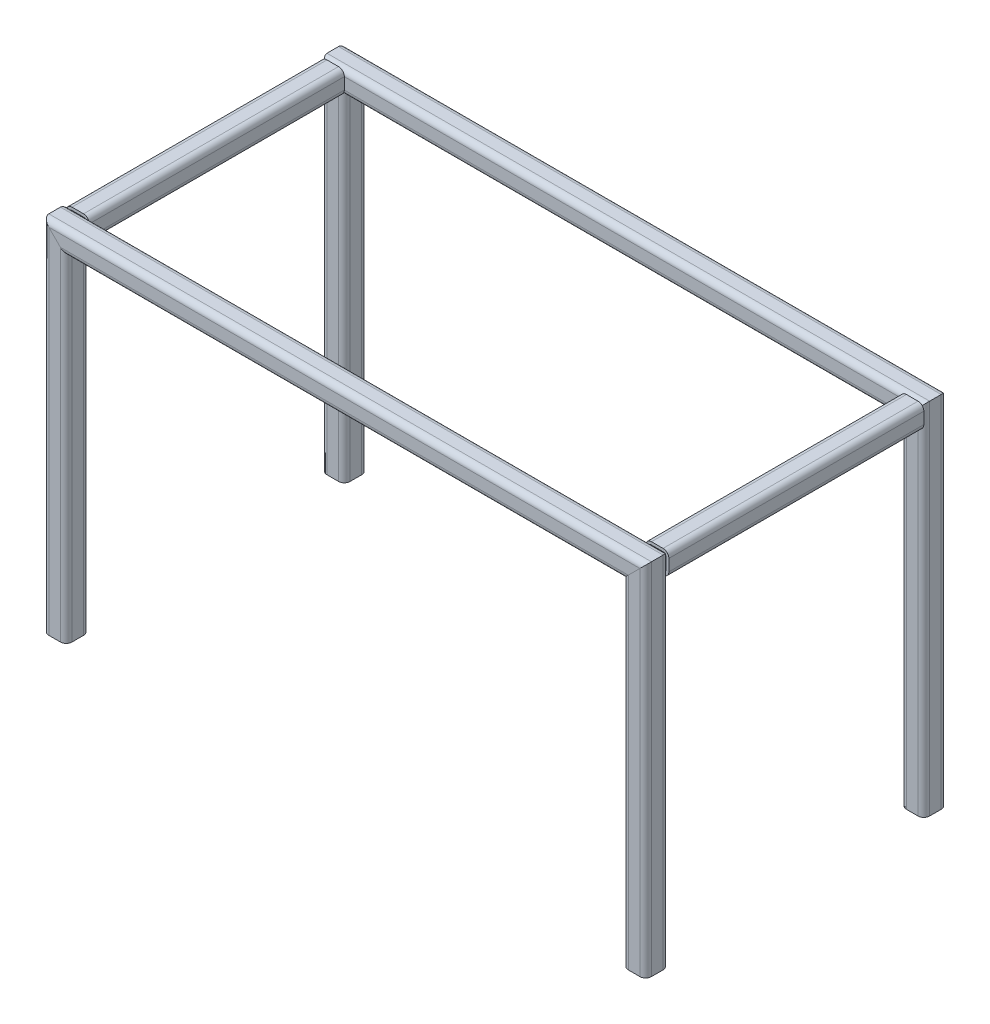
ISO-10303-21;
HEADER;
FILE_DESCRIPTION(('STEP AP214'),'2;1');
FILE_NAME('part.step','',(''),(''),'','','');
FILE_SCHEMA(('AUTOMOTIVE_DESIGN { 1 0 10303 214 1 1 1 1 }'));
ENDSEC;
DATA;
#1=APPLICATION_CONTEXT('core data for automotive mechanical design processes');
#2=APPLICATION_PROTOCOL_DEFINITION('international standard','automotive_design',2000,#1);
#3=PRODUCT_CONTEXT('',#1,'mechanical');
#4=PRODUCT('Part','Part','',(#3));
#5=PRODUCT_RELATED_PRODUCT_CATEGORY('part','',(#4));
#6=PRODUCT_DEFINITION_FORMATION('','',#4);
#7=PRODUCT_DEFINITION_CONTEXT('part definition',#1,'design');
#8=PRODUCT_DEFINITION('design','',#6,#7);
#9=PRODUCT_DEFINITION_SHAPE('','',#8);
#10=(LENGTH_UNIT() NAMED_UNIT(*) SI_UNIT(.MILLI.,.METRE.));
#11=(NAMED_UNIT(*) PLANE_ANGLE_UNIT() SI_UNIT($,.RADIAN.));
#12=(NAMED_UNIT(*) SI_UNIT($,.STERADIAN.) SOLID_ANGLE_UNIT());
#13=UNCERTAINTY_MEASURE_WITH_UNIT(LENGTH_MEASURE(1.E-05),#10,'distance_accuracy_value','');
#14=(GEOMETRIC_REPRESENTATION_CONTEXT(3) GLOBAL_UNCERTAINTY_ASSIGNED_CONTEXT((#13)) GLOBAL_UNIT_ASSIGNED_CONTEXT((#10,
#11,#12)) REPRESENTATION_CONTEXT('',''));
#15=CARTESIAN_POINT('',(0.,0.,0.));
#16=DIRECTION('',(0.,0.,1.));
#17=DIRECTION('',(1.,0.,0.));
#18=AXIS2_PLACEMENT_3D('',#15,#16,#17);
#19=CARTESIAN_POINT('',(1289.05,762.000000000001,-622.3));
#20=DIRECTION('',(-1.,0.,0.));
#21=DIRECTION('',(0.,0.,1.));
#22=AXIS2_PLACEMENT_3D('',#19,#20,#21);
#23=PLANE('',#22);
#24=DIRECTION('',(0.,0.,1.));
#25=VECTOR('',#24,1.);
#26=CARTESIAN_POINT('',(1289.05,781.05,-622.3));
#27=LINE('',#26,#25);
#28=CARTESIAN_POINT('',(1289.05,781.05,-622.3));
#29=VERTEX_POINT('',#28);
#30=CARTESIAN_POINT('',(1289.05,781.05,-596.899999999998));
#31=VERTEX_POINT('',#30);
#32=EDGE_CURVE('E13',#29,#31,#27,.T.);
#33=ORIENTED_EDGE('',*,*,#32,.F.);
#34=DIRECTION('',(0.,-1.,0.));
#35=VECTOR('',#34,1.);
#36=CARTESIAN_POINT('',(1289.05,762.000000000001,-622.3));
#37=LINE('',#36,#35);
#38=CARTESIAN_POINT('',(1289.05,-6.10622663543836E-13,-622.3));
#39=VERTEX_POINT('',#38);
#40=EDGE_CURVE('E681',#29,#39,#37,.T.);
#41=ORIENTED_EDGE('',*,*,#40,.T.);
#42=DIRECTION('',(0.,0.,-1.));
#43=VECTOR('',#42,1.);
#44=CARTESIAN_POINT('',(1289.05,-6.10622663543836E-13,-622.3));
#45=LINE('',#44,#43);
#46=CARTESIAN_POINT('',(1289.05,-6.10622663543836E-13,-596.9));
#47=VERTEX_POINT('',#46);
#48=EDGE_CURVE('E624',#47,#39,#45,.T.);
#49=ORIENTED_EDGE('',*,*,#48,.F.);
#50=DIRECTION('',(0.,-1.,0.));
#51=VECTOR('',#50,1.);
#52=CARTESIAN_POINT('',(1289.05,762.000000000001,-596.9));
#53=LINE('',#52,#51);
#54=EDGE_CURVE('E615',#31,#47,#53,.T.);
#55=ORIENTED_EDGE('',*,*,#54,.F.);
#56=EDGE_LOOP('',(#33,#41,#49,#55));
#57=FACE_BOUND('',#56,.T.);
#58=ADVANCED_FACE('F483',(#57),#23,.T.);
#59=CARTESIAN_POINT('',(1282.7,762.000000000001,-622.3));
#60=DIRECTION('',(0.,-1.,0.));
#61=DIRECTION('',(0.,0.,-1.));
#62=AXIS2_PLACEMENT_3D('',#59,#60,#61);
#63=CYLINDRICAL_SURFACE('',#62,6.35);
#64=CARTESIAN_POINT('',(1282.7,774.7,-622.3));
#65=DIRECTION('',(0.707106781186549,-0.707106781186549,0.));
#66=DIRECTION('',(-0.707106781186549,-0.707106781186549,0.));
#67=AXIS2_PLACEMENT_3D('',#64,#65,#66);
#68=ELLIPSE('',#67,8.98025612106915,6.35);
#69=CARTESIAN_POINT('',(1282.7,774.7,-628.65));
#70=VERTEX_POINT('',#69);
#71=EDGE_CURVE('E633',#70,#29,#68,.T.);
#72=ORIENTED_EDGE('',*,*,#71,.F.);
#73=DIRECTION('',(0.,-1.,0.));
#74=VECTOR('',#73,1.);
#75=CARTESIAN_POINT('',(1282.7,762.000000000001,-628.65));
#76=LINE('',#75,#74);
#77=CARTESIAN_POINT('',(1282.7,-5.55111512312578E-13,-628.65));
#78=VERTEX_POINT('',#77);
#79=EDGE_CURVE('E683',#70,#78,#76,.T.);
#80=ORIENTED_EDGE('',*,*,#79,.T.);
#81=CARTESIAN_POINT('',(1282.7,-4.44089209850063E-13,-622.3));
#82=DIRECTION('',(0.,1.,0.));
#83=DIRECTION('',(0.,0.,1.));
#84=AXIS2_PLACEMENT_3D('',#81,#82,#83);
#85=CIRCLE('',#84,6.35);
#86=EDGE_CURVE('E645',#39,#78,#85,.T.);
#87=ORIENTED_EDGE('',*,*,#86,.F.);
#88=ORIENTED_EDGE('',*,*,#40,.F.);
#89=EDGE_LOOP('',(#72,#80,#87,#88));
#90=FACE_BOUND('',#89,.T.);
#91=ADVANCED_FACE('F761',(#90),#63,.F.);
#92=CARTESIAN_POINT('',(1282.7,762.000000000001,-628.65));
#93=DIRECTION('',(0.,0.,1.));
#94=DIRECTION('',(0.,-1.,0.));
#95=AXIS2_PLACEMENT_3D('',#92,#93,#94);
#96=PLANE('',#95);
#97=DIRECTION('',(0.707106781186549,0.707106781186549,0.));
#98=VECTOR('',#97,1.);
#99=CARTESIAN_POINT('',(1276.35,768.35,-628.65));
#100=LINE('',#99,#98);
#101=CARTESIAN_POINT('',(1257.3,749.300000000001,-628.65));
#102=VERTEX_POINT('',#101);
#103=EDGE_CURVE('E531',#102,#70,#100,.T.);
#104=ORIENTED_EDGE('',*,*,#103,.F.);
#105=DIRECTION('',(0.,-1.,0.));
#106=VECTOR('',#105,1.);
#107=CARTESIAN_POINT('',(1257.3,762.000000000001,-628.65));
#108=LINE('',#107,#106);
#109=CARTESIAN_POINT('',(1257.3,-5.55111512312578E-13,-628.65));
#110=VERTEX_POINT('',#109);
#111=EDGE_CURVE('E685',#102,#110,#108,.T.);
#112=ORIENTED_EDGE('',*,*,#111,.T.);
#113=DIRECTION('',(-1.,0.,0.));
#114=VECTOR('',#113,1.);
#115=CARTESIAN_POINT('',(1282.7,-5.55111512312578E-13,-628.65));
#116=LINE('',#115,#114);
#117=EDGE_CURVE('E642',#78,#110,#116,.T.);
#118=ORIENTED_EDGE('',*,*,#117,.F.);
#119=ORIENTED_EDGE('',*,*,#79,.F.);
#120=EDGE_LOOP('',(#104,#112,#118,#119));
#121=FACE_BOUND('',#120,.T.);
#122=ADVANCED_FACE('F767',(#121),#96,.T.);
#123=CARTESIAN_POINT('',(1257.3,762.000000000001,-622.3));
#124=DIRECTION('',(0.,-1.,0.));
#125=DIRECTION('',(0.,0.,-1.));
#126=AXIS2_PLACEMENT_3D('',#123,#124,#125);
#127=CYLINDRICAL_SURFACE('',#126,6.35);
#128=CARTESIAN_POINT('',(1257.3,749.300000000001,-622.3));
#129=DIRECTION('',(0.707106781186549,-0.707106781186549,0.));
#130=DIRECTION('',(-0.707106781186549,-0.707106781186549,0.));
#131=AXIS2_PLACEMENT_3D('',#128,#129,#130);
#132=ELLIPSE('',#131,8.98025612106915,6.35);
#133=CARTESIAN_POINT('',(1250.95,742.950000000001,-622.3));
#134=VERTEX_POINT('',#133);
#135=EDGE_CURVE('E721',#134,#102,#132,.T.);
#136=ORIENTED_EDGE('',*,*,#135,.F.);
#137=DIRECTION('',(0.,-1.,0.));
#138=VECTOR('',#137,1.);
#139=CARTESIAN_POINT('',(1250.95,762.000000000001,-622.3));
#140=LINE('',#139,#138);
#141=CARTESIAN_POINT('',(1250.95,-6.66133814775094E-13,-622.3));
#142=VERTEX_POINT('',#141);
#143=EDGE_CURVE('E687',#134,#142,#140,.T.);
#144=ORIENTED_EDGE('',*,*,#143,.T.);
#145=CARTESIAN_POINT('',(1257.3,-4.9960036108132E-13,-622.3));
#146=DIRECTION('',(0.,1.,0.));
#147=DIRECTION('',(0.,0.,1.));
#148=AXIS2_PLACEMENT_3D('',#145,#146,#147);
#149=CIRCLE('',#148,6.35);
#150=EDGE_CURVE('E639',#110,#142,#149,.T.);
#151=ORIENTED_EDGE('',*,*,#150,.F.);
#152=ORIENTED_EDGE('',*,*,#111,.F.);
#153=EDGE_LOOP('',(#136,#144,#151,#152));
#154=FACE_BOUND('',#153,.T.);
#155=ADVANCED_FACE('F776',(#154),#127,.F.);
#156=CARTESIAN_POINT('',(1250.95,762.000000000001,-596.9));
#157=DIRECTION('',(1.,0.,0.));
#158=DIRECTION('',(0.,0.,-1.));
#159=AXIS2_PLACEMENT_3D('',#156,#157,#158);
#160=PLANE('',#159);
#161=DIRECTION('',(0.,0.,-1.));
#162=VECTOR('',#161,1.);
#163=CARTESIAN_POINT('',(1250.95,742.95,-596.9));
#164=LINE('',#163,#162);
#165=CARTESIAN_POINT('',(1250.95,742.95,-596.899999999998));
#166=VERTEX_POINT('',#165);
#167=EDGE_CURVE('E723',#166,#134,#164,.T.);
#168=ORIENTED_EDGE('',*,*,#167,.F.);
#169=DIRECTION('',(0.,-1.,0.));
#170=VECTOR('',#169,1.);
#171=CARTESIAN_POINT('',(1250.95,762.000000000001,-596.9));
#172=LINE('',#171,#170);
#173=CARTESIAN_POINT('',(1250.95,-4.9960036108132E-13,-596.9));
#174=VERTEX_POINT('',#173);
#175=EDGE_CURVE('E689',#166,#174,#172,.T.);
#176=ORIENTED_EDGE('',*,*,#175,.T.);
#177=DIRECTION('',(0.,0.,1.));
#178=VECTOR('',#177,1.);
#179=CARTESIAN_POINT('',(1250.95,-4.9960036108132E-13,-596.9));
#180=LINE('',#179,#178);
#181=EDGE_CURVE('E634',#142,#174,#180,.T.);
#182=ORIENTED_EDGE('',*,*,#181,.F.);
#183=ORIENTED_EDGE('',*,*,#143,.F.);
#184=EDGE_LOOP('',(#168,#176,#182,#183));
#185=FACE_BOUND('',#184,.T.);
#186=ADVANCED_FACE('F780',(#185),#160,.T.);
#187=CARTESIAN_POINT('',(1257.3,762.000000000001,-596.9));
#188=DIRECTION('',(0.,-1.,0.));
#189=DIRECTION('',(0.,0.,-1.));
#190=AXIS2_PLACEMENT_3D('',#187,#188,#189);
#191=CYLINDRICAL_SURFACE('',#190,6.35);
#192=CARTESIAN_POINT('',(1257.3,749.300000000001,-596.9));
#193=DIRECTION('',(0.707106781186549,-0.707106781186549,0.));
#194=DIRECTION('',(-0.707106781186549,-0.707106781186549,0.));
#195=AXIS2_PLACEMENT_3D('',#192,#193,#194);
#196=ELLIPSE('',#195,8.98025612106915,6.35);
#197=CARTESIAN_POINT('',(1257.3,749.3,-590.55));
#198=VERTEX_POINT('',#197);
#199=EDGE_CURVE('E725',#198,#166,#196,.T.);
#200=ORIENTED_EDGE('',*,*,#199,.F.);
#201=DIRECTION('',(0.,-1.,0.));
#202=VECTOR('',#201,1.);
#203=CARTESIAN_POINT('',(1257.3,762.000000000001,-590.55));
#204=LINE('',#203,#202);
#205=CARTESIAN_POINT('',(1257.3,-6.66133814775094E-13,-590.55));
#206=VERTEX_POINT('',#205);
#207=EDGE_CURVE('E614',#198,#206,#204,.T.);
#208=ORIENTED_EDGE('',*,*,#207,.T.);
#209=CARTESIAN_POINT('',(1257.3,-5.55111512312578E-13,-596.9));
#210=DIRECTION('',(0.,1.,0.));
#211=DIRECTION('',(0.,0.,1.));
#212=AXIS2_PLACEMENT_3D('',#209,#210,#211);
#213=CIRCLE('',#212,6.35);
#214=EDGE_CURVE('E631',#174,#206,#213,.T.);
#215=ORIENTED_EDGE('',*,*,#214,.F.);
#216=ORIENTED_EDGE('',*,*,#175,.F.);
#217=EDGE_LOOP('',(#200,#208,#215,#216));
#218=FACE_BOUND('',#217,.T.);
#219=ADVANCED_FACE('F784',(#218),#191,.F.);
#220=CARTESIAN_POINT('',(1257.3,762.000000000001,-590.55));
#221=DIRECTION('',(0.,0.,-1.));
#222=DIRECTION('',(0.,1.,0.));
#223=AXIS2_PLACEMENT_3D('',#220,#221,#222);
#224=PLANE('',#223);
#225=DIRECTION('',(-0.707106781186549,-0.707106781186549,0.));
#226=VECTOR('',#225,1.);
#227=CARTESIAN_POINT('',(1263.65,755.650000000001,-590.55));
#228=LINE('',#227,#226);
#229=CARTESIAN_POINT('',(1282.7,774.700000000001,-590.55));
#230=VERTEX_POINT('',#229);
#231=EDGE_CURVE('E611',#230,#198,#228,.T.);
#232=ORIENTED_EDGE('',*,*,#231,.F.);
#233=DIRECTION('',(0.,-1.,0.));
#234=VECTOR('',#233,1.);
#235=CARTESIAN_POINT('',(1282.7,762.000000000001,-590.55));
#236=LINE('',#235,#234);
#237=CARTESIAN_POINT('',(1282.7,-7.7715611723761E-13,-590.55));
#238=VERTEX_POINT('',#237);
#239=EDGE_CURVE('E604',#230,#238,#236,.T.);
#240=ORIENTED_EDGE('',*,*,#239,.T.);
#241=DIRECTION('',(1.,0.,0.));
#242=VECTOR('',#241,1.);
#243=CARTESIAN_POINT('',(1257.3,-6.66133814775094E-13,-590.55));
#244=LINE('',#243,#242);
#245=EDGE_CURVE('E609',#206,#238,#244,.T.);
#246=ORIENTED_EDGE('',*,*,#245,.F.);
#247=ORIENTED_EDGE('',*,*,#207,.F.);
#248=EDGE_LOOP('',(#232,#240,#246,#247));
#249=FACE_BOUND('',#248,.T.);
#250=ADVANCED_FACE('F606',(#249),#224,.T.);
#251=CARTESIAN_POINT('',(1282.7,762.000000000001,-596.9));
#252=DIRECTION('',(0.,-1.,0.));
#253=DIRECTION('',(0.,0.,-1.));
#254=AXIS2_PLACEMENT_3D('',#251,#252,#253);
#255=CYLINDRICAL_SURFACE('',#254,6.35);
#256=CARTESIAN_POINT('',(1282.7,774.7,-596.9));
#257=DIRECTION('',(0.707106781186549,-0.707106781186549,0.));
#258=DIRECTION('',(-0.707106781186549,-0.707106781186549,0.));
#259=AXIS2_PLACEMENT_3D('',#256,#257,#258);
#260=ELLIPSE('',#259,8.98025612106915,6.35);
#261=EDGE_CURVE('E727',#31,#230,#260,.T.);
#262=ORIENTED_EDGE('',*,*,#261,.F.);
#263=ORIENTED_EDGE('',*,*,#54,.T.);
#264=CARTESIAN_POINT('',(1282.7,-8.88178419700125E-13,-596.9));
#265=DIRECTION('',(0.,1.,0.));
#266=DIRECTION('',(0.,0.,1.));
#267=AXIS2_PLACEMENT_3D('',#264,#265,#266);
#268=CIRCLE('',#267,6.35);
#269=EDGE_CURVE('E618',#238,#47,#268,.T.);
#270=ORIENTED_EDGE('',*,*,#269,.F.);
#271=ORIENTED_EDGE('',*,*,#239,.F.);
#272=EDGE_LOOP('',(#262,#263,#270,#271));
#273=FACE_BOUND('',#272,.T.);
#274=ADVANCED_FACE('F619',(#273),#255,.F.);
#275=CARTESIAN_POINT('',(1257.3,-5.55111512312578E-13,-596.9));
#276=DIRECTION('',(0.,1.,0.));
#277=DIRECTION('',(0.,0.,1.));
#278=AXIS2_PLACEMENT_3D('',#275,#276,#277);
#279=PLANE('',#278);
#280=ORIENTED_EDGE('',*,*,#269,.T.);
#281=ORIENTED_EDGE('',*,*,#48,.T.);
#282=ORIENTED_EDGE('',*,*,#86,.T.);
#283=ORIENTED_EDGE('',*,*,#117,.T.);
#284=ORIENTED_EDGE('',*,*,#150,.T.);
#285=ORIENTED_EDGE('',*,*,#181,.T.);
#286=ORIENTED_EDGE('',*,*,#214,.T.);
#287=ORIENTED_EDGE('',*,*,#245,.T.);
#288=EDGE_LOOP('',(#280,#281,#282,#283,#284,#285,#286,#287));
#289=FACE_BOUND('',#288,.T.);
#290=CARTESIAN_POINT('',(1257.3,-5.55111512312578E-13,-596.9));
#291=DIRECTION('',(0.,1.,0.));
#292=DIRECTION('',(0.,0.,1.));
#293=AXIS2_PLACEMENT_3D('',#290,#291,#292);
#294=CIRCLE('',#293,12.7);
#295=CARTESIAN_POINT('',(1244.6,-7.21644966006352E-13,-596.9));
#296=VERTEX_POINT('',#295);
#297=CARTESIAN_POINT('',(1257.3,-4.44089209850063E-13,-584.2));
#298=VERTEX_POINT('',#297);
#299=EDGE_CURVE('E649',#296,#298,#294,.T.);
#300=ORIENTED_EDGE('',*,*,#299,.F.);
#301=DIRECTION('',(0.,0.,1.));
#302=VECTOR('',#301,1.);
#303=CARTESIAN_POINT('',(1244.6,-7.21644966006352E-13,-596.9));
#304=LINE('',#303,#302);
#305=CARTESIAN_POINT('',(1244.6,-3.33066907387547E-13,-622.3));
#306=VERTEX_POINT('',#305);
#307=EDGE_CURVE('E625',#306,#296,#304,.T.);
#308=ORIENTED_EDGE('',*,*,#307,.F.);
#309=CARTESIAN_POINT('',(1257.3,-4.9960036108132E-13,-622.3));
#310=DIRECTION('',(0.,1.,0.));
#311=DIRECTION('',(0.,0.,1.));
#312=AXIS2_PLACEMENT_3D('',#309,#310,#311);
#313=CIRCLE('',#312,12.7);
#314=CARTESIAN_POINT('',(1257.3,-8.32667268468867E-13,-635.));
#315=VERTEX_POINT('',#314);
#316=EDGE_CURVE('E674',#315,#306,#313,.T.);
#317=ORIENTED_EDGE('',*,*,#316,.F.);
#318=DIRECTION('',(-1.,0.,0.));
#319=VECTOR('',#318,1.);
#320=CARTESIAN_POINT('',(1282.7,-9.43689570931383E-13,-635.));
#321=LINE('',#320,#319);
#322=CARTESIAN_POINT('',(1282.7,-9.43689570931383E-13,-635.));
#323=VERTEX_POINT('',#322);
#324=EDGE_CURVE('E670',#323,#315,#321,.T.);
#325=ORIENTED_EDGE('',*,*,#324,.F.);
#326=CARTESIAN_POINT('',(1282.7,-4.44089209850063E-13,-622.3));
#327=DIRECTION('',(0.,1.,0.));
#328=DIRECTION('',(0.,0.,1.));
#329=AXIS2_PLACEMENT_3D('',#326,#327,#328);
#330=CIRCLE('',#329,12.7);
#331=CARTESIAN_POINT('',(1295.4,-1.66533453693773E-13,-622.3));
#332=VERTEX_POINT('',#331);
#333=EDGE_CURVE('E666',#332,#323,#330,.T.);
#334=ORIENTED_EDGE('',*,*,#333,.F.);
#335=DIRECTION('',(0.,0.,-1.));
#336=VECTOR('',#335,1.);
#337=CARTESIAN_POINT('',(1295.4,-1.66533453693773E-13,-622.3));
#338=LINE('',#337,#336);
#339=CARTESIAN_POINT('',(1295.4,-3.88578058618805E-13,-596.9));
#340=VERTEX_POINT('',#339);
#341=EDGE_CURVE('E662',#340,#332,#338,.T.);
#342=ORIENTED_EDGE('',*,*,#341,.F.);
#343=CARTESIAN_POINT('',(1282.7,-8.88178419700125E-13,-596.9));
#344=DIRECTION('',(0.,1.,0.));
#345=DIRECTION('',(0.,0.,1.));
#346=AXIS2_PLACEMENT_3D('',#343,#344,#345);
#347=CIRCLE('',#346,12.7);
#348=CARTESIAN_POINT('',(1282.7,-7.21644966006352E-13,-584.2));
#349=VERTEX_POINT('',#348);
#350=EDGE_CURVE('E658',#349,#340,#347,.T.);
#351=ORIENTED_EDGE('',*,*,#350,.F.);
#352=DIRECTION('',(1.,0.,0.));
#353=VECTOR('',#352,1.);
#354=CARTESIAN_POINT('',(1257.3,-4.44089209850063E-13,-584.2));
#355=LINE('',#354,#353);
#356=EDGE_CURVE('E654',#298,#349,#355,.T.);
#357=ORIENTED_EDGE('',*,*,#356,.F.);
#358=EDGE_LOOP('',(#300,#308,#317,#325,#334,#342,#351,#357));
#359=FACE_BOUND('',#358,.T.);
#360=ADVANCED_FACE('F627',(#289,#359),#279,.F.);
#361=CARTESIAN_POINT('',(1244.6,762.000000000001,-596.9));
#362=DIRECTION('',(1.,0.,0.));
#363=DIRECTION('',(0.,0.,-1.));
#364=AXIS2_PLACEMENT_3D('',#361,#362,#363);
#365=PLANE('',#364);
#366=DIRECTION('',(0.,-1.,0.));
#367=VECTOR('',#366,1.);
#368=CARTESIAN_POINT('',(1244.6,762.000000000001,-596.9));
#369=LINE('',#368,#367);
#370=CARTESIAN_POINT('',(1244.6,736.6,-596.899999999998));
#371=VERTEX_POINT('',#370);
#372=EDGE_CURVE('E653',#371,#296,#369,.T.);
#373=ORIENTED_EDGE('',*,*,#372,.F.);
#374=DIRECTION('',(0.,0.,-1.));
#375=VECTOR('',#374,1.);
#376=CARTESIAN_POINT('',(1244.6,736.6,-596.9));
#377=LINE('',#376,#375);
#378=CARTESIAN_POINT('',(1244.6,736.6,-622.3));
#379=VERTEX_POINT('',#378);
#380=EDGE_CURVE('E487',#371,#379,#377,.T.);
#381=ORIENTED_EDGE('',*,*,#380,.T.);
#382=DIRECTION('',(0.,-1.,0.));
#383=VECTOR('',#382,1.);
#384=CARTESIAN_POINT('',(1244.6,762.000000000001,-622.3));
#385=LINE('',#384,#383);
#386=EDGE_CURVE('E679',#379,#306,#385,.T.);
#387=ORIENTED_EDGE('',*,*,#386,.T.);
#388=ORIENTED_EDGE('',*,*,#307,.T.);
#389=EDGE_LOOP('',(#373,#381,#387,#388));
#390=FACE_BOUND('',#389,.T.);
#391=ADVANCED_FACE('F703',(#390),#365,.F.);
#392=CARTESIAN_POINT('',(1257.3,762.000000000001,-622.3));
#393=DIRECTION('',(0.,-1.,0.));
#394=DIRECTION('',(0.,0.,-1.));
#395=AXIS2_PLACEMENT_3D('',#392,#393,#394);
#396=CYLINDRICAL_SURFACE('',#395,12.7);
#397=ORIENTED_EDGE('',*,*,#386,.F.);
#398=CARTESIAN_POINT('',(1257.3,749.300000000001,-622.3));
#399=DIRECTION('',(0.707106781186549,-0.707106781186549,0.));
#400=DIRECTION('',(-0.707106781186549,-0.707106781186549,0.));
#401=AXIS2_PLACEMENT_3D('',#398,#399,#400);
#402=ELLIPSE('',#401,17.9605122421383,12.7);
#403=CARTESIAN_POINT('',(1257.3,749.300000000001,-635.));
#404=VERTEX_POINT('',#403);
#405=EDGE_CURVE('E728',#379,#404,#402,.T.);
#406=ORIENTED_EDGE('',*,*,#405,.T.);
#407=DIRECTION('',(0.,-1.,0.));
#408=VECTOR('',#407,1.);
#409=CARTESIAN_POINT('',(1257.3,762.000000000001,-635.));
#410=LINE('',#409,#408);
#411=EDGE_CURVE('E673',#404,#315,#410,.T.);
#412=ORIENTED_EDGE('',*,*,#411,.T.);
#413=ORIENTED_EDGE('',*,*,#316,.T.);
#414=EDGE_LOOP('',(#397,#406,#412,#413));
#415=FACE_BOUND('',#414,.T.);
#416=ADVANCED_FACE('F751',(#415),#396,.T.);
#417=CARTESIAN_POINT('',(1282.7,762.000000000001,-635.));
#418=DIRECTION('',(0.,0.,1.));
#419=DIRECTION('',(0.,-1.,0.));
#420=AXIS2_PLACEMENT_3D('',#417,#418,#419);
#421=PLANE('',#420);
#422=ORIENTED_EDGE('',*,*,#411,.F.);
#423=DIRECTION('',(0.707106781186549,0.707106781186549,0.));
#424=VECTOR('',#423,1.);
#425=CARTESIAN_POINT('',(1276.35,768.35,-635.));
#426=LINE('',#425,#424);
#427=CARTESIAN_POINT('',(1282.7,774.7,-635.));
#428=VERTEX_POINT('',#427);
#429=EDGE_CURVE('E518',#404,#428,#426,.T.);
#430=ORIENTED_EDGE('',*,*,#429,.T.);
#431=DIRECTION('',(0.,-1.,0.));
#432=VECTOR('',#431,1.);
#433=CARTESIAN_POINT('',(1282.7,762.000000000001,-635.));
#434=LINE('',#433,#432);
#435=EDGE_CURVE('E669',#428,#323,#434,.T.);
#436=ORIENTED_EDGE('',*,*,#435,.T.);
#437=ORIENTED_EDGE('',*,*,#324,.T.);
#438=EDGE_LOOP('',(#422,#430,#436,#437));
#439=FACE_BOUND('',#438,.T.);
#440=ADVANCED_FACE('F750',(#439),#421,.F.);
#441=CARTESIAN_POINT('',(1282.7,762.000000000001,-622.3));
#442=DIRECTION('',(0.,-1.,0.));
#443=DIRECTION('',(0.,0.,-1.));
#444=AXIS2_PLACEMENT_3D('',#441,#442,#443);
#445=CYLINDRICAL_SURFACE('',#444,12.7);
#446=ORIENTED_EDGE('',*,*,#435,.F.);
#447=CARTESIAN_POINT('',(1282.7,774.7,-622.3));
#448=DIRECTION('',(0.707106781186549,-0.707106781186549,0.));
#449=DIRECTION('',(-0.707106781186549,-0.707106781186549,0.));
#450=AXIS2_PLACEMENT_3D('',#447,#448,#449);
#451=ELLIPSE('',#450,17.9605122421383,12.7);
#452=CARTESIAN_POINT('',(1295.4,787.400000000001,-622.3));
#453=VERTEX_POINT('',#452);
#454=EDGE_CURVE('E732',#428,#453,#451,.T.);
#455=ORIENTED_EDGE('',*,*,#454,.T.);
#456=DIRECTION('',(0.,-1.,0.));
#457=VECTOR('',#456,1.);
#458=CARTESIAN_POINT('',(1295.4,762.000000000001,-622.3));
#459=LINE('',#458,#457);
#460=EDGE_CURVE('E665',#453,#332,#459,.T.);
#461=ORIENTED_EDGE('',*,*,#460,.T.);
#462=ORIENTED_EDGE('',*,*,#333,.T.);
#463=EDGE_LOOP('',(#446,#455,#461,#462));
#464=FACE_BOUND('',#463,.T.);
#465=ADVANCED_FACE('F748',(#464),#445,.T.);
#466=CARTESIAN_POINT('',(1295.4,762.000000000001,-622.3));
#467=DIRECTION('',(-1.,0.,0.));
#468=DIRECTION('',(0.,0.,1.));
#469=AXIS2_PLACEMENT_3D('',#466,#467,#468);
#470=PLANE('',#469);
#471=ORIENTED_EDGE('',*,*,#460,.F.);
#472=DIRECTION('',(0.,0.,1.));
#473=VECTOR('',#472,1.);
#474=CARTESIAN_POINT('',(1295.4,787.400000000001,-622.3));
#475=LINE('',#474,#473);
#476=CARTESIAN_POINT('',(1295.4,787.400000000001,-596.899999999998));
#477=VERTEX_POINT('',#476);
#478=EDGE_CURVE('E715',#453,#477,#475,.T.);
#479=ORIENTED_EDGE('',*,*,#478,.T.);
#480=DIRECTION('',(0.,-1.,0.));
#481=VECTOR('',#480,1.);
#482=CARTESIAN_POINT('',(1295.4,762.000000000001,-596.9));
#483=LINE('',#482,#481);
#484=EDGE_CURVE('E661',#477,#340,#483,.T.);
#485=ORIENTED_EDGE('',*,*,#484,.T.);
#486=ORIENTED_EDGE('',*,*,#341,.T.);
#487=EDGE_LOOP('',(#471,#479,#485,#486));
#488=FACE_BOUND('',#487,.T.);
#489=ADVANCED_FACE('F739',(#488),#470,.F.);
#490=CARTESIAN_POINT('',(1282.7,762.000000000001,-596.9));
#491=DIRECTION('',(0.,-1.,0.));
#492=DIRECTION('',(0.,0.,-1.));
#493=AXIS2_PLACEMENT_3D('',#490,#491,#492);
#494=CYLINDRICAL_SURFACE('',#493,12.7);
#495=ORIENTED_EDGE('',*,*,#484,.F.);
#496=CARTESIAN_POINT('',(1282.7,774.7,-596.9));
#497=DIRECTION('',(0.707106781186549,-0.707106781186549,0.));
#498=DIRECTION('',(-0.707106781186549,-0.707106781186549,0.));
#499=AXIS2_PLACEMENT_3D('',#496,#497,#498);
#500=ELLIPSE('',#499,17.9605122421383,12.7);
#501=CARTESIAN_POINT('',(1282.7,774.7,-584.2));
#502=VERTEX_POINT('',#501);
#503=EDGE_CURVE('E712',#477,#502,#500,.T.);
#504=ORIENTED_EDGE('',*,*,#503,.T.);
#505=DIRECTION('',(0.,-1.,0.));
#506=VECTOR('',#505,1.);
#507=CARTESIAN_POINT('',(1282.7,762.000000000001,-584.2));
#508=LINE('',#507,#506);
#509=EDGE_CURVE('E657',#502,#349,#508,.T.);
#510=ORIENTED_EDGE('',*,*,#509,.T.);
#511=ORIENTED_EDGE('',*,*,#350,.T.);
#512=EDGE_LOOP('',(#495,#504,#510,#511));
#513=FACE_BOUND('',#512,.T.);
#514=ADVANCED_FACE('F744',(#513),#494,.T.);
#515=CARTESIAN_POINT('',(1257.3,762.000000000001,-584.2));
#516=DIRECTION('',(0.,0.,-1.));
#517=DIRECTION('',(0.,1.,0.));
#518=AXIS2_PLACEMENT_3D('',#515,#516,#517);
#519=PLANE('',#518);
#520=ORIENTED_EDGE('',*,*,#509,.F.);
#521=DIRECTION('',(-0.707106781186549,-0.707106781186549,0.));
#522=VECTOR('',#521,1.);
#523=CARTESIAN_POINT('',(1263.65,755.650000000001,-584.2));
#524=LINE('',#523,#522);
#525=CARTESIAN_POINT('',(1257.3,749.300000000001,-584.2));
#526=VERTEX_POINT('',#525);
#527=EDGE_CURVE('E502',#502,#526,#524,.T.);
#528=ORIENTED_EDGE('',*,*,#527,.T.);
#529=DIRECTION('',(0.,-1.,0.));
#530=VECTOR('',#529,1.);
#531=CARTESIAN_POINT('',(1257.3,762.000000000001,-584.2));
#532=LINE('',#531,#530);
#533=EDGE_CURVE('E652',#526,#298,#532,.T.);
#534=ORIENTED_EDGE('',*,*,#533,.T.);
#535=ORIENTED_EDGE('',*,*,#356,.T.);
#536=EDGE_LOOP('',(#520,#528,#534,#535));
#537=FACE_BOUND('',#536,.T.);
#538=ADVANCED_FACE('F710',(#537),#519,.F.);
#539=CARTESIAN_POINT('',(1257.3,762.000000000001,-596.9));
#540=DIRECTION('',(0.,-1.,0.));
#541=DIRECTION('',(0.,0.,-1.));
#542=AXIS2_PLACEMENT_3D('',#539,#540,#541);
#543=CYLINDRICAL_SURFACE('',#542,12.7);
#544=ORIENTED_EDGE('',*,*,#533,.F.);
#545=CARTESIAN_POINT('',(1257.3,749.300000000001,-596.9));
#546=DIRECTION('',(0.707106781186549,-0.707106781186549,0.));
#547=DIRECTION('',(-0.707106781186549,-0.707106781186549,0.));
#548=AXIS2_PLACEMENT_3D('',#545,#546,#547);
#549=ELLIPSE('',#548,17.9605122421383,12.7);
#550=EDGE_CURVE('E493',#526,#371,#549,.T.);
#551=ORIENTED_EDGE('',*,*,#550,.T.);
#552=ORIENTED_EDGE('',*,*,#372,.T.);
#553=ORIENTED_EDGE('',*,*,#299,.T.);
#554=EDGE_LOOP('',(#544,#551,#552,#553));
#555=FACE_BOUND('',#554,.T.);
#556=ADVANCED_FACE('F485',(#555),#543,.T.);
#557=CARTESIAN_POINT('',(1270.,762.,-609.6));
#558=DIRECTION('',(0.707106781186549,-0.707106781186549,0.));
#559=DIRECTION('',(0.707106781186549,0.707106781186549,0.));
#560=AXIS2_PLACEMENT_3D('',#557,#558,#559);
#561=PLANE('',#560);
#562=ORIENTED_EDGE('',*,*,#261,.T.);
#563=ORIENTED_EDGE('',*,*,#231,.T.);
#564=ORIENTED_EDGE('',*,*,#199,.T.);
#565=ORIENTED_EDGE('',*,*,#167,.T.);
#566=ORIENTED_EDGE('',*,*,#135,.T.);
#567=ORIENTED_EDGE('',*,*,#103,.T.);
#568=ORIENTED_EDGE('',*,*,#71,.T.);
#569=ORIENTED_EDGE('',*,*,#32,.T.);
#570=EDGE_LOOP('',(#562,#563,#564,#565,#566,#567,#568,#569));
#571=FACE_BOUND('',#570,.T.);
#572=ORIENTED_EDGE('',*,*,#527,.F.);
#573=ORIENTED_EDGE('',*,*,#503,.F.);
#574=ORIENTED_EDGE('',*,*,#478,.F.);
#575=ORIENTED_EDGE('',*,*,#454,.F.);
#576=ORIENTED_EDGE('',*,*,#429,.F.);
#577=ORIENTED_EDGE('',*,*,#405,.F.);
#578=ORIENTED_EDGE('',*,*,#380,.F.);
#579=ORIENTED_EDGE('',*,*,#550,.F.);
#580=EDGE_LOOP('',(#572,#573,#574,#575,#576,#577,#578,#579));
#581=FACE_BOUND('',#580,.T.);
#582=ADVANCED_FACE('F741',(#571,#581),#561,.F.);
#583=CLOSED_SHELL('',(#58,#91,#122,#155,#186,#219,#250,#274,#360,#391,#416,#440,#465,#489,#514,
#538,#556,#582));
#584=MANIFOLD_SOLID_BREP('B2',#583);
#585=CARTESIAN_POINT('',(1.11022302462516E-13,749.3,-596.9));
#586=DIRECTION('',(1.,0.,0.));
#587=DIRECTION('',(0.,0.,-1.));
#588=AXIS2_PLACEMENT_3D('',#585,#586,#587);
#589=CYLINDRICAL_SURFACE('',#588,12.7);
#590=CARTESIAN_POINT('',(1257.3,749.3,-596.9));
#591=DIRECTION('',(0.707106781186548,-0.707106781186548,0.));
#592=DIRECTION('',(0.707106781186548,0.707106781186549,0.));
#593=AXIS2_PLACEMENT_3D('',#590,#591,#592);
#594=ELLIPSE('',#593,17.9605122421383,12.7);
#595=CARTESIAN_POINT('',(1257.3,749.3,-584.2));
#596=VERTEX_POINT('',#595);
#597=CARTESIAN_POINT('',(1244.6,736.6,-596.9));
#598=VERTEX_POINT('',#597);
#599=EDGE_CURVE('E1127',#596,#598,#594,.T.);
#600=ORIENTED_EDGE('',*,*,#599,.F.);
#601=DIRECTION('',(1.,0.,0.));
#602=VECTOR('',#601,1.);
#603=CARTESIAN_POINT('',(2.22044604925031E-13,749.3,-584.2));
#604=LINE('',#603,#602);
#605=CARTESIAN_POINT('',(12.6999999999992,749.3,-584.2));
#606=VERTEX_POINT('',#605);
#607=EDGE_CURVE('E1207',#606,#596,#604,.T.);
#608=ORIENTED_EDGE('',*,*,#607,.F.);
#609=CARTESIAN_POINT('',(12.699999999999,749.3,-596.9));
#610=DIRECTION('',(-0.707106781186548,-0.707106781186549,0.));
#611=DIRECTION('',(0.707106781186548,-0.707106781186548,0.));
#612=AXIS2_PLACEMENT_3D('',#609,#610,#611);
#613=ELLIPSE('',#612,17.9605122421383,12.7);
#614=CARTESIAN_POINT('',(25.399999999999,736.6,-596.9));
#615=VERTEX_POINT('',#614);
#616=EDGE_CURVE('E1118',#615,#606,#613,.T.);
#617=ORIENTED_EDGE('',*,*,#616,.F.);
#618=DIRECTION('',(1.,0.,0.));
#619=VECTOR('',#618,1.);
#620=CARTESIAN_POINT('',(2.22044604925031E-13,736.6,-596.9));
#621=LINE('',#620,#619);
#622=EDGE_CURVE('E987',#615,#598,#621,.T.);
#623=ORIENTED_EDGE('',*,*,#622,.T.);
#624=EDGE_LOOP('',(#600,#608,#617,#623));
#625=FACE_BOUND('',#624,.T.);
#626=ADVANCED_FACE('F983',(#625),#589,.T.);
#627=CARTESIAN_POINT('',(2.22044604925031E-13,749.3,-584.2));
#628=DIRECTION('',(0.,0.,-1.));
#629=DIRECTION('',(-1.,0.,0.));
#630=AXIS2_PLACEMENT_3D('',#627,#628,#629);
#631=PLANE('',#630);
#632=DIRECTION('',(-0.707106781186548,-0.707106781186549,0.));
#633=VECTOR('',#632,1.);
#634=CARTESIAN_POINT('',(628.65,120.649999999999,-584.2));
#635=LINE('',#634,#633);
#636=CARTESIAN_POINT('',(1282.7,774.7,-584.2));
#637=VERTEX_POINT('',#636);
#638=EDGE_CURVE('E1124',#637,#596,#635,.T.);
#639=ORIENTED_EDGE('',*,*,#638,.F.);
#640=DIRECTION('',(1.,0.,0.));
#641=VECTOR('',#640,1.);
#642=CARTESIAN_POINT('',(1.11022302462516E-13,774.7,-584.2));
#643=LINE('',#642,#641);
#644=CARTESIAN_POINT('',(-12.7,774.7,-584.2));
#645=VERTEX_POINT('',#644);
#646=EDGE_CURVE('E1205',#645,#637,#643,.T.);
#647=ORIENTED_EDGE('',*,*,#646,.F.);
#648=DIRECTION('',(-0.707106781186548,0.707106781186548,0.));
#649=VECTOR('',#648,1.);
#650=CARTESIAN_POINT('',(6.35000000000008,755.65,-584.2));
#651=LINE('',#650,#649);
#652=EDGE_CURVE('E1223',#606,#645,#651,.T.);
#653=ORIENTED_EDGE('',*,*,#652,.F.);
#654=ORIENTED_EDGE('',*,*,#607,.T.);
#655=EDGE_LOOP('',(#639,#647,#653,#654));
#656=FACE_BOUND('',#655,.T.);
#657=ADVANCED_FACE('F1214',(#656),#631,.F.);
#658=CARTESIAN_POINT('',(-2.22044604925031E-13,774.7,-596.9));
#659=DIRECTION('',(1.,0.,0.));
#660=DIRECTION('',(0.,0.,-1.));
#661=AXIS2_PLACEMENT_3D('',#658,#659,#660);
#662=CYLINDRICAL_SURFACE('',#661,12.7);
#663=CARTESIAN_POINT('',(1282.7,774.7,-596.9));
#664=DIRECTION('',(0.707106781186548,-0.707106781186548,0.));
#665=DIRECTION('',(0.707106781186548,0.707106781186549,0.));
#666=AXIS2_PLACEMENT_3D('',#663,#664,#665);
#667=ELLIPSE('',#666,17.9605122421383,12.7);
#668=CARTESIAN_POINT('',(1295.4,787.4,-596.9));
#669=VERTEX_POINT('',#668);
#670=EDGE_CURVE('E481',#669,#637,#667,.T.);
#671=ORIENTED_EDGE('',*,*,#670,.F.);
#672=DIRECTION('',(1.,0.,0.));
#673=VECTOR('',#672,1.);
#674=CARTESIAN_POINT('',(0.,787.4,-596.9));
#675=LINE('',#674,#673);
#676=CARTESIAN_POINT('',(-25.4000000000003,787.4,-596.9));
#677=VERTEX_POINT('',#676);
#678=EDGE_CURVE('E1202',#677,#669,#675,.T.);
#679=ORIENTED_EDGE('',*,*,#678,.F.);
#680=CARTESIAN_POINT('',(-12.7000000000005,774.7,-596.9));
#681=DIRECTION('',(-0.707106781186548,-0.707106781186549,0.));
#682=DIRECTION('',(0.707106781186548,-0.707106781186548,0.));
#683=AXIS2_PLACEMENT_3D('',#680,#681,#682);
#684=ELLIPSE('',#683,17.9605122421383,12.7);
#685=EDGE_CURVE('E1220',#645,#677,#684,.T.);
#686=ORIENTED_EDGE('',*,*,#685,.F.);
#687=ORIENTED_EDGE('',*,*,#646,.T.);
#688=EDGE_LOOP('',(#671,#679,#686,#687));
#689=FACE_BOUND('',#688,.T.);
#690=ADVANCED_FACE('F1217',(#689),#662,.T.);
#691=CARTESIAN_POINT('',(-1.11022302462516E-13,787.4,-622.3));
#692=DIRECTION('',(0.,-1.,0.));
#693=DIRECTION('',(0.,0.,-1.));
#694=AXIS2_PLACEMENT_3D('',#691,#692,#693);
#695=PLANE('',#694);
#696=DIRECTION('',(0.,0.,1.));
#697=VECTOR('',#696,1.);
#698=CARTESIAN_POINT('',(1295.4,787.4,-622.3));
#699=LINE('',#698,#697);
#700=CARTESIAN_POINT('',(1295.4,787.4,-622.3));
#701=VERTEX_POINT('',#700);
#702=EDGE_CURVE('E993',#701,#669,#699,.T.);
#703=ORIENTED_EDGE('',*,*,#702,.F.);
#704=DIRECTION('',(1.,0.,0.));
#705=VECTOR('',#704,1.);
#706=CARTESIAN_POINT('',(-1.11022302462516E-13,787.4,-622.3));
#707=LINE('',#706,#705);
#708=CARTESIAN_POINT('',(-25.4000000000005,787.4,-622.3));
#709=VERTEX_POINT('',#708);
#710=EDGE_CURVE('E1199',#709,#701,#707,.T.);
#711=ORIENTED_EDGE('',*,*,#710,.F.);
#712=DIRECTION('',(0.,0.,-1.));
#713=VECTOR('',#712,1.);
#714=CARTESIAN_POINT('',(-25.4000000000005,787.4,-622.3));
#715=LINE('',#714,#713);
#716=EDGE_CURVE('E1222',#677,#709,#715,.T.);
#717=ORIENTED_EDGE('',*,*,#716,.F.);
#718=ORIENTED_EDGE('',*,*,#678,.T.);
#719=EDGE_LOOP('',(#703,#711,#717,#718));
#720=FACE_BOUND('',#719,.T.);
#721=ADVANCED_FACE('F1233',(#720),#695,.F.);
#722=CARTESIAN_POINT('',(-1.11022302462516E-13,774.7,-622.3));
#723=DIRECTION('',(1.,0.,0.));
#724=DIRECTION('',(0.,0.,-1.));
#725=AXIS2_PLACEMENT_3D('',#722,#723,#724);
#726=CYLINDRICAL_SURFACE('',#725,12.7);
#727=CARTESIAN_POINT('',(1282.7,774.7,-622.3));
#728=DIRECTION('',(0.707106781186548,-0.707106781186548,0.));
#729=DIRECTION('',(0.707106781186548,0.707106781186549,0.));
#730=AXIS2_PLACEMENT_3D('',#727,#728,#729);
#731=ELLIPSE('',#730,17.9605122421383,12.7);
#732=CARTESIAN_POINT('',(1282.7,774.7,-635.));
#733=VERTEX_POINT('',#732);
#734=EDGE_CURVE('E1142',#733,#701,#731,.T.);
#735=ORIENTED_EDGE('',*,*,#734,.F.);
#736=DIRECTION('',(1.,0.,0.));
#737=VECTOR('',#736,1.);
#738=CARTESIAN_POINT('',(0.,774.7,-635.));
#739=LINE('',#738,#737);
#740=CARTESIAN_POINT('',(-12.7000000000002,774.7,-635.));
#741=VERTEX_POINT('',#740);
#742=EDGE_CURVE('E1196',#741,#733,#739,.T.);
#743=ORIENTED_EDGE('',*,*,#742,.F.);
#744=CARTESIAN_POINT('',(-12.7000000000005,774.7,-622.3));
#745=DIRECTION('',(-0.707106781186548,-0.707106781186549,0.));
#746=DIRECTION('',(0.707106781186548,-0.707106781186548,0.));
#747=AXIS2_PLACEMENT_3D('',#744,#745,#746);
#748=ELLIPSE('',#747,17.9605122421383,12.7);
#749=EDGE_CURVE('E1129',#709,#741,#748,.T.);
#750=ORIENTED_EDGE('',*,*,#749,.F.);
#751=ORIENTED_EDGE('',*,*,#710,.T.);
#752=EDGE_LOOP('',(#735,#743,#750,#751));
#753=FACE_BOUND('',#752,.T.);
#754=ADVANCED_FACE('F1231',(#753),#726,.T.);
#755=CARTESIAN_POINT('',(0.,774.7,-635.));
#756=DIRECTION('',(0.,0.,1.));
#757=DIRECTION('',(1.,0.,0.));
#758=AXIS2_PLACEMENT_3D('',#755,#756,#757);
#759=PLANE('',#758);
#760=DIRECTION('',(0.707106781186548,0.707106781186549,0.));
#761=VECTOR('',#760,1.);
#762=CARTESIAN_POINT('',(641.35,133.349999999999,-635.));
#763=LINE('',#762,#761);
#764=CARTESIAN_POINT('',(1257.3,749.3,-635.));
#765=VERTEX_POINT('',#764);
#766=EDGE_CURVE('E1145',#765,#733,#763,.T.);
#767=ORIENTED_EDGE('',*,*,#766,.F.);
#768=DIRECTION('',(1.,0.,0.));
#769=VECTOR('',#768,1.);
#770=CARTESIAN_POINT('',(-1.11022302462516E-13,749.3,-635.));
#771=LINE('',#770,#769);
#772=CARTESIAN_POINT('',(12.6999999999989,749.3,-635.));
#773=VERTEX_POINT('',#772);
#774=EDGE_CURVE('E1194',#773,#765,#771,.T.);
#775=ORIENTED_EDGE('',*,*,#774,.F.);
#776=DIRECTION('',(0.707106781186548,-0.707106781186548,0.));
#777=VECTOR('',#776,1.);
#778=CARTESIAN_POINT('',(-6.35000000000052,768.35,-635.));
#779=LINE('',#778,#777);
#780=EDGE_CURVE('E1123',#741,#773,#779,.T.);
#781=ORIENTED_EDGE('',*,*,#780,.F.);
#782=ORIENTED_EDGE('',*,*,#742,.T.);
#783=EDGE_LOOP('',(#767,#775,#781,#782));
#784=FACE_BOUND('',#783,.T.);
#785=ADVANCED_FACE('F1235',(#784),#759,.F.);
#786=CARTESIAN_POINT('',(0.,749.3,-622.3));
#787=DIRECTION('',(1.,0.,0.));
#788=DIRECTION('',(0.,0.,-1.));
#789=AXIS2_PLACEMENT_3D('',#786,#787,#788);
#790=CYLINDRICAL_SURFACE('',#789,12.7);
#791=CARTESIAN_POINT('',(1257.3,749.3,-622.3));
#792=DIRECTION('',(0.707106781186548,-0.707106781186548,0.));
#793=DIRECTION('',(0.707106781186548,0.707106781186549,0.));
#794=AXIS2_PLACEMENT_3D('',#791,#792,#793);
#795=ELLIPSE('',#794,17.9605122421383,12.7);
#796=CARTESIAN_POINT('',(1244.6,736.6,-622.3));
#797=VERTEX_POINT('',#796);
#798=EDGE_CURVE('E1106',#797,#765,#795,.T.);
#799=ORIENTED_EDGE('',*,*,#798,.F.);
#800=DIRECTION('',(1.,0.,0.));
#801=VECTOR('',#800,1.);
#802=CARTESIAN_POINT('',(-2.22044604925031E-13,736.6,-622.3));
#803=LINE('',#802,#801);
#804=CARTESIAN_POINT('',(25.3999999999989,736.6,-622.3));
#805=VERTEX_POINT('',#804);
#806=EDGE_CURVE('E1098',#805,#797,#803,.T.);
#807=ORIENTED_EDGE('',*,*,#806,.F.);
#808=CARTESIAN_POINT('',(12.6999999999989,749.3,-622.3));
#809=DIRECTION('',(-0.707106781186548,-0.707106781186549,0.));
#810=DIRECTION('',(0.707106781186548,-0.707106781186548,0.));
#811=AXIS2_PLACEMENT_3D('',#808,#809,#810);
#812=ELLIPSE('',#811,17.9605122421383,12.7);
#813=EDGE_CURVE('E1103',#773,#805,#812,.T.);
#814=ORIENTED_EDGE('',*,*,#813,.F.);
#815=ORIENTED_EDGE('',*,*,#774,.T.);
#816=EDGE_LOOP('',(#799,#807,#814,#815));
#817=FACE_BOUND('',#816,.T.);
#818=ADVANCED_FACE('F1100',(#817),#790,.T.);
#819=CARTESIAN_POINT('',(-2.22044604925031E-13,774.7,-596.9));
#820=DIRECTION('',(1.,0.,0.));
#821=DIRECTION('',(0.,0.,-1.));
#822=AXIS2_PLACEMENT_3D('',#819,#820,#821);
#823=CYLINDRICAL_SURFACE('',#822,6.35);
#824=DIRECTION('',(1.,0.,0.));
#825=VECTOR('',#824,1.);
#826=CARTESIAN_POINT('',(1.11022302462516E-13,781.05,-596.9));
#827=LINE('',#826,#825);
#828=CARTESIAN_POINT('',(-19.0500000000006,781.05,-596.9));
#829=VERTEX_POINT('',#828);
#830=CARTESIAN_POINT('',(1289.05,781.05,-596.9));
#831=VERTEX_POINT('',#830);
#832=EDGE_CURVE('E1151',#829,#831,#827,.T.);
#833=ORIENTED_EDGE('',*,*,#832,.T.);
#834=CARTESIAN_POINT('',(1282.7,774.7,-596.9));
#835=DIRECTION('',(0.707106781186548,-0.707106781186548,0.));
#836=DIRECTION('',(0.707106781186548,0.707106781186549,0.));
#837=AXIS2_PLACEMENT_3D('',#834,#835,#836);
#838=ELLIPSE('',#837,8.98025612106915,6.35);
#839=CARTESIAN_POINT('',(1282.7,774.7,-590.55));
#840=VERTEX_POINT('',#839);
#841=EDGE_CURVE('E1029',#831,#840,#838,.T.);
#842=ORIENTED_EDGE('',*,*,#841,.T.);
#843=DIRECTION('',(1.,0.,0.));
#844=VECTOR('',#843,1.);
#845=CARTESIAN_POINT('',(0.,774.7,-590.55));
#846=LINE('',#845,#844);
#847=CARTESIAN_POINT('',(-12.7000000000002,774.7,-590.55));
#848=VERTEX_POINT('',#847);
#849=EDGE_CURVE('E1154',#848,#840,#846,.T.);
#850=ORIENTED_EDGE('',*,*,#849,.F.);
#851=CARTESIAN_POINT('',(-12.7000000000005,774.7,-596.9));
#852=DIRECTION('',(-0.707106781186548,-0.707106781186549,0.));
#853=DIRECTION('',(0.707106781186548,-0.707106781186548,0.));
#854=AXIS2_PLACEMENT_3D('',#851,#852,#853);
#855=ELLIPSE('',#854,8.98025612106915,6.35);
#856=EDGE_CURVE('E1150',#848,#829,#855,.T.);
#857=ORIENTED_EDGE('',*,*,#856,.T.);
#858=EDGE_LOOP('',(#833,#842,#850,#857));
#859=FACE_BOUND('',#858,.T.);
#860=ADVANCED_FACE('F1242',(#859),#823,.F.);
#861=CARTESIAN_POINT('',(0.,749.3,-590.55));
#862=DIRECTION('',(0.,0.,-1.));
#863=DIRECTION('',(-1.,0.,0.));
#864=AXIS2_PLACEMENT_3D('',#861,#862,#863);
#865=PLANE('',#864);
#866=ORIENTED_EDGE('',*,*,#849,.T.);
#867=DIRECTION('',(-0.707106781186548,-0.707106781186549,0.));
#868=VECTOR('',#867,1.);
#869=CARTESIAN_POINT('',(628.65,120.649999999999,-590.55));
#870=LINE('',#869,#868);
#871=CARTESIAN_POINT('',(1257.3,749.3,-590.55));
#872=VERTEX_POINT('',#871);
#873=EDGE_CURVE('E1002',#840,#872,#870,.T.);
#874=ORIENTED_EDGE('',*,*,#873,.T.);
#875=DIRECTION('',(1.,0.,0.));
#876=VECTOR('',#875,1.);
#877=CARTESIAN_POINT('',(0.,749.3,-590.55));
#878=LINE('',#877,#876);
#879=CARTESIAN_POINT('',(12.6999999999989,749.3,-590.55));
#880=VERTEX_POINT('',#879);
#881=EDGE_CURVE('E1159',#880,#872,#878,.T.);
#882=ORIENTED_EDGE('',*,*,#881,.F.);
#883=DIRECTION('',(-0.707106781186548,0.707106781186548,0.));
#884=VECTOR('',#883,1.);
#885=CARTESIAN_POINT('',(6.34999999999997,755.65,-590.55));
#886=LINE('',#885,#884);
#887=EDGE_CURVE('E1153',#880,#848,#886,.T.);
#888=ORIENTED_EDGE('',*,*,#887,.T.);
#889=EDGE_LOOP('',(#866,#874,#882,#888));
#890=FACE_BOUND('',#889,.T.);
#891=ADVANCED_FACE('F1281',(#890),#865,.T.);
#892=CARTESIAN_POINT('',(1.11022302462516E-13,749.3,-596.9));
#893=DIRECTION('',(1.,0.,0.));
#894=DIRECTION('',(0.,0.,-1.));
#895=AXIS2_PLACEMENT_3D('',#892,#893,#894);
#896=CYLINDRICAL_SURFACE('',#895,6.35);
#897=ORIENTED_EDGE('',*,*,#881,.T.);
#898=CARTESIAN_POINT('',(1257.3,749.3,-596.9));
#899=DIRECTION('',(0.707106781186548,-0.707106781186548,0.));
#900=DIRECTION('',(0.707106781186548,0.707106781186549,0.));
#901=AXIS2_PLACEMENT_3D('',#898,#899,#900);
#902=ELLIPSE('',#901,8.98025612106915,6.35);
#903=CARTESIAN_POINT('',(1250.95,742.95,-596.9));
#904=VERTEX_POINT('',#903);
#905=EDGE_CURVE('E1155',#872,#904,#902,.T.);
#906=ORIENTED_EDGE('',*,*,#905,.T.);
#907=DIRECTION('',(1.,0.,0.));
#908=VECTOR('',#907,1.);
#909=CARTESIAN_POINT('',(2.22044604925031E-13,742.95,-596.9));
#910=LINE('',#909,#908);
#911=CARTESIAN_POINT('',(19.0499999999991,742.95,-596.9));
#912=VERTEX_POINT('',#911);
#913=EDGE_CURVE('E1164',#912,#904,#910,.T.);
#914=ORIENTED_EDGE('',*,*,#913,.F.);
#915=CARTESIAN_POINT('',(12.699999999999,749.3,-596.9));
#916=DIRECTION('',(-0.707106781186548,-0.707106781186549,0.));
#917=DIRECTION('',(0.707106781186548,-0.707106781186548,0.));
#918=AXIS2_PLACEMENT_3D('',#915,#916,#917);
#919=ELLIPSE('',#918,8.98025612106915,6.35);
#920=EDGE_CURVE('E1158',#912,#880,#919,.T.);
#921=ORIENTED_EDGE('',*,*,#920,.T.);
#922=EDGE_LOOP('',(#897,#906,#914,#921));
#923=FACE_BOUND('',#922,.T.);
#924=ADVANCED_FACE('F1291',(#923),#896,.F.);
#925=CARTESIAN_POINT('',(2.22044604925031E-13,742.95,-596.9));
#926=DIRECTION('',(0.,1.,0.));
#927=DIRECTION('',(0.,0.,1.));
#928=AXIS2_PLACEMENT_3D('',#925,#926,#927);
#929=PLANE('',#928);
#930=ORIENTED_EDGE('',*,*,#913,.T.);
#931=DIRECTION('',(0.,0.,-1.));
#932=VECTOR('',#931,1.);
#933=CARTESIAN_POINT('',(1250.95,742.95,-596.9));
#934=LINE('',#933,#932);
#935=CARTESIAN_POINT('',(1250.95,742.95,-622.3));
#936=VERTEX_POINT('',#935);
#937=EDGE_CURVE('E1160',#904,#936,#934,.T.);
#938=ORIENTED_EDGE('',*,*,#937,.T.);
#939=DIRECTION('',(1.,0.,0.));
#940=VECTOR('',#939,1.);
#941=CARTESIAN_POINT('',(0.,742.95,-622.3));
#942=LINE('',#941,#940);
#943=CARTESIAN_POINT('',(19.049999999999,742.95,-622.3));
#944=VERTEX_POINT('',#943);
#945=EDGE_CURVE('E1169',#944,#936,#942,.T.);
#946=ORIENTED_EDGE('',*,*,#945,.F.);
#947=DIRECTION('',(0.,0.,1.));
#948=VECTOR('',#947,1.);
#949=CARTESIAN_POINT('',(19.0499999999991,742.95,-596.9));
#950=LINE('',#949,#948);
#951=EDGE_CURVE('E1163',#944,#912,#950,.T.);
#952=ORIENTED_EDGE('',*,*,#951,.T.);
#953=EDGE_LOOP('',(#930,#938,#946,#952));
#954=FACE_BOUND('',#953,.T.);
#955=ADVANCED_FACE('F1301',(#954),#929,.T.);
#956=CARTESIAN_POINT('',(0.,749.3,-622.3));
#957=DIRECTION('',(1.,0.,0.));
#958=DIRECTION('',(0.,0.,-1.));
#959=AXIS2_PLACEMENT_3D('',#956,#957,#958);
#960=CYLINDRICAL_SURFACE('',#959,6.35);
#961=ORIENTED_EDGE('',*,*,#945,.T.);
#962=CARTESIAN_POINT('',(1257.3,749.3,-622.3));
#963=DIRECTION('',(0.707106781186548,-0.707106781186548,0.));
#964=DIRECTION('',(0.707106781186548,0.707106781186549,0.));
#965=AXIS2_PLACEMENT_3D('',#962,#963,#964);
#966=ELLIPSE('',#965,8.98025612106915,6.35);
#967=CARTESIAN_POINT('',(1257.3,749.3,-628.65));
#968=VERTEX_POINT('',#967);
#969=EDGE_CURVE('E1165',#936,#968,#966,.T.);
#970=ORIENTED_EDGE('',*,*,#969,.T.);
#971=DIRECTION('',(1.,0.,0.));
#972=VECTOR('',#971,1.);
#973=CARTESIAN_POINT('',(1.11022302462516E-13,749.3,-628.65));
#974=LINE('',#973,#972);
#975=CARTESIAN_POINT('',(12.699999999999,749.3,-628.65));
#976=VERTEX_POINT('',#975);
#977=EDGE_CURVE('E1174',#976,#968,#974,.T.);
#978=ORIENTED_EDGE('',*,*,#977,.F.);
#979=CARTESIAN_POINT('',(12.6999999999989,749.3,-622.3));
#980=DIRECTION('',(-0.707106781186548,-0.707106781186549,0.));
#981=DIRECTION('',(0.707106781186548,-0.707106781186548,0.));
#982=AXIS2_PLACEMENT_3D('',#979,#980,#981);
#983=ELLIPSE('',#982,8.98025612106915,6.35);
#984=EDGE_CURVE('E1168',#976,#944,#983,.T.);
#985=ORIENTED_EDGE('',*,*,#984,.T.);
#986=EDGE_LOOP('',(#961,#970,#978,#985));
#987=FACE_BOUND('',#986,.T.);
#988=ADVANCED_FACE('F1311',(#987),#960,.F.);
#989=CARTESIAN_POINT('',(0.,774.7,-628.65));
#990=DIRECTION('',(0.,0.,1.));
#991=DIRECTION('',(1.,0.,0.));
#992=AXIS2_PLACEMENT_3D('',#989,#990,#991);
#993=PLANE('',#992);
#994=ORIENTED_EDGE('',*,*,#977,.T.);
#995=DIRECTION('',(0.707106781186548,0.707106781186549,0.));
#996=VECTOR('',#995,1.);
#997=CARTESIAN_POINT('',(641.35,133.35,-628.65));
#998=LINE('',#997,#996);
#999=CARTESIAN_POINT('',(1282.7,774.7,-628.65));
#1000=VERTEX_POINT('',#999);
#1001=EDGE_CURVE('E1170',#968,#1000,#998,.T.);
#1002=ORIENTED_EDGE('',*,*,#1001,.T.);
#1003=DIRECTION('',(1.,0.,0.));
#1004=VECTOR('',#1003,1.);
#1005=CARTESIAN_POINT('',(0.,774.7,-628.65));
#1006=LINE('',#1005,#1004);
#1007=CARTESIAN_POINT('',(-12.7000000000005,774.7,-628.65));
#1008=VERTEX_POINT('',#1007);
#1009=EDGE_CURVE('E1178',#1008,#1000,#1006,.T.);
#1010=ORIENTED_EDGE('',*,*,#1009,.F.);
#1011=DIRECTION('',(0.707106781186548,-0.707106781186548,0.));
#1012=VECTOR('',#1011,1.);
#1013=CARTESIAN_POINT('',(-6.34999999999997,768.35,-628.65));
#1014=LINE('',#1013,#1012);
#1015=EDGE_CURVE('E1173',#1008,#976,#1014,.T.);
#1016=ORIENTED_EDGE('',*,*,#1015,.T.);
#1017=EDGE_LOOP('',(#994,#1002,#1010,#1016));
#1018=FACE_BOUND('',#1017,.T.);
#1019=ADVANCED_FACE('F1321',(#1018),#993,.T.);
#1020=CARTESIAN_POINT('',(-1.11022302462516E-13,774.7,-622.3));
#1021=DIRECTION('',(1.,0.,0.));
#1022=DIRECTION('',(0.,0.,-1.));
#1023=AXIS2_PLACEMENT_3D('',#1020,#1021,#1022);
#1024=CYLINDRICAL_SURFACE('',#1023,6.35);
#1025=ORIENTED_EDGE('',*,*,#1009,.T.);
#1026=CARTESIAN_POINT('',(1282.7,774.7,-622.3));
#1027=DIRECTION('',(0.707106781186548,-0.707106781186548,0.));
#1028=DIRECTION('',(0.707106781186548,0.707106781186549,0.));
#1029=AXIS2_PLACEMENT_3D('',#1026,#1027,#1028);
#1030=ELLIPSE('',#1029,8.98025612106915,6.35);
#1031=CARTESIAN_POINT('',(1289.05,781.05,-622.3));
#1032=VERTEX_POINT('',#1031);
#1033=EDGE_CURVE('E1175',#1000,#1032,#1030,.T.);
#1034=ORIENTED_EDGE('',*,*,#1033,.T.);
#1035=DIRECTION('',(1.,0.,0.));
#1036=VECTOR('',#1035,1.);
#1037=CARTESIAN_POINT('',(0.,781.05,-622.3));
#1038=LINE('',#1037,#1036);
#1039=CARTESIAN_POINT('',(-19.0500000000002,781.05,-622.3));
#1040=VERTEX_POINT('',#1039);
#1041=EDGE_CURVE('E1136',#1040,#1032,#1038,.T.);
#1042=ORIENTED_EDGE('',*,*,#1041,.F.);
#1043=CARTESIAN_POINT('',(-12.7000000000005,774.7,-622.3));
#1044=DIRECTION('',(-0.707106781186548,-0.707106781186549,0.));
#1045=DIRECTION('',(0.707106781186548,-0.707106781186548,0.));
#1046=AXIS2_PLACEMENT_3D('',#1043,#1044,#1045);
#1047=ELLIPSE('',#1046,8.98025612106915,6.35);
#1048=EDGE_CURVE('E1177',#1040,#1008,#1047,.T.);
#1049=ORIENTED_EDGE('',*,*,#1048,.T.);
#1050=EDGE_LOOP('',(#1025,#1034,#1042,#1049));
#1051=FACE_BOUND('',#1050,.T.);
#1052=ADVANCED_FACE('F1331',(#1051),#1024,.F.);
#1053=CARTESIAN_POINT('',(0.,781.05,-622.3));
#1054=DIRECTION('',(0.,-1.,0.));
#1055=DIRECTION('',(0.,0.,-1.));
#1056=AXIS2_PLACEMENT_3D('',#1053,#1054,#1055);
#1057=PLANE('',#1056);
#1058=ORIENTED_EDGE('',*,*,#1041,.T.);
#1059=DIRECTION('',(0.,0.,1.));
#1060=VECTOR('',#1059,1.);
#1061=CARTESIAN_POINT('',(1289.05,781.05,-622.3));
#1062=LINE('',#1061,#1060);
#1063=EDGE_CURVE('E1024',#1032,#831,#1062,.T.);
#1064=ORIENTED_EDGE('',*,*,#1063,.T.);
#1065=ORIENTED_EDGE('',*,*,#832,.F.);
#1066=DIRECTION('',(0.,0.,-1.));
#1067=VECTOR('',#1066,1.);
#1068=CARTESIAN_POINT('',(-19.0500000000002,781.05,-622.3));
#1069=LINE('',#1068,#1067);
#1070=EDGE_CURVE('E1111',#829,#1040,#1069,.T.);
#1071=ORIENTED_EDGE('',*,*,#1070,.T.);
#1072=EDGE_LOOP('',(#1058,#1064,#1065,#1071));
#1073=FACE_BOUND('',#1072,.T.);
#1074=ADVANCED_FACE('F1341',(#1073),#1057,.T.);
#1075=CARTESIAN_POINT('',(2.22044604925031E-13,736.6,-596.9));
#1076=DIRECTION('',(0.,1.,0.));
#1077=DIRECTION('',(0.,0.,1.));
#1078=AXIS2_PLACEMENT_3D('',#1075,#1076,#1077);
#1079=PLANE('',#1078);
#1080=DIRECTION('',(0.,0.,-1.));
#1081=VECTOR('',#1080,1.);
#1082=CARTESIAN_POINT('',(1244.6,736.6,-596.9));
#1083=LINE('',#1082,#1081);
#1084=EDGE_CURVE('E1138',#598,#797,#1083,.T.);
#1085=ORIENTED_EDGE('',*,*,#1084,.F.);
#1086=ORIENTED_EDGE('',*,*,#622,.F.);
#1087=DIRECTION('',(0.,0.,1.));
#1088=VECTOR('',#1087,1.);
#1089=CARTESIAN_POINT('',(25.399999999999,736.6,-596.9));
#1090=LINE('',#1089,#1088);
#1091=EDGE_CURVE('E1110',#805,#615,#1090,.T.);
#1092=ORIENTED_EDGE('',*,*,#1091,.F.);
#1093=ORIENTED_EDGE('',*,*,#806,.T.);
#1094=EDGE_LOOP('',(#1085,#1086,#1092,#1093));
#1095=FACE_BOUND('',#1094,.T.);
#1096=ADVANCED_FACE('F1114',(#1095),#1079,.F.);
#1097=CARTESIAN_POINT('',(1.11022302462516E-13,762.,-609.6));
#1098=DIRECTION('',(-0.707106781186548,-0.707106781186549,0.));
#1099=DIRECTION('',(0.707106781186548,-0.707106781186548,0.));
#1100=AXIS2_PLACEMENT_3D('',#1097,#1098,#1099);
#1101=PLANE('',#1100);
#1102=ORIENTED_EDGE('',*,*,#856,.F.);
#1103=ORIENTED_EDGE('',*,*,#887,.F.);
#1104=ORIENTED_EDGE('',*,*,#920,.F.);
#1105=ORIENTED_EDGE('',*,*,#951,.F.);
#1106=ORIENTED_EDGE('',*,*,#984,.F.);
#1107=ORIENTED_EDGE('',*,*,#1015,.F.);
#1108=ORIENTED_EDGE('',*,*,#1048,.F.);
#1109=ORIENTED_EDGE('',*,*,#1070,.F.);
#1110=EDGE_LOOP('',(#1102,#1103,#1104,#1105,#1106,#1107,#1108,#1109));
#1111=FACE_BOUND('',#1110,.T.);
#1112=ORIENTED_EDGE('',*,*,#1091,.T.);
#1113=ORIENTED_EDGE('',*,*,#616,.T.);
#1114=ORIENTED_EDGE('',*,*,#652,.T.);
#1115=ORIENTED_EDGE('',*,*,#685,.T.);
#1116=ORIENTED_EDGE('',*,*,#716,.T.);
#1117=ORIENTED_EDGE('',*,*,#749,.T.);
#1118=ORIENTED_EDGE('',*,*,#780,.T.);
#1119=ORIENTED_EDGE('',*,*,#813,.T.);
#1120=EDGE_LOOP('',(#1112,#1113,#1114,#1115,#1116,#1117,#1118,#1119));
#1121=FACE_BOUND('',#1120,.T.);
#1122=ADVANCED_FACE('F1121',(#1111,#1121),#1101,.T.);
#1123=CARTESIAN_POINT('',(1270.,762.,-609.6));
#1124=DIRECTION('',(0.707106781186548,-0.707106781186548,0.));
#1125=DIRECTION('',(0.707106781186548,0.707106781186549,0.));
#1126=AXIS2_PLACEMENT_3D('',#1123,#1124,#1125);
#1127=PLANE('',#1126);
#1128=ORIENTED_EDGE('',*,*,#841,.F.);
#1129=ORIENTED_EDGE('',*,*,#1063,.F.);
#1130=ORIENTED_EDGE('',*,*,#1033,.F.);
#1131=ORIENTED_EDGE('',*,*,#1001,.F.);
#1132=ORIENTED_EDGE('',*,*,#969,.F.);
#1133=ORIENTED_EDGE('',*,*,#937,.F.);
#1134=ORIENTED_EDGE('',*,*,#905,.F.);
#1135=ORIENTED_EDGE('',*,*,#873,.F.);
#1136=EDGE_LOOP('',(#1128,#1129,#1130,#1131,#1132,#1133,#1134,#1135));
#1137=FACE_BOUND('',#1136,.T.);
#1138=ORIENTED_EDGE('',*,*,#638,.T.);
#1139=ORIENTED_EDGE('',*,*,#599,.T.);
#1140=ORIENTED_EDGE('',*,*,#1084,.T.);
#1141=ORIENTED_EDGE('',*,*,#798,.T.);
#1142=ORIENTED_EDGE('',*,*,#766,.T.);
#1143=ORIENTED_EDGE('',*,*,#734,.T.);
#1144=ORIENTED_EDGE('',*,*,#702,.T.);
#1145=ORIENTED_EDGE('',*,*,#670,.T.);
#1146=EDGE_LOOP('',(#1138,#1139,#1140,#1141,#1142,#1143,#1144,#1145));
#1147=FACE_BOUND('',#1146,.T.);
#1148=ADVANCED_FACE('F985',(#1137,#1147),#1127,.T.);
#1149=CLOSED_SHELL('',(#626,#657,#690,#721,#754,#785,#818,#860,#891,#924,#955,#988,#1019,#1052,
#1074,#1096,#1122,#1148));
#1150=MANIFOLD_SOLID_BREP('B7',#1149);
#1151=CARTESIAN_POINT('',(1257.3,749.3,-609.6));
#1152=DIRECTION('',(0.,0.,1.));
#1153=DIRECTION('',(1.,0.,0.));
#1154=AXIS2_PLACEMENT_3D('',#1151,#1152,#1153);
#1155=CYLINDRICAL_SURFACE('',#1154,6.34999999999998);
#1156=DIRECTION('',(0.,0.,1.));
#1157=VECTOR('',#1156,1.);
#1158=CARTESIAN_POINT('',(1257.3,742.95,-609.6));
#1159=LINE('',#1158,#1157);
#1160=CARTESIAN_POINT('',(1257.3,742.95,-584.2));
#1161=VERTEX_POINT('',#1160);
#1162=CARTESIAN_POINT('',(1257.3,742.95,-25.4));
#1163=VERTEX_POINT('',#1162);
#1164=EDGE_CURVE('E1620',#1161,#1163,#1159,.T.);
#1165=ORIENTED_EDGE('',*,*,#1164,.F.);
#1166=CARTESIAN_POINT('',(1257.3,749.3,-584.2));
#1167=DIRECTION('',(0.,0.,-1.));
#1168=DIRECTION('',(0.,1.,0.));
#1169=AXIS2_PLACEMENT_3D('',#1166,#1167,#1168);
#1170=CIRCLE('',#1169,6.34999999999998);
#1171=CARTESIAN_POINT('',(1250.95,749.3,-584.2));
#1172=VERTEX_POINT('',#1171);
#1173=EDGE_CURVE('E1601',#1161,#1172,#1170,.T.);
#1174=ORIENTED_EDGE('',*,*,#1173,.T.);
#1175=DIRECTION('',(0.,0.,1.));
#1176=VECTOR('',#1175,1.);
#1177=CARTESIAN_POINT('',(1250.95,749.3,-609.6));
#1178=LINE('',#1177,#1176);
#1179=CARTESIAN_POINT('',(1250.95,749.3,-25.4000000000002));
#1180=VERTEX_POINT('',#1179);
#1181=EDGE_CURVE('E1633',#1172,#1180,#1178,.T.);
#1182=ORIENTED_EDGE('',*,*,#1181,.T.);
#1183=CARTESIAN_POINT('',(1257.3,749.3,-25.4));
#1184=DIRECTION('',(0.,0.,1.));
#1185=DIRECTION('',(1.,0.,0.));
#1186=AXIS2_PLACEMENT_3D('',#1183,#1184,#1185);
#1187=CIRCLE('',#1186,6.34999999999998);
#1188=EDGE_CURVE('E1670',#1180,#1163,#1187,.T.);
#1189=ORIENTED_EDGE('',*,*,#1188,.T.);
#1190=EDGE_LOOP('',(#1165,#1174,#1182,#1189));
#1191=FACE_BOUND('',#1190,.T.);
#1192=ADVANCED_FACE('F1485',(#1191),#1155,.F.);
#1193=CARTESIAN_POINT('',(1282.7,742.95,-609.6));
#1194=DIRECTION('',(0.,1.,0.));
#1195=DIRECTION('',(0.,0.,1.));
#1196=AXIS2_PLACEMENT_3D('',#1193,#1194,#1195);
#1197=PLANE('',#1196);
#1198=DIRECTION('',(0.,0.,1.));
#1199=VECTOR('',#1198,1.);
#1200=CARTESIAN_POINT('',(1282.7,742.95,-609.6));
#1201=LINE('',#1200,#1199);
#1202=CARTESIAN_POINT('',(1282.7,742.95,-584.2));
#1203=VERTEX_POINT('',#1202);
#1204=CARTESIAN_POINT('',(1282.7,742.95,-25.4));
#1205=VERTEX_POINT('',#1204);
#1206=EDGE_CURVE('E1646',#1203,#1205,#1201,.T.);
#1207=ORIENTED_EDGE('',*,*,#1206,.F.);
#1208=DIRECTION('',(-1.,0.,0.));
#1209=VECTOR('',#1208,1.);
#1210=CARTESIAN_POINT('',(1282.7,742.95,-584.2));
#1211=LINE('',#1210,#1209);
#1212=EDGE_CURVE('E1713',#1203,#1161,#1211,.T.);
#1213=ORIENTED_EDGE('',*,*,#1212,.T.);
#1214=ORIENTED_EDGE('',*,*,#1164,.T.);
#1215=DIRECTION('',(1.,0.,0.));
#1216=VECTOR('',#1215,1.);
#1217=CARTESIAN_POINT('',(1282.7,742.95,-25.4));
#1218=LINE('',#1217,#1216);
#1219=EDGE_CURVE('E1673',#1163,#1205,#1218,.T.);
#1220=ORIENTED_EDGE('',*,*,#1219,.T.);
#1221=EDGE_LOOP('',(#1207,#1213,#1214,#1220));
#1222=FACE_BOUND('',#1221,.T.);
#1223=ADVANCED_FACE('F1752',(#1222),#1197,.T.);
#1224=CARTESIAN_POINT('',(1282.7,749.3,-609.6));
#1225=DIRECTION('',(0.,0.,1.));
#1226=DIRECTION('',(1.,0.,0.));
#1227=AXIS2_PLACEMENT_3D('',#1224,#1225,#1226);
#1228=CYLINDRICAL_SURFACE('',#1227,6.34999999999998);
#1229=DIRECTION('',(0.,0.,1.));
#1230=VECTOR('',#1229,1.);
#1231=CARTESIAN_POINT('',(1289.05,749.3,-609.6));
#1232=LINE('',#1231,#1230);
#1233=CARTESIAN_POINT('',(1289.05,749.3,-584.2));
#1234=VERTEX_POINT('',#1233);
#1235=CARTESIAN_POINT('',(1289.05,749.3,-25.4));
#1236=VERTEX_POINT('',#1235);
#1237=EDGE_CURVE('E1644',#1234,#1236,#1232,.T.);
#1238=ORIENTED_EDGE('',*,*,#1237,.F.);
#1239=CARTESIAN_POINT('',(1282.7,749.3,-584.2));
#1240=DIRECTION('',(0.,0.,-1.));
#1241=DIRECTION('',(0.,1.,0.));
#1242=AXIS2_PLACEMENT_3D('',#1239,#1240,#1241);
#1243=CIRCLE('',#1242,6.34999999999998);
#1244=EDGE_CURVE('E1710',#1234,#1203,#1243,.T.);
#1245=ORIENTED_EDGE('',*,*,#1244,.T.);
#1246=ORIENTED_EDGE('',*,*,#1206,.T.);
#1247=CARTESIAN_POINT('',(1282.7,749.3,-25.4));
#1248=DIRECTION('',(0.,0.,1.));
#1249=DIRECTION('',(1.,0.,0.));
#1250=AXIS2_PLACEMENT_3D('',#1247,#1248,#1249);
#1251=CIRCLE('',#1250,6.34999999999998);
#1252=EDGE_CURVE('E1676',#1205,#1236,#1251,.T.);
#1253=ORIENTED_EDGE('',*,*,#1252,.T.);
#1254=EDGE_LOOP('',(#1238,#1245,#1246,#1253));
#1255=FACE_BOUND('',#1254,.T.);
#1256=ADVANCED_FACE('F1757',(#1255),#1228,.F.);
#1257=CARTESIAN_POINT('',(1289.05,749.3,-609.6));
#1258=DIRECTION('',(-1.,0.,0.));
#1259=DIRECTION('',(0.,0.,1.));
#1260=AXIS2_PLACEMENT_3D('',#1257,#1258,#1259);
#1261=PLANE('',#1260);
#1262=DIRECTION('',(0.,0.,1.));
#1263=VECTOR('',#1262,1.);
#1264=CARTESIAN_POINT('',(1289.05,774.7,-609.6));
#1265=LINE('',#1264,#1263);
#1266=CARTESIAN_POINT('',(1289.05,774.7,-584.2));
#1267=VERTEX_POINT('',#1266);
#1268=CARTESIAN_POINT('',(1289.05,774.7,-25.4));
#1269=VERTEX_POINT('',#1268);
#1270=EDGE_CURVE('E1642',#1267,#1269,#1265,.T.);
#1271=ORIENTED_EDGE('',*,*,#1270,.F.);
#1272=DIRECTION('',(0.,-1.,0.));
#1273=VECTOR('',#1272,1.);
#1274=CARTESIAN_POINT('',(1289.05,749.3,-584.2));
#1275=LINE('',#1274,#1273);
#1276=EDGE_CURVE('E1707',#1267,#1234,#1275,.T.);
#1277=ORIENTED_EDGE('',*,*,#1276,.T.);
#1278=ORIENTED_EDGE('',*,*,#1237,.T.);
#1279=DIRECTION('',(0.,1.,0.));
#1280=VECTOR('',#1279,1.);
#1281=CARTESIAN_POINT('',(1289.05,749.3,-25.4));
#1282=LINE('',#1281,#1280);
#1283=EDGE_CURVE('E1679',#1236,#1269,#1282,.T.);
#1284=ORIENTED_EDGE('',*,*,#1283,.T.);
#1285=EDGE_LOOP('',(#1271,#1277,#1278,#1284));
#1286=FACE_BOUND('',#1285,.T.);
#1287=ADVANCED_FACE('F1772',(#1286),#1261,.T.);
#1288=CARTESIAN_POINT('',(1282.7,774.7,-609.6));
#1289=DIRECTION('',(0.,0.,1.));
#1290=DIRECTION('',(1.,0.,0.));
#1291=AXIS2_PLACEMENT_3D('',#1288,#1289,#1290);
#1292=CYLINDRICAL_SURFACE('',#1291,6.34999999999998);
#1293=DIRECTION('',(0.,0.,1.));
#1294=VECTOR('',#1293,1.);
#1295=CARTESIAN_POINT('',(1282.7,781.05,-609.6));
#1296=LINE('',#1295,#1294);
#1297=CARTESIAN_POINT('',(1282.7,781.05,-584.2));
#1298=VERTEX_POINT('',#1297);
#1299=CARTESIAN_POINT('',(1282.7,781.05,-25.4));
#1300=VERTEX_POINT('',#1299);
#1301=EDGE_CURVE('E1640',#1298,#1300,#1296,.T.);
#1302=ORIENTED_EDGE('',*,*,#1301,.F.);
#1303=CARTESIAN_POINT('',(1282.7,774.7,-584.2));
#1304=DIRECTION('',(0.,0.,-1.));
#1305=DIRECTION('',(0.,1.,0.));
#1306=AXIS2_PLACEMENT_3D('',#1303,#1304,#1305);
#1307=CIRCLE('',#1306,6.34999999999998);
#1308=EDGE_CURVE('E1704',#1298,#1267,#1307,.T.);
#1309=ORIENTED_EDGE('',*,*,#1308,.T.);
#1310=ORIENTED_EDGE('',*,*,#1270,.T.);
#1311=CARTESIAN_POINT('',(1282.7,774.7,-25.4));
#1312=DIRECTION('',(0.,0.,1.));
#1313=DIRECTION('',(1.,0.,0.));
#1314=AXIS2_PLACEMENT_3D('',#1311,#1312,#1313);
#1315=CIRCLE('',#1314,6.34999999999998);
#1316=EDGE_CURVE('E1682',#1269,#1300,#1315,.T.);
#1317=ORIENTED_EDGE('',*,*,#1316,.T.);
#1318=EDGE_LOOP('',(#1302,#1309,#1310,#1317));
#1319=FACE_BOUND('',#1318,.T.);
#1320=ADVANCED_FACE('F1775',(#1319),#1292,.F.);
#1321=CARTESIAN_POINT('',(1257.3,781.05,-609.6));
#1322=DIRECTION('',(0.,-1.,0.));
#1323=DIRECTION('',(0.,0.,-1.));
#1324=AXIS2_PLACEMENT_3D('',#1321,#1322,#1323);
#1325=PLANE('',#1324);
#1326=DIRECTION('',(0.,0.,1.));
#1327=VECTOR('',#1326,1.);
#1328=CARTESIAN_POINT('',(1257.3,781.05,-609.6));
#1329=LINE('',#1328,#1327);
#1330=CARTESIAN_POINT('',(1257.3,781.05,-584.2));
#1331=VERTEX_POINT('',#1330);
#1332=CARTESIAN_POINT('',(1257.3,781.05,-25.4));
#1333=VERTEX_POINT('',#1332);
#1334=EDGE_CURVE('E1638',#1331,#1333,#1329,.T.);
#1335=ORIENTED_EDGE('',*,*,#1334,.F.);
#1336=DIRECTION('',(1.,0.,0.));
#1337=VECTOR('',#1336,1.);
#1338=CARTESIAN_POINT('',(1257.3,781.05,-584.2));
#1339=LINE('',#1338,#1337);
#1340=EDGE_CURVE('E1701',#1331,#1298,#1339,.T.);
#1341=ORIENTED_EDGE('',*,*,#1340,.T.);
#1342=ORIENTED_EDGE('',*,*,#1301,.T.);
#1343=DIRECTION('',(-1.,0.,0.));
#1344=VECTOR('',#1343,1.);
#1345=CARTESIAN_POINT('',(1257.3,781.05,-25.4));
#1346=LINE('',#1345,#1344);
#1347=EDGE_CURVE('E1685',#1300,#1333,#1346,.T.);
#1348=ORIENTED_EDGE('',*,*,#1347,.T.);
#1349=EDGE_LOOP('',(#1335,#1341,#1342,#1348));
#1350=FACE_BOUND('',#1349,.T.);
#1351=ADVANCED_FACE('F1780',(#1350),#1325,.T.);
#1352=CARTESIAN_POINT('',(1257.3,774.7,-609.6));
#1353=DIRECTION('',(0.,0.,1.));
#1354=DIRECTION('',(1.,0.,0.));
#1355=AXIS2_PLACEMENT_3D('',#1352,#1353,#1354);
#1356=CYLINDRICAL_SURFACE('',#1355,6.34999999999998);
#1357=DIRECTION('',(0.,0.,1.));
#1358=VECTOR('',#1357,1.);
#1359=CARTESIAN_POINT('',(1250.95,774.7,-609.6));
#1360=LINE('',#1359,#1358);
#1361=CARTESIAN_POINT('',(1250.95,774.7,-584.2));
#1362=VERTEX_POINT('',#1361);
#1363=CARTESIAN_POINT('',(1250.95,774.7,-25.4));
#1364=VERTEX_POINT('',#1363);
#1365=EDGE_CURVE('E1635',#1362,#1364,#1360,.T.);
#1366=ORIENTED_EDGE('',*,*,#1365,.F.);
#1367=CARTESIAN_POINT('',(1257.3,774.7,-584.2));
#1368=DIRECTION('',(0.,0.,-1.));
#1369=DIRECTION('',(0.,1.,0.));
#1370=AXIS2_PLACEMENT_3D('',#1367,#1368,#1369);
#1371=CIRCLE('',#1370,6.34999999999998);
#1372=EDGE_CURVE('E1698',#1362,#1331,#1371,.T.);
#1373=ORIENTED_EDGE('',*,*,#1372,.T.);
#1374=ORIENTED_EDGE('',*,*,#1334,.T.);
#1375=CARTESIAN_POINT('',(1257.3,774.7,-25.4));
#1376=DIRECTION('',(0.,0.,1.));
#1377=DIRECTION('',(1.,0.,0.));
#1378=AXIS2_PLACEMENT_3D('',#1375,#1376,#1377);
#1379=CIRCLE('',#1378,6.34999999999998);
#1380=EDGE_CURVE('E1688',#1333,#1364,#1379,.T.);
#1381=ORIENTED_EDGE('',*,*,#1380,.T.);
#1382=EDGE_LOOP('',(#1366,#1373,#1374,#1381));
#1383=FACE_BOUND('',#1382,.T.);
#1384=ADVANCED_FACE('F1783',(#1383),#1356,.F.);
#1385=CARTESIAN_POINT('',(1250.95,774.7,-609.6));
#1386=DIRECTION('',(1.,0.,0.));
#1387=DIRECTION('',(0.,0.,-1.));
#1388=AXIS2_PLACEMENT_3D('',#1385,#1386,#1387);
#1389=PLANE('',#1388);
#1390=ORIENTED_EDGE('',*,*,#1181,.F.);
#1391=DIRECTION('',(0.,1.,0.));
#1392=VECTOR('',#1391,1.);
#1393=CARTESIAN_POINT('',(1250.95,774.7,-584.2));
#1394=LINE('',#1393,#1392);
#1395=EDGE_CURVE('E1499',#1172,#1362,#1394,.T.);
#1396=ORIENTED_EDGE('',*,*,#1395,.T.);
#1397=ORIENTED_EDGE('',*,*,#1365,.T.);
#1398=DIRECTION('',(0.,-1.,0.));
#1399=VECTOR('',#1398,1.);
#1400=CARTESIAN_POINT('',(1250.95,774.7,-25.4));
#1401=LINE('',#1400,#1399);
#1402=EDGE_CURVE('E1691',#1364,#1180,#1401,.T.);
#1403=ORIENTED_EDGE('',*,*,#1402,.T.);
#1404=EDGE_LOOP('',(#1390,#1396,#1397,#1403));
#1405=FACE_BOUND('',#1404,.T.);
#1406=ADVANCED_FACE('F1747',(#1405),#1389,.T.);
#1407=CARTESIAN_POINT('',(1257.3,0.,-25.4));
#1408=DIRECTION('',(0.,0.,1.));
#1409=DIRECTION('',(1.,0.,0.));
#1410=AXIS2_PLACEMENT_3D('',#1407,#1408,#1409);
#1411=PLANE('',#1410);
#1412=ORIENTED_EDGE('',*,*,#1402,.F.);
#1413=ORIENTED_EDGE('',*,*,#1380,.F.);
#1414=ORIENTED_EDGE('',*,*,#1347,.F.);
#1415=ORIENTED_EDGE('',*,*,#1316,.F.);
#1416=ORIENTED_EDGE('',*,*,#1283,.F.);
#1417=ORIENTED_EDGE('',*,*,#1252,.F.);
#1418=ORIENTED_EDGE('',*,*,#1219,.F.);
#1419=ORIENTED_EDGE('',*,*,#1188,.F.);
#1420=EDGE_LOOP('',(#1412,#1413,#1414,#1415,#1416,#1417,#1418,#1419));
#1421=FACE_BOUND('',#1420,.T.);
#1422=CARTESIAN_POINT('',(1282.7,749.3,-25.4));
#1423=DIRECTION('',(0.,0.,1.));
#1424=DIRECTION('',(1.,0.,0.));
#1425=AXIS2_PLACEMENT_3D('',#1422,#1423,#1424);
#1426=CIRCLE('',#1425,12.7);
#1427=CARTESIAN_POINT('',(1282.7,736.6,-25.4));
#1428=VERTEX_POINT('',#1427);
#1429=CARTESIAN_POINT('',(1295.4,749.3,-25.4000000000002));
#1430=VERTEX_POINT('',#1429);
#1431=EDGE_CURVE('E1636',#1428,#1430,#1426,.T.);
#1432=ORIENTED_EDGE('',*,*,#1431,.T.);
#1433=DIRECTION('',(0.,1.,0.));
#1434=VECTOR('',#1433,1.);
#1435=CARTESIAN_POINT('',(1295.4,749.3,-25.4));
#1436=LINE('',#1435,#1434);
#1437=CARTESIAN_POINT('',(1295.4,774.7,-25.4));
#1438=VERTEX_POINT('',#1437);
#1439=EDGE_CURVE('E1492',#1430,#1438,#1436,.T.);
#1440=ORIENTED_EDGE('',*,*,#1439,.T.);
#1441=CARTESIAN_POINT('',(1282.7,774.7,-25.4));
#1442=DIRECTION('',(0.,0.,1.));
#1443=DIRECTION('',(1.,0.,0.));
#1444=AXIS2_PLACEMENT_3D('',#1441,#1442,#1443);
#1445=CIRCLE('',#1444,12.7);
#1446=CARTESIAN_POINT('',(1282.7,787.4,-25.4));
#1447=VERTEX_POINT('',#1446);
#1448=EDGE_CURVE('E1615',#1438,#1447,#1445,.T.);
#1449=ORIENTED_EDGE('',*,*,#1448,.T.);
#1450=DIRECTION('',(-1.,0.,0.));
#1451=VECTOR('',#1450,1.);
#1452=CARTESIAN_POINT('',(1257.3,787.4,-25.4));
#1453=LINE('',#1452,#1451);
#1454=CARTESIAN_POINT('',(1257.3,787.4,-25.4));
#1455=VERTEX_POINT('',#1454);
#1456=EDGE_CURVE('E1667',#1447,#1455,#1453,.T.);
#1457=ORIENTED_EDGE('',*,*,#1456,.T.);
#1458=CARTESIAN_POINT('',(1257.3,774.7,-25.4));
#1459=DIRECTION('',(0.,0.,1.));
#1460=DIRECTION('',(1.,0.,0.));
#1461=AXIS2_PLACEMENT_3D('',#1458,#1459,#1460);
#1462=CIRCLE('',#1461,12.7);
#1463=CARTESIAN_POINT('',(1244.6,774.7,-25.4));
#1464=VERTEX_POINT('',#1463);
#1465=EDGE_CURVE('E1664',#1455,#1464,#1462,.T.);
#1466=ORIENTED_EDGE('',*,*,#1465,.T.);
#1467=DIRECTION('',(0.,1.,0.));
#1468=VECTOR('',#1467,1.);
#1469=CARTESIAN_POINT('',(1244.6,0.,-25.4));
#1470=LINE('',#1469,#1468);
#1471=CARTESIAN_POINT('',(1244.6,749.3,-25.4));
#1472=VERTEX_POINT('',#1471);
#1473=EDGE_CURVE('E1694',#1472,#1464,#1470,.T.);
#1474=ORIENTED_EDGE('',*,*,#1473,.F.);
#1475=CARTESIAN_POINT('',(1257.3,749.3,-25.4));
#1476=DIRECTION('',(0.,0.,1.));
#1477=DIRECTION('',(1.,0.,0.));
#1478=AXIS2_PLACEMENT_3D('',#1475,#1476,#1477);
#1479=CIRCLE('',#1478,12.7);
#1480=CARTESIAN_POINT('',(1257.3,736.6,-25.4));
#1481=VERTEX_POINT('',#1480);
#1482=EDGE_CURVE('E1660',#1472,#1481,#1479,.T.);
#1483=ORIENTED_EDGE('',*,*,#1482,.T.);
#1484=DIRECTION('',(1.,0.,0.));
#1485=VECTOR('',#1484,1.);
#1486=CARTESIAN_POINT('',(1282.7,736.6,-25.4));
#1487=LINE('',#1486,#1485);
#1488=EDGE_CURVE('E1657',#1481,#1428,#1487,.T.);
#1489=ORIENTED_EDGE('',*,*,#1488,.T.);
#1490=EDGE_LOOP('',(#1432,#1440,#1449,#1457,#1466,#1474,#1483,#1489));
#1491=FACE_BOUND('',#1490,.T.);
#1492=ADVANCED_FACE('F1650',(#1421,#1491),#1411,.T.);
#1493=CARTESIAN_POINT('',(1282.7,749.3,-609.6));
#1494=DIRECTION('',(0.,0.,1.));
#1495=DIRECTION('',(1.,0.,0.));
#1496=AXIS2_PLACEMENT_3D('',#1493,#1494,#1495);
#1497=CYLINDRICAL_SURFACE('',#1496,12.7);
#1498=CARTESIAN_POINT('',(1282.7,749.3,-584.2));
#1499=DIRECTION('',(0.,0.,-1.));
#1500=DIRECTION('',(0.,1.,0.));
#1501=AXIS2_PLACEMENT_3D('',#1498,#1499,#1500);
#1502=CIRCLE('',#1501,12.7);
#1503=CARTESIAN_POINT('',(1295.4,749.3,-584.2));
#1504=VERTEX_POINT('',#1503);
#1505=CARTESIAN_POINT('',(1282.7,736.6,-584.2));
#1506=VERTEX_POINT('',#1505);
#1507=EDGE_CURVE('E981',#1504,#1506,#1502,.T.);
#1508=ORIENTED_EDGE('',*,*,#1507,.F.);
#1509=DIRECTION('',(0.,0.,1.));
#1510=VECTOR('',#1509,1.);
#1511=CARTESIAN_POINT('',(1295.4,749.3,-609.6));
#1512=LINE('',#1511,#1510);
#1513=EDGE_CURVE('E1609',#1504,#1430,#1512,.T.);
#1514=ORIENTED_EDGE('',*,*,#1513,.T.);
#1515=ORIENTED_EDGE('',*,*,#1431,.F.);
#1516=DIRECTION('',(0.,0.,1.));
#1517=VECTOR('',#1516,1.);
#1518=CARTESIAN_POINT('',(1282.7,736.6,-609.6));
#1519=LINE('',#1518,#1517);
#1520=EDGE_CURVE('E1631',#1506,#1428,#1519,.T.);
#1521=ORIENTED_EDGE('',*,*,#1520,.F.);
#1522=EDGE_LOOP('',(#1508,#1514,#1515,#1521));
#1523=FACE_BOUND('',#1522,.T.);
#1524=ADVANCED_FACE('F1739',(#1523),#1497,.T.);
#1525=CARTESIAN_POINT('',(1282.7,736.6,-609.6));
#1526=DIRECTION('',(0.,1.,0.));
#1527=DIRECTION('',(0.,0.,1.));
#1528=AXIS2_PLACEMENT_3D('',#1525,#1526,#1527);
#1529=PLANE('',#1528);
#1530=DIRECTION('',(-1.,0.,0.));
#1531=VECTOR('',#1530,1.);
#1532=CARTESIAN_POINT('',(1282.7,736.6,-584.2));
#1533=LINE('',#1532,#1531);
#1534=CARTESIAN_POINT('',(1257.3,736.6,-584.2));
#1535=VERTEX_POINT('',#1534);
#1536=EDGE_CURVE('E1722',#1506,#1535,#1533,.T.);
#1537=ORIENTED_EDGE('',*,*,#1536,.F.);
#1538=ORIENTED_EDGE('',*,*,#1520,.T.);
#1539=ORIENTED_EDGE('',*,*,#1488,.F.);
#1540=DIRECTION('',(0.,0.,1.));
#1541=VECTOR('',#1540,1.);
#1542=CARTESIAN_POINT('',(1257.3,736.6,-609.6));
#1543=LINE('',#1542,#1541);
#1544=EDGE_CURVE('E1629',#1535,#1481,#1543,.T.);
#1545=ORIENTED_EDGE('',*,*,#1544,.F.);
#1546=EDGE_LOOP('',(#1537,#1538,#1539,#1545));
#1547=FACE_BOUND('',#1546,.T.);
#1548=ADVANCED_FACE('F1738',(#1547),#1529,.F.);
#1549=CARTESIAN_POINT('',(1257.3,749.3,-609.6));
#1550=DIRECTION('',(0.,0.,1.));
#1551=DIRECTION('',(1.,0.,0.));
#1552=AXIS2_PLACEMENT_3D('',#1549,#1550,#1551);
#1553=CYLINDRICAL_SURFACE('',#1552,12.7);
#1554=CARTESIAN_POINT('',(1257.3,749.3,-584.2));
#1555=DIRECTION('',(0.,0.,-1.));
#1556=DIRECTION('',(0.,1.,0.));
#1557=AXIS2_PLACEMENT_3D('',#1554,#1555,#1556);
#1558=CIRCLE('',#1557,12.7);
#1559=CARTESIAN_POINT('',(1244.6,749.3,-584.2));
#1560=VERTEX_POINT('',#1559);
#1561=EDGE_CURVE('E1720',#1535,#1560,#1558,.T.);
#1562=ORIENTED_EDGE('',*,*,#1561,.F.);
#1563=ORIENTED_EDGE('',*,*,#1544,.T.);
#1564=ORIENTED_EDGE('',*,*,#1482,.F.);
#1565=DIRECTION('',(0.,0.,1.));
#1566=VECTOR('',#1565,1.);
#1567=CARTESIAN_POINT('',(1244.6,749.3,-609.6));
#1568=LINE('',#1567,#1566);
#1569=EDGE_CURVE('E1627',#1560,#1472,#1568,.T.);
#1570=ORIENTED_EDGE('',*,*,#1569,.F.);
#1571=EDGE_LOOP('',(#1562,#1563,#1564,#1570));
#1572=FACE_BOUND('',#1571,.T.);
#1573=ADVANCED_FACE('F1734',(#1572),#1553,.T.);
#1574=CARTESIAN_POINT('',(1244.6,774.7,-609.6));
#1575=DIRECTION('',(1.,0.,0.));
#1576=DIRECTION('',(0.,0.,-1.));
#1577=AXIS2_PLACEMENT_3D('',#1574,#1575,#1576);
#1578=PLANE('',#1577);
#1579=DIRECTION('',(0.,-1.,0.));
#1580=VECTOR('',#1579,1.);
#1581=CARTESIAN_POINT('',(1244.6,762.,-584.2));
#1582=LINE('',#1581,#1580);
#1583=CARTESIAN_POINT('',(1244.6,774.7,-584.2));
#1584=VERTEX_POINT('',#1583);
#1585=EDGE_CURVE('E1610',#1584,#1560,#1582,.T.);
#1586=ORIENTED_EDGE('',*,*,#1585,.T.);
#1587=ORIENTED_EDGE('',*,*,#1569,.T.);
#1588=ORIENTED_EDGE('',*,*,#1473,.T.);
#1589=DIRECTION('',(0.,0.,1.));
#1590=VECTOR('',#1589,1.);
#1591=CARTESIAN_POINT('',(1244.6,774.7,-609.6));
#1592=LINE('',#1591,#1590);
#1593=EDGE_CURVE('E1625',#1584,#1464,#1592,.T.);
#1594=ORIENTED_EDGE('',*,*,#1593,.F.);
#1595=EDGE_LOOP('',(#1586,#1587,#1588,#1594));
#1596=FACE_BOUND('',#1595,.T.);
#1597=ADVANCED_FACE('F1728',(#1596),#1578,.F.);
#1598=CARTESIAN_POINT('',(1257.3,774.7,-609.6));
#1599=DIRECTION('',(0.,0.,1.));
#1600=DIRECTION('',(1.,0.,0.));
#1601=AXIS2_PLACEMENT_3D('',#1598,#1599,#1600);
#1602=CYLINDRICAL_SURFACE('',#1601,12.7);
#1603=CARTESIAN_POINT('',(1257.3,774.7,-584.2));
#1604=DIRECTION('',(0.,0.,-1.));
#1605=DIRECTION('',(0.,1.,0.));
#1606=AXIS2_PLACEMENT_3D('',#1603,#1604,#1605);
#1607=CIRCLE('',#1606,12.7);
#1608=CARTESIAN_POINT('',(1257.3,787.4,-584.2));
#1609=VERTEX_POINT('',#1608);
#1610=EDGE_CURVE('E1718',#1584,#1609,#1607,.T.);
#1611=ORIENTED_EDGE('',*,*,#1610,.F.);
#1612=ORIENTED_EDGE('',*,*,#1593,.T.);
#1613=ORIENTED_EDGE('',*,*,#1465,.F.);
#1614=DIRECTION('',(0.,0.,1.));
#1615=VECTOR('',#1614,1.);
#1616=CARTESIAN_POINT('',(1257.3,787.4,-609.6));
#1617=LINE('',#1616,#1615);
#1618=EDGE_CURVE('E1618',#1609,#1455,#1617,.T.);
#1619=ORIENTED_EDGE('',*,*,#1618,.F.);
#1620=EDGE_LOOP('',(#1611,#1612,#1613,#1619));
#1621=FACE_BOUND('',#1620,.T.);
#1622=ADVANCED_FACE('F1857',(#1621),#1602,.T.);
#1623=CARTESIAN_POINT('',(1257.3,787.4,-609.6));
#1624=DIRECTION('',(0.,-1.,0.));
#1625=DIRECTION('',(0.,0.,-1.));
#1626=AXIS2_PLACEMENT_3D('',#1623,#1624,#1625);
#1627=PLANE('',#1626);
#1628=DIRECTION('',(1.,0.,0.));
#1629=VECTOR('',#1628,1.);
#1630=CARTESIAN_POINT('',(1257.3,787.4,-584.2));
#1631=LINE('',#1630,#1629);
#1632=CARTESIAN_POINT('',(1282.7,787.4,-584.2));
#1633=VERTEX_POINT('',#1632);
#1634=EDGE_CURVE('E1597',#1609,#1633,#1631,.T.);
#1635=ORIENTED_EDGE('',*,*,#1634,.F.);
#1636=ORIENTED_EDGE('',*,*,#1618,.T.);
#1637=ORIENTED_EDGE('',*,*,#1456,.F.);
#1638=DIRECTION('',(0.,0.,1.));
#1639=VECTOR('',#1638,1.);
#1640=CARTESIAN_POINT('',(1282.7,787.4,-609.6));
#1641=LINE('',#1640,#1639);
#1642=EDGE_CURVE('E1616',#1633,#1447,#1641,.T.);
#1643=ORIENTED_EDGE('',*,*,#1642,.F.);
#1644=EDGE_LOOP('',(#1635,#1636,#1637,#1643));
#1645=FACE_BOUND('',#1644,.T.);
#1646=ADVANCED_FACE('F1866',(#1645),#1627,.F.);
#1647=CARTESIAN_POINT('',(1282.7,774.7,-609.6));
#1648=DIRECTION('',(0.,0.,1.));
#1649=DIRECTION('',(1.,0.,0.));
#1650=AXIS2_PLACEMENT_3D('',#1647,#1648,#1649);
#1651=CYLINDRICAL_SURFACE('',#1650,12.7);
#1652=CARTESIAN_POINT('',(1282.7,774.7,-584.2));
#1653=DIRECTION('',(0.,0.,-1.));
#1654=DIRECTION('',(0.,1.,0.));
#1655=AXIS2_PLACEMENT_3D('',#1652,#1653,#1654);
#1656=CIRCLE('',#1655,12.7);
#1657=CARTESIAN_POINT('',(1295.4,774.7,-584.2));
#1658=VERTEX_POINT('',#1657);
#1659=EDGE_CURVE('E1594',#1633,#1658,#1656,.T.);
#1660=ORIENTED_EDGE('',*,*,#1659,.F.);
#1661=ORIENTED_EDGE('',*,*,#1642,.T.);
#1662=ORIENTED_EDGE('',*,*,#1448,.F.);
#1663=DIRECTION('',(0.,0.,1.));
#1664=VECTOR('',#1663,1.);
#1665=CARTESIAN_POINT('',(1295.4,774.7,-609.6));
#1666=LINE('',#1665,#1664);
#1667=EDGE_CURVE('E1607',#1658,#1438,#1666,.T.);
#1668=ORIENTED_EDGE('',*,*,#1667,.F.);
#1669=EDGE_LOOP('',(#1660,#1661,#1662,#1668));
#1670=FACE_BOUND('',#1669,.T.);
#1671=ADVANCED_FACE('F1613',(#1670),#1651,.T.);
#1672=CARTESIAN_POINT('',(1295.4,749.3,-609.6));
#1673=DIRECTION('',(-1.,0.,0.));
#1674=DIRECTION('',(0.,0.,1.));
#1675=AXIS2_PLACEMENT_3D('',#1672,#1673,#1674);
#1676=PLANE('',#1675);
#1677=DIRECTION('',(0.,-1.,0.));
#1678=VECTOR('',#1677,1.);
#1679=CARTESIAN_POINT('',(1295.4,762.,-584.2));
#1680=LINE('',#1679,#1678);
#1681=EDGE_CURVE('E1506',#1658,#1504,#1680,.T.);
#1682=ORIENTED_EDGE('',*,*,#1681,.F.);
#1683=ORIENTED_EDGE('',*,*,#1667,.T.);
#1684=ORIENTED_EDGE('',*,*,#1439,.F.);
#1685=ORIENTED_EDGE('',*,*,#1513,.F.);
#1686=EDGE_LOOP('',(#1682,#1683,#1684,#1685));
#1687=FACE_BOUND('',#1686,.T.);
#1688=ADVANCED_FACE('F1605',(#1687),#1676,.F.);
#1689=CARTESIAN_POINT('',(1257.3,762.,-584.2));
#1690=DIRECTION('',(0.,0.,-1.));
#1691=DIRECTION('',(0.,1.,0.));
#1692=AXIS2_PLACEMENT_3D('',#1689,#1690,#1691);
#1693=PLANE('',#1692);
#1694=ORIENTED_EDGE('',*,*,#1173,.F.);
#1695=ORIENTED_EDGE('',*,*,#1212,.F.);
#1696=ORIENTED_EDGE('',*,*,#1244,.F.);
#1697=ORIENTED_EDGE('',*,*,#1276,.F.);
#1698=ORIENTED_EDGE('',*,*,#1308,.F.);
#1699=ORIENTED_EDGE('',*,*,#1340,.F.);
#1700=ORIENTED_EDGE('',*,*,#1372,.F.);
#1701=ORIENTED_EDGE('',*,*,#1395,.F.);
#1702=EDGE_LOOP('',(#1694,#1695,#1696,#1697,#1698,#1699,#1700,#1701));
#1703=FACE_BOUND('',#1702,.T.);
#1704=ORIENTED_EDGE('',*,*,#1659,.T.);
#1705=ORIENTED_EDGE('',*,*,#1681,.T.);
#1706=ORIENTED_EDGE('',*,*,#1507,.T.);
#1707=ORIENTED_EDGE('',*,*,#1536,.T.);
#1708=ORIENTED_EDGE('',*,*,#1561,.T.);
#1709=ORIENTED_EDGE('',*,*,#1585,.F.);
#1710=ORIENTED_EDGE('',*,*,#1610,.T.);
#1711=ORIENTED_EDGE('',*,*,#1634,.T.);
#1712=EDGE_LOOP('',(#1704,#1705,#1706,#1707,#1708,#1709,#1710,#1711));
#1713=FACE_BOUND('',#1712,.T.);
#1714=ADVANCED_FACE('F1595',(#1703,#1713),#1693,.T.);
#1715=CLOSED_SHELL('',(#1192,#1223,#1256,#1287,#1320,#1351,#1384,#1406,#1492,#1524,#1548,#1573,
#1597,#1622,#1646,#1671,#1688,#1714));
#1716=MANIFOLD_SOLID_BREP('B475',#1715);
#1717=CARTESIAN_POINT('',(1289.05,-8.88178419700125E-13,12.7));
#1718=DIRECTION('',(-1.,0.,0.));
#1719=DIRECTION('',(0.,0.,1.));
#1720=AXIS2_PLACEMENT_3D('',#1717,#1718,#1719);
#1721=PLANE('',#1720);
#1722=DIRECTION('',(0.,0.,1.));
#1723=VECTOR('',#1722,1.);
#1724=CARTESIAN_POINT('',(1289.05,781.05,12.6999999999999));
#1725=LINE('',#1724,#1723);
#1726=CARTESIAN_POINT('',(1289.05,781.050000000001,-12.7));
#1727=VERTEX_POINT('',#1726);
#1728=CARTESIAN_POINT('',(1289.05,781.05,12.7));
#1729=VERTEX_POINT('',#1728);
#1730=EDGE_CURVE('E1483',#1727,#1729,#1725,.T.);
#1731=ORIENTED_EDGE('',*,*,#1730,.F.);
#1732=DIRECTION('',(0.,1.,0.));
#1733=VECTOR('',#1732,1.);
#1734=CARTESIAN_POINT('',(1289.05,-9.43689570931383E-13,-12.7));
#1735=LINE('',#1734,#1733);
#1736=CARTESIAN_POINT('',(1289.05,-9.43689570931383E-13,-12.7));
#1737=VERTEX_POINT('',#1736);
#1738=EDGE_CURVE('E2082',#1737,#1727,#1735,.T.);
#1739=ORIENTED_EDGE('',*,*,#1738,.F.);
#1740=DIRECTION('',(0.,0.,1.));
#1741=VECTOR('',#1740,1.);
#1742=CARTESIAN_POINT('',(1289.05,-8.88178419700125E-13,12.7));
#1743=LINE('',#1742,#1741);
#1744=CARTESIAN_POINT('',(1289.05,-8.88178419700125E-13,12.7));
#1745=VERTEX_POINT('',#1744);
#1746=EDGE_CURVE('E2136',#1737,#1745,#1743,.T.);
#1747=ORIENTED_EDGE('',*,*,#1746,.T.);
#1748=DIRECTION('',(0.,1.,0.));
#1749=VECTOR('',#1748,1.);
#1750=CARTESIAN_POINT('',(1289.05,-8.88178419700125E-13,12.7));
#1751=LINE('',#1750,#1749);
#1752=EDGE_CURVE('E2137',#1745,#1729,#1751,.T.);
#1753=ORIENTED_EDGE('',*,*,#1752,.T.);
#1754=EDGE_LOOP('',(#1731,#1739,#1747,#1753));
#1755=FACE_BOUND('',#1754,.T.);
#1756=ADVANCED_FACE('F1987',(#1755),#1721,.T.);
#1757=CARTESIAN_POINT('',(1282.7,-8.32667268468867E-13,12.7));
#1758=DIRECTION('',(0.,1.,0.));
#1759=DIRECTION('',(0.,0.,1.));
#1760=AXIS2_PLACEMENT_3D('',#1757,#1758,#1759);
#1761=CYLINDRICAL_SURFACE('',#1760,6.35);
#1762=CARTESIAN_POINT('',(1282.7,774.700000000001,12.7));
#1763=DIRECTION('',(0.707106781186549,-0.70710678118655,0.));
#1764=DIRECTION('',(0.707106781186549,0.707106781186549,0.));
#1765=AXIS2_PLACEMENT_3D('',#1762,#1763,#1764);
#1766=ELLIPSE('',#1765,8.98025612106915,6.35);
#1767=CARTESIAN_POINT('',(1282.7,774.7,19.05));
#1768=VERTEX_POINT('',#1767);
#1769=EDGE_CURVE('E2122',#1729,#1768,#1766,.T.);
#1770=ORIENTED_EDGE('',*,*,#1769,.F.);
#1771=ORIENTED_EDGE('',*,*,#1752,.F.);
#1772=CARTESIAN_POINT('',(1282.7,-8.32667268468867E-13,12.7));
#1773=DIRECTION('',(0.,-1.,0.));
#1774=DIRECTION('',(0.,0.,-1.));
#1775=AXIS2_PLACEMENT_3D('',#1772,#1773,#1774);
#1776=CIRCLE('',#1775,6.35);
#1777=CARTESIAN_POINT('',(1282.7,-7.7715611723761E-13,19.05));
#1778=VERTEX_POINT('',#1777);
#1779=EDGE_CURVE('E2140',#1745,#1778,#1776,.T.);
#1780=ORIENTED_EDGE('',*,*,#1779,.T.);
#1781=DIRECTION('',(0.,1.,0.));
#1782=VECTOR('',#1781,1.);
#1783=CARTESIAN_POINT('',(1282.7,-7.7715611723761E-13,19.05));
#1784=LINE('',#1783,#1782);
#1785=EDGE_CURVE('E2141',#1778,#1768,#1784,.T.);
#1786=ORIENTED_EDGE('',*,*,#1785,.T.);
#1787=EDGE_LOOP('',(#1770,#1771,#1780,#1786));
#1788=FACE_BOUND('',#1787,.T.);
#1789=ADVANCED_FACE('F2215',(#1788),#1761,.F.);
#1790=CARTESIAN_POINT('',(1282.7,-7.7715611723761E-13,19.05));
#1791=DIRECTION('',(0.,0.,-1.));
#1792=DIRECTION('',(-1.,0.,0.));
#1793=AXIS2_PLACEMENT_3D('',#1790,#1791,#1792);
#1794=PLANE('',#1793);
#1795=DIRECTION('',(-0.707106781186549,-0.707106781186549,0.));
#1796=VECTOR('',#1795,1.);
#1797=CARTESIAN_POINT('',(895.349999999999,387.35,19.05));
#1798=LINE('',#1797,#1796);
#1799=CARTESIAN_POINT('',(1257.3,749.300000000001,19.05));
#1800=VERTEX_POINT('',#1799);
#1801=EDGE_CURVE('E2124',#1768,#1800,#1798,.T.);
#1802=ORIENTED_EDGE('',*,*,#1801,.F.);
#1803=ORIENTED_EDGE('',*,*,#1785,.F.);
#1804=DIRECTION('',(-1.,0.,0.));
#1805=VECTOR('',#1804,1.);
#1806=CARTESIAN_POINT('',(1282.7,-7.7715611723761E-13,19.05));
#1807=LINE('',#1806,#1805);
#1808=CARTESIAN_POINT('',(1257.3,-1.0547118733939E-12,19.05));
#1809=VERTEX_POINT('',#1808);
#1810=EDGE_CURVE('E2144',#1778,#1809,#1807,.T.);
#1811=ORIENTED_EDGE('',*,*,#1810,.T.);
#1812=DIRECTION('',(0.,1.,0.));
#1813=VECTOR('',#1812,1.);
#1814=CARTESIAN_POINT('',(1257.3,-1.0547118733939E-12,19.05));
#1815=LINE('',#1814,#1813);
#1816=EDGE_CURVE('E2145',#1809,#1800,#1815,.T.);
#1817=ORIENTED_EDGE('',*,*,#1816,.T.);
#1818=EDGE_LOOP('',(#1802,#1803,#1811,#1817));
#1819=FACE_BOUND('',#1818,.T.);
#1820=ADVANCED_FACE('F2226',(#1819),#1794,.T.);
#1821=CARTESIAN_POINT('',(1257.3,-8.32667268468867E-13,12.7));
#1822=DIRECTION('',(0.,1.,0.));
#1823=DIRECTION('',(0.,0.,1.));
#1824=AXIS2_PLACEMENT_3D('',#1821,#1822,#1823);
#1825=CYLINDRICAL_SURFACE('',#1824,6.35);
#1826=CARTESIAN_POINT('',(1257.3,749.300000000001,12.7));
#1827=DIRECTION('',(0.707106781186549,-0.70710678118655,0.));
#1828=DIRECTION('',(0.707106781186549,0.707106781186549,0.));
#1829=AXIS2_PLACEMENT_3D('',#1826,#1827,#1828);
#1830=ELLIPSE('',#1829,8.98025612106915,6.35);
#1831=CARTESIAN_POINT('',(1250.95,742.950000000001,12.7));
#1832=VERTEX_POINT('',#1831);
#1833=EDGE_CURVE('E2268',#1800,#1832,#1830,.T.);
#1834=ORIENTED_EDGE('',*,*,#1833,.F.);
#1835=ORIENTED_EDGE('',*,*,#1816,.F.);
#1836=CARTESIAN_POINT('',(1257.3,-8.32667268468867E-13,12.7));
#1837=DIRECTION('',(0.,-1.,0.));
#1838=DIRECTION('',(0.,0.,-1.));
#1839=AXIS2_PLACEMENT_3D('',#1836,#1837,#1838);
#1840=CIRCLE('',#1839,6.35);
#1841=CARTESIAN_POINT('',(1250.95,-7.7715611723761E-13,12.7));
#1842=VERTEX_POINT('',#1841);
#1843=EDGE_CURVE('E2147',#1809,#1842,#1840,.T.);
#1844=ORIENTED_EDGE('',*,*,#1843,.T.);
#1845=DIRECTION('',(0.,1.,0.));
#1846=VECTOR('',#1845,1.);
#1847=CARTESIAN_POINT('',(1250.95,-7.7715611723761E-13,12.7));
#1848=LINE('',#1847,#1846);
#1849=EDGE_CURVE('E2148',#1842,#1832,#1848,.T.);
#1850=ORIENTED_EDGE('',*,*,#1849,.T.);
#1851=EDGE_LOOP('',(#1834,#1835,#1844,#1850));
#1852=FACE_BOUND('',#1851,.T.);
#1853=ADVANCED_FACE('F2274',(#1852),#1825,.F.);
#1854=CARTESIAN_POINT('',(1250.95,-8.88178419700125E-13,-12.7));
#1855=DIRECTION('',(1.,0.,0.));
#1856=DIRECTION('',(0.,0.,-1.));
#1857=AXIS2_PLACEMENT_3D('',#1854,#1855,#1856);
#1858=PLANE('',#1857);
#1859=DIRECTION('',(0.,0.,-1.));
#1860=VECTOR('',#1859,1.);
#1861=CARTESIAN_POINT('',(1250.95,742.950000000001,-12.7000000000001));
#1862=LINE('',#1861,#1860);
#1863=CARTESIAN_POINT('',(1250.95,742.950000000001,-12.7));
#1864=VERTEX_POINT('',#1863);
#1865=EDGE_CURVE('E2042',#1832,#1864,#1862,.T.);
#1866=ORIENTED_EDGE('',*,*,#1865,.F.);
#1867=ORIENTED_EDGE('',*,*,#1849,.F.);
#1868=DIRECTION('',(0.,0.,-1.));
#1869=VECTOR('',#1868,1.);
#1870=CARTESIAN_POINT('',(1250.95,-8.88178419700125E-13,-12.7));
#1871=LINE('',#1870,#1869);
#1872=CARTESIAN_POINT('',(1250.95,-8.88178419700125E-13,-12.7));
#1873=VERTEX_POINT('',#1872);
#1874=EDGE_CURVE('E2150',#1842,#1873,#1871,.T.);
#1875=ORIENTED_EDGE('',*,*,#1874,.T.);
#1876=DIRECTION('',(0.,1.,0.));
#1877=VECTOR('',#1876,1.);
#1878=CARTESIAN_POINT('',(1250.95,-8.88178419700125E-13,-12.7));
#1879=LINE('',#1878,#1877);
#1880=EDGE_CURVE('E2074',#1873,#1864,#1879,.T.);
#1881=ORIENTED_EDGE('',*,*,#1880,.T.);
#1882=EDGE_LOOP('',(#1866,#1867,#1875,#1881));
#1883=FACE_BOUND('',#1882,.T.);
#1884=ADVANCED_FACE('F2271',(#1883),#1858,.T.);
#1885=CARTESIAN_POINT('',(1257.3,-9.99200722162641E-13,-12.7));
#1886=DIRECTION('',(0.,1.,0.));
#1887=DIRECTION('',(0.,0.,1.));
#1888=AXIS2_PLACEMENT_3D('',#1885,#1886,#1887);
#1889=CYLINDRICAL_SURFACE('',#1888,6.35);
#1890=CARTESIAN_POINT('',(1257.3,749.300000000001,-12.7));
#1891=DIRECTION('',(0.707106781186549,-0.70710678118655,0.));
#1892=DIRECTION('',(0.707106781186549,0.707106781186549,0.));
#1893=AXIS2_PLACEMENT_3D('',#1890,#1891,#1892);
#1894=ELLIPSE('',#1893,8.98025612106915,6.35);
#1895=CARTESIAN_POINT('',(1257.3,749.300000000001,-19.05));
#1896=VERTEX_POINT('',#1895);
#1897=EDGE_CURVE('E2045',#1864,#1896,#1894,.T.);
#1898=ORIENTED_EDGE('',*,*,#1897,.F.);
#1899=ORIENTED_EDGE('',*,*,#1880,.F.);
#1900=CARTESIAN_POINT('',(1257.3,-9.99200722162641E-13,-12.7));
#1901=DIRECTION('',(0.,-1.,0.));
#1902=DIRECTION('',(0.,0.,-1.));
#1903=AXIS2_PLACEMENT_3D('',#1900,#1901,#1902);
#1904=CIRCLE('',#1903,6.35);
#1905=CARTESIAN_POINT('',(1257.3,-7.21644966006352E-13,-19.05));
#1906=VERTEX_POINT('',#1905);
#1907=EDGE_CURVE('E2071',#1873,#1906,#1904,.T.);
#1908=ORIENTED_EDGE('',*,*,#1907,.T.);
#1909=DIRECTION('',(0.,1.,0.));
#1910=VECTOR('',#1909,1.);
#1911=CARTESIAN_POINT('',(1257.3,-7.21644966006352E-13,-19.05));
#1912=LINE('',#1911,#1910);
#1913=EDGE_CURVE('E2062',#1906,#1896,#1912,.T.);
#1914=ORIENTED_EDGE('',*,*,#1913,.T.);
#1915=EDGE_LOOP('',(#1898,#1899,#1908,#1914));
#1916=FACE_BOUND('',#1915,.T.);
#1917=ADVANCED_FACE('F2069',(#1916),#1889,.F.);
#1918=CARTESIAN_POINT('',(1257.3,-7.21644966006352E-13,-19.05));
#1919=DIRECTION('',(0.,0.,1.));
#1920=DIRECTION('',(1.,0.,0.));
#1921=AXIS2_PLACEMENT_3D('',#1918,#1919,#1920);
#1922=PLANE('',#1921);
#1923=DIRECTION('',(0.707106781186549,0.707106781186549,0.));
#1924=VECTOR('',#1923,1.);
#1925=CARTESIAN_POINT('',(882.649999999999,374.65,-19.05));
#1926=LINE('',#1925,#1924);
#1927=CARTESIAN_POINT('',(1282.7,774.700000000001,-19.05));
#1928=VERTEX_POINT('',#1927);
#1929=EDGE_CURVE('E2049',#1896,#1928,#1926,.T.);
#1930=ORIENTED_EDGE('',*,*,#1929,.F.);
#1931=ORIENTED_EDGE('',*,*,#1913,.F.);
#1932=DIRECTION('',(1.,0.,0.));
#1933=VECTOR('',#1932,1.);
#1934=CARTESIAN_POINT('',(1257.3,-7.21644966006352E-13,-19.05));
#1935=LINE('',#1934,#1933);
#1936=CARTESIAN_POINT('',(1282.7,-6.66133814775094E-13,-19.05));
#1937=VERTEX_POINT('',#1936);
#1938=EDGE_CURVE('E2072',#1906,#1937,#1935,.T.);
#1939=ORIENTED_EDGE('',*,*,#1938,.T.);
#1940=DIRECTION('',(0.,1.,0.));
#1941=VECTOR('',#1940,1.);
#1942=CARTESIAN_POINT('',(1282.7,-6.66133814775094E-13,-19.05));
#1943=LINE('',#1942,#1941);
#1944=EDGE_CURVE('E2065',#1937,#1928,#1943,.T.);
#1945=ORIENTED_EDGE('',*,*,#1944,.T.);
#1946=EDGE_LOOP('',(#1930,#1931,#1939,#1945));
#1947=FACE_BOUND('',#1946,.T.);
#1948=ADVANCED_FACE('F2059',(#1947),#1922,.T.);
#1949=CARTESIAN_POINT('',(1282.7,-6.66133814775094E-13,-12.7));
#1950=DIRECTION('',(0.,1.,0.));
#1951=DIRECTION('',(0.,0.,1.));
#1952=AXIS2_PLACEMENT_3D('',#1949,#1950,#1951);
#1953=CYLINDRICAL_SURFACE('',#1952,6.35);
#1954=CARTESIAN_POINT('',(1282.7,774.700000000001,-12.7));
#1955=DIRECTION('',(0.707106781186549,-0.70710678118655,0.));
#1956=DIRECTION('',(0.707106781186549,0.707106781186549,0.));
#1957=AXIS2_PLACEMENT_3D('',#1954,#1955,#1956);
#1958=ELLIPSE('',#1957,8.98025612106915,6.35);
#1959=EDGE_CURVE('E2066',#1928,#1727,#1958,.T.);
#1960=ORIENTED_EDGE('',*,*,#1959,.F.);
#1961=ORIENTED_EDGE('',*,*,#1944,.F.);
#1962=CARTESIAN_POINT('',(1282.7,-6.66133814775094E-13,-12.7));
#1963=DIRECTION('',(0.,-1.,0.));
#1964=DIRECTION('',(0.,0.,-1.));
#1965=AXIS2_PLACEMENT_3D('',#1962,#1963,#1964);
#1966=CIRCLE('',#1965,6.35);
#1967=EDGE_CURVE('E2081',#1937,#1737,#1966,.T.);
#1968=ORIENTED_EDGE('',*,*,#1967,.T.);
#1969=ORIENTED_EDGE('',*,*,#1738,.T.);
#1970=EDGE_LOOP('',(#1960,#1961,#1968,#1969));
#1971=FACE_BOUND('',#1970,.T.);
#1972=ADVANCED_FACE('F2206',(#1971),#1953,.F.);
#1973=CARTESIAN_POINT('',(1257.3,-9.99200722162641E-13,-12.7));
#1974=DIRECTION('',(0.,-1.,0.));
#1975=DIRECTION('',(0.,0.,-1.));
#1976=AXIS2_PLACEMENT_3D('',#1973,#1974,#1975);
#1977=PLANE('',#1976);
#1978=ORIENTED_EDGE('',*,*,#1967,.F.);
#1979=ORIENTED_EDGE('',*,*,#1938,.F.);
#1980=ORIENTED_EDGE('',*,*,#1907,.F.);
#1981=ORIENTED_EDGE('',*,*,#1874,.F.);
#1982=ORIENTED_EDGE('',*,*,#1843,.F.);
#1983=ORIENTED_EDGE('',*,*,#1810,.F.);
#1984=ORIENTED_EDGE('',*,*,#1779,.F.);
#1985=ORIENTED_EDGE('',*,*,#1746,.F.);
#1986=EDGE_LOOP('',(#1978,#1979,#1980,#1981,#1982,#1983,#1984,#1985));
#1987=FACE_BOUND('',#1986,.T.);
#1988=CARTESIAN_POINT('',(1257.3,-9.99200722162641E-13,-12.7));
#1989=DIRECTION('',(0.,-1.,0.));
#1990=DIRECTION('',(0.,0.,-1.));
#1991=AXIS2_PLACEMENT_3D('',#1988,#1989,#1990);
#1992=CIRCLE('',#1991,12.7);
#1993=CARTESIAN_POINT('',(1244.6,-7.7715611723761E-13,-12.7));
#1994=VERTEX_POINT('',#1993);
#1995=CARTESIAN_POINT('',(1257.3,-5.55111512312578E-13,-25.4));
#1996=VERTEX_POINT('',#1995);
#1997=EDGE_CURVE('E2113',#1994,#1996,#1992,.T.);
#1998=ORIENTED_EDGE('',*,*,#1997,.T.);
#1999=DIRECTION('',(1.,0.,0.));
#2000=VECTOR('',#1999,1.);
#2001=CARTESIAN_POINT('',(1257.3,-5.55111512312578E-13,-25.4));
#2002=LINE('',#2001,#2000);
#2003=CARTESIAN_POINT('',(1282.7,-6.10622663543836E-13,-25.4));
#2004=VERTEX_POINT('',#2003);
#2005=EDGE_CURVE('E2169',#1996,#2004,#2002,.T.);
#2006=ORIENTED_EDGE('',*,*,#2005,.T.);
#2007=CARTESIAN_POINT('',(1282.7,-6.66133814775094E-13,-12.7));
#2008=DIRECTION('',(0.,-1.,0.));
#2009=DIRECTION('',(0.,0.,-1.));
#2010=AXIS2_PLACEMENT_3D('',#2007,#2008,#2009);
#2011=CIRCLE('',#2010,12.7);
#2012=CARTESIAN_POINT('',(1295.4,-7.7715611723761E-13,-12.7));
#2013=VERTEX_POINT('',#2012);
#2014=EDGE_CURVE('E2172',#2004,#2013,#2011,.T.);
#2015=ORIENTED_EDGE('',*,*,#2014,.T.);
#2016=DIRECTION('',(0.,0.,1.));
#2017=VECTOR('',#2016,1.);
#2018=CARTESIAN_POINT('',(1295.4,-9.99200722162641E-13,12.7));
#2019=LINE('',#2018,#2017);
#2020=CARTESIAN_POINT('',(1295.4,-9.99200722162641E-13,12.7));
#2021=VERTEX_POINT('',#2020);
#2022=EDGE_CURVE('E2175',#2013,#2021,#2019,.T.);
#2023=ORIENTED_EDGE('',*,*,#2022,.T.);
#2024=CARTESIAN_POINT('',(1282.7,-8.32667268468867E-13,12.7));
#2025=DIRECTION('',(0.,-1.,0.));
#2026=DIRECTION('',(0.,0.,-1.));
#2027=AXIS2_PLACEMENT_3D('',#2024,#2025,#2026);
#2028=CIRCLE('',#2027,12.7);
#2029=CARTESIAN_POINT('',(1282.7,-7.21644966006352E-13,25.4));
#2030=VERTEX_POINT('',#2029);
#2031=EDGE_CURVE('E2178',#2021,#2030,#2028,.T.);
#2032=ORIENTED_EDGE('',*,*,#2031,.T.);
#2033=DIRECTION('',(-1.,0.,0.));
#2034=VECTOR('',#2033,1.);
#2035=CARTESIAN_POINT('',(1282.7,-7.21644966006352E-13,25.4));
#2036=LINE('',#2035,#2034);
#2037=CARTESIAN_POINT('',(1257.3,-7.7715611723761E-13,25.4));
#2038=VERTEX_POINT('',#2037);
#2039=EDGE_CURVE('E2131',#2030,#2038,#2036,.T.);
#2040=ORIENTED_EDGE('',*,*,#2039,.T.);
#2041=CARTESIAN_POINT('',(1257.3,-8.32667268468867E-13,12.7));
#2042=DIRECTION('',(0.,-1.,0.));
#2043=DIRECTION('',(0.,0.,-1.));
#2044=AXIS2_PLACEMENT_3D('',#2041,#2042,#2043);
#2045=CIRCLE('',#2044,12.7);
#2046=CARTESIAN_POINT('',(1244.6,-7.7715611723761E-13,12.7));
#2047=VERTEX_POINT('',#2046);
#2048=EDGE_CURVE('E2127',#2038,#2047,#2045,.T.);
#2049=ORIENTED_EDGE('',*,*,#2048,.T.);
#2050=DIRECTION('',(0.,0.,-1.));
#2051=VECTOR('',#2050,1.);
#2052=CARTESIAN_POINT('',(1244.6,-7.7715611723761E-13,-12.7));
#2053=LINE('',#2052,#2051);
#2054=EDGE_CURVE('E2123',#2047,#1994,#2053,.T.);
#2055=ORIENTED_EDGE('',*,*,#2054,.T.);
#2056=EDGE_LOOP('',(#1998,#2006,#2015,#2023,#2032,#2040,#2049,#2055));
#2057=FACE_BOUND('',#2056,.T.);
#2058=ADVANCED_FACE('F2184',(#1987,#2057),#1977,.T.);
#2059=CARTESIAN_POINT('',(1244.6,-7.7715611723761E-13,-12.7));
#2060=DIRECTION('',(1.,0.,0.));
#2061=DIRECTION('',(0.,0.,-1.));
#2062=AXIS2_PLACEMENT_3D('',#2059,#2060,#2061);
#2063=PLANE('',#2062);
#2064=DIRECTION('',(0.,1.,0.));
#2065=VECTOR('',#2064,1.);
#2066=CARTESIAN_POINT('',(1244.6,-7.7715611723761E-13,12.7));
#2067=LINE('',#2066,#2065);
#2068=CARTESIAN_POINT('',(1244.6,736.600000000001,12.7));
#2069=VERTEX_POINT('',#2068);
#2070=EDGE_CURVE('E2121',#2047,#2069,#2067,.T.);
#2071=ORIENTED_EDGE('',*,*,#2070,.T.);
#2072=DIRECTION('',(0.,0.,-1.));
#2073=VECTOR('',#2072,1.);
#2074=CARTESIAN_POINT('',(1244.6,736.600000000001,-12.7000000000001));
#2075=LINE('',#2074,#2073);
#2076=CARTESIAN_POINT('',(1244.6,736.600000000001,-12.7));
#2077=VERTEX_POINT('',#2076);
#2078=EDGE_CURVE('E1991',#2069,#2077,#2075,.T.);
#2079=ORIENTED_EDGE('',*,*,#2078,.T.);
#2080=DIRECTION('',(0.,1.,0.));
#2081=VECTOR('',#2080,1.);
#2082=CARTESIAN_POINT('',(1244.6,-7.7715611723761E-13,-12.7));
#2083=LINE('',#2082,#2081);
#2084=EDGE_CURVE('E2102',#1994,#2077,#2083,.T.);
#2085=ORIENTED_EDGE('',*,*,#2084,.F.);
#2086=ORIENTED_EDGE('',*,*,#2054,.F.);
#2087=EDGE_LOOP('',(#2071,#2079,#2085,#2086));
#2088=FACE_BOUND('',#2087,.T.);
#2089=ADVANCED_FACE('F2119',(#2088),#2063,.F.);
#2090=CARTESIAN_POINT('',(1257.3,-8.32667268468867E-13,12.7));
#2091=DIRECTION('',(0.,1.,0.));
#2092=DIRECTION('',(0.,0.,1.));
#2093=AXIS2_PLACEMENT_3D('',#2090,#2091,#2092);
#2094=CYLINDRICAL_SURFACE('',#2093,12.7);
#2095=DIRECTION('',(0.,1.,0.));
#2096=VECTOR('',#2095,1.);
#2097=CARTESIAN_POINT('',(1257.3,-7.7715611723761E-13,25.4));
#2098=LINE('',#2097,#2096);
#2099=CARTESIAN_POINT('',(1257.3,749.300000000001,25.4));
#2100=VERTEX_POINT('',#2099);
#2101=EDGE_CURVE('E2085',#2038,#2100,#2098,.T.);
#2102=ORIENTED_EDGE('',*,*,#2101,.T.);
#2103=CARTESIAN_POINT('',(1257.3,749.300000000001,12.7));
#2104=DIRECTION('',(0.707106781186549,-0.70710678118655,0.));
#2105=DIRECTION('',(0.707106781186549,0.707106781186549,0.));
#2106=AXIS2_PLACEMENT_3D('',#2103,#2104,#2105);
#2107=ELLIPSE('',#2106,17.9605122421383,12.7);
#2108=EDGE_CURVE('E1997',#2100,#2069,#2107,.T.);
#2109=ORIENTED_EDGE('',*,*,#2108,.T.);
#2110=ORIENTED_EDGE('',*,*,#2070,.F.);
#2111=ORIENTED_EDGE('',*,*,#2048,.F.);
#2112=EDGE_LOOP('',(#2102,#2109,#2110,#2111));
#2113=FACE_BOUND('',#2112,.T.);
#2114=ADVANCED_FACE('F2196',(#2113),#2094,.T.);
#2115=CARTESIAN_POINT('',(1282.7,-7.21644966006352E-13,25.4));
#2116=DIRECTION('',(0.,0.,-1.));
#2117=DIRECTION('',(-1.,0.,0.));
#2118=AXIS2_PLACEMENT_3D('',#2115,#2116,#2117);
#2119=PLANE('',#2118);
#2120=DIRECTION('',(0.,1.,0.));
#2121=VECTOR('',#2120,1.);
#2122=CARTESIAN_POINT('',(1282.7,-7.21644966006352E-13,25.4));
#2123=LINE('',#2122,#2121);
#2124=CARTESIAN_POINT('',(1282.7,774.700000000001,25.4));
#2125=VERTEX_POINT('',#2124);
#2126=EDGE_CURVE('E2088',#2030,#2125,#2123,.T.);
#2127=ORIENTED_EDGE('',*,*,#2126,.T.);
#2128=DIRECTION('',(-0.707106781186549,-0.707106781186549,0.));
#2129=VECTOR('',#2128,1.);
#2130=CARTESIAN_POINT('',(895.349999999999,387.35,25.4));
#2131=LINE('',#2130,#2129);
#2132=EDGE_CURVE('E2194',#2125,#2100,#2131,.T.);
#2133=ORIENTED_EDGE('',*,*,#2132,.T.);
#2134=ORIENTED_EDGE('',*,*,#2101,.F.);
#2135=ORIENTED_EDGE('',*,*,#2039,.F.);
#2136=EDGE_LOOP('',(#2127,#2133,#2134,#2135));
#2137=FACE_BOUND('',#2136,.T.);
#2138=ADVANCED_FACE('F2193',(#2137),#2119,.F.);
#2139=CARTESIAN_POINT('',(1282.7,-8.32667268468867E-13,12.7));
#2140=DIRECTION('',(0.,1.,0.));
#2141=DIRECTION('',(0.,0.,1.));
#2142=AXIS2_PLACEMENT_3D('',#2139,#2140,#2141);
#2143=CYLINDRICAL_SURFACE('',#2142,12.7);
#2144=DIRECTION('',(0.,1.,0.));
#2145=VECTOR('',#2144,1.);
#2146=CARTESIAN_POINT('',(1295.4,-9.99200722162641E-13,12.7));
#2147=LINE('',#2146,#2145);
#2148=CARTESIAN_POINT('',(1295.4,787.400000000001,12.7));
#2149=VERTEX_POINT('',#2148);
#2150=EDGE_CURVE('E2091',#2021,#2149,#2147,.T.);
#2151=ORIENTED_EDGE('',*,*,#2150,.T.);
#2152=CARTESIAN_POINT('',(1282.7,774.700000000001,12.7));
#2153=DIRECTION('',(0.707106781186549,-0.70710678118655,0.));
#2154=DIRECTION('',(0.707106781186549,0.707106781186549,0.));
#2155=AXIS2_PLACEMENT_3D('',#2152,#2153,#2154);
#2156=ELLIPSE('',#2155,17.9605122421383,12.7);
#2157=EDGE_CURVE('E2254',#2149,#2125,#2156,.T.);
#2158=ORIENTED_EDGE('',*,*,#2157,.T.);
#2159=ORIENTED_EDGE('',*,*,#2126,.F.);
#2160=ORIENTED_EDGE('',*,*,#2031,.F.);
#2161=EDGE_LOOP('',(#2151,#2158,#2159,#2160));
#2162=FACE_BOUND('',#2161,.T.);
#2163=ADVANCED_FACE('F2253',(#2162),#2143,.T.);
#2164=CARTESIAN_POINT('',(1295.4,-9.99200722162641E-13,12.7));
#2165=DIRECTION('',(-1.,0.,0.));
#2166=DIRECTION('',(0.,0.,1.));
#2167=AXIS2_PLACEMENT_3D('',#2164,#2165,#2166);
#2168=PLANE('',#2167);
#2169=DIRECTION('',(0.,1.,0.));
#2170=VECTOR('',#2169,1.);
#2171=CARTESIAN_POINT('',(1295.4,-7.7715611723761E-13,-12.7));
#2172=LINE('',#2171,#2170);
#2173=CARTESIAN_POINT('',(1295.4,787.400000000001,-12.7));
#2174=VERTEX_POINT('',#2173);
#2175=EDGE_CURVE('E2094',#2013,#2174,#2172,.T.);
#2176=ORIENTED_EDGE('',*,*,#2175,.T.);
#2177=DIRECTION('',(0.,0.,1.));
#2178=VECTOR('',#2177,1.);
#2179=CARTESIAN_POINT('',(1295.4,787.400000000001,12.6999999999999));
#2180=LINE('',#2179,#2178);
#2181=EDGE_CURVE('E2250',#2174,#2149,#2180,.T.);
#2182=ORIENTED_EDGE('',*,*,#2181,.T.);
#2183=ORIENTED_EDGE('',*,*,#2150,.F.);
#2184=ORIENTED_EDGE('',*,*,#2022,.F.);
#2185=EDGE_LOOP('',(#2176,#2182,#2183,#2184));
#2186=FACE_BOUND('',#2185,.T.);
#2187=ADVANCED_FACE('F2249',(#2186),#2168,.F.);
#2188=CARTESIAN_POINT('',(1282.7,-6.66133814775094E-13,-12.7));
#2189=DIRECTION('',(0.,1.,0.));
#2190=DIRECTION('',(0.,0.,1.));
#2191=AXIS2_PLACEMENT_3D('',#2188,#2189,#2190);
#2192=CYLINDRICAL_SURFACE('',#2191,12.7);
#2193=DIRECTION('',(0.,1.,0.));
#2194=VECTOR('',#2193,1.);
#2195=CARTESIAN_POINT('',(1282.7,-6.10622663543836E-13,-25.4));
#2196=LINE('',#2195,#2194);
#2197=CARTESIAN_POINT('',(1282.7,774.700000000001,-25.4));
#2198=VERTEX_POINT('',#2197);
#2199=EDGE_CURVE('E2097',#2004,#2198,#2196,.T.);
#2200=ORIENTED_EDGE('',*,*,#2199,.T.);
#2201=CARTESIAN_POINT('',(1282.7,774.700000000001,-12.7));
#2202=DIRECTION('',(0.707106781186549,-0.70710678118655,0.));
#2203=DIRECTION('',(0.707106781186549,0.707106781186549,0.));
#2204=AXIS2_PLACEMENT_3D('',#2201,#2202,#2203);
#2205=ELLIPSE('',#2204,17.9605122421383,12.7);
#2206=EDGE_CURVE('E2257',#2198,#2174,#2205,.T.);
#2207=ORIENTED_EDGE('',*,*,#2206,.T.);
#2208=ORIENTED_EDGE('',*,*,#2175,.F.);
#2209=ORIENTED_EDGE('',*,*,#2014,.F.);
#2210=EDGE_LOOP('',(#2200,#2207,#2208,#2209));
#2211=FACE_BOUND('',#2210,.T.);
#2212=ADVANCED_FACE('F2300',(#2211),#2192,.T.);
#2213=CARTESIAN_POINT('',(1257.3,-5.55111512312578E-13,-25.4));
#2214=DIRECTION('',(0.,0.,1.));
#2215=DIRECTION('',(1.,0.,0.));
#2216=AXIS2_PLACEMENT_3D('',#2213,#2214,#2215);
#2217=PLANE('',#2216);
#2218=DIRECTION('',(0.,1.,0.));
#2219=VECTOR('',#2218,1.);
#2220=CARTESIAN_POINT('',(1257.3,-5.55111512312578E-13,-25.4));
#2221=LINE('',#2220,#2219);
#2222=CARTESIAN_POINT('',(1257.3,749.300000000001,-25.4));
#2223=VERTEX_POINT('',#2222);
#2224=EDGE_CURVE('E2100',#1996,#2223,#2221,.T.);
#2225=ORIENTED_EDGE('',*,*,#2224,.T.);
#2226=DIRECTION('',(0.707106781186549,0.707106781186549,0.));
#2227=VECTOR('',#2226,1.);
#2228=CARTESIAN_POINT('',(882.649999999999,374.65,-25.4));
#2229=LINE('',#2228,#2227);
#2230=EDGE_CURVE('E2263',#2223,#2198,#2229,.T.);
#2231=ORIENTED_EDGE('',*,*,#2230,.T.);
#2232=ORIENTED_EDGE('',*,*,#2199,.F.);
#2233=ORIENTED_EDGE('',*,*,#2005,.F.);
#2234=EDGE_LOOP('',(#2225,#2231,#2232,#2233));
#2235=FACE_BOUND('',#2234,.T.);
#2236=ADVANCED_FACE('F2296',(#2235),#2217,.F.);
#2237=CARTESIAN_POINT('',(1257.3,-9.99200722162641E-13,-12.7));
#2238=DIRECTION('',(0.,1.,0.));
#2239=DIRECTION('',(0.,0.,1.));
#2240=AXIS2_PLACEMENT_3D('',#2237,#2238,#2239);
#2241=CYLINDRICAL_SURFACE('',#2240,12.7);
#2242=ORIENTED_EDGE('',*,*,#2084,.T.);
#2243=CARTESIAN_POINT('',(1257.3,749.300000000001,-12.7));
#2244=DIRECTION('',(0.707106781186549,-0.70710678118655,0.));
#2245=DIRECTION('',(0.707106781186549,0.707106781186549,0.));
#2246=AXIS2_PLACEMENT_3D('',#2243,#2244,#2245);
#2247=ELLIPSE('',#2246,17.9605122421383,12.7);
#2248=EDGE_CURVE('E2110',#2077,#2223,#2247,.T.);
#2249=ORIENTED_EDGE('',*,*,#2248,.T.);
#2250=ORIENTED_EDGE('',*,*,#2224,.F.);
#2251=ORIENTED_EDGE('',*,*,#1997,.F.);
#2252=EDGE_LOOP('',(#2242,#2249,#2250,#2251));
#2253=FACE_BOUND('',#2252,.T.);
#2254=ADVANCED_FACE('F1989',(#2253),#2241,.T.);
#2255=CARTESIAN_POINT('',(1270.,762.000000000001,0.));
#2256=DIRECTION('',(0.707106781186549,-0.70710678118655,0.));
#2257=DIRECTION('',(0.707106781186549,0.707106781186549,0.));
#2258=AXIS2_PLACEMENT_3D('',#2255,#2256,#2257);
#2259=PLANE('',#2258);
#2260=ORIENTED_EDGE('',*,*,#1959,.T.);
#2261=ORIENTED_EDGE('',*,*,#1730,.T.);
#2262=ORIENTED_EDGE('',*,*,#1769,.T.);
#2263=ORIENTED_EDGE('',*,*,#1801,.T.);
#2264=ORIENTED_EDGE('',*,*,#1833,.T.);
#2265=ORIENTED_EDGE('',*,*,#1865,.T.);
#2266=ORIENTED_EDGE('',*,*,#1897,.T.);
#2267=ORIENTED_EDGE('',*,*,#1929,.T.);
#2268=EDGE_LOOP('',(#2260,#2261,#2262,#2263,#2264,#2265,#2266,#2267));
#2269=FACE_BOUND('',#2268,.T.);
#2270=ORIENTED_EDGE('',*,*,#2078,.F.);
#2271=ORIENTED_EDGE('',*,*,#2108,.F.);
#2272=ORIENTED_EDGE('',*,*,#2132,.F.);
#2273=ORIENTED_EDGE('',*,*,#2157,.F.);
#2274=ORIENTED_EDGE('',*,*,#2181,.F.);
#2275=ORIENTED_EDGE('',*,*,#2206,.F.);
#2276=ORIENTED_EDGE('',*,*,#2230,.F.);
#2277=ORIENTED_EDGE('',*,*,#2248,.F.);
#2278=EDGE_LOOP('',(#2270,#2271,#2272,#2273,#2274,#2275,#2276,#2277));
#2279=FACE_BOUND('',#2278,.T.);
#2280=ADVANCED_FACE('F2048',(#2269,#2279),#2259,.F.);
#2281=CLOSED_SHELL('',(#1756,#1789,#1820,#1853,#1884,#1917,#1948,#1972,#2058,#2089,#2114,#2138,
#2163,#2187,#2212,#2236,#2254,#2280));
#2282=MANIFOLD_SOLID_BREP('B975',#2281);
#2283=CARTESIAN_POINT('',(1270.,749.3,-12.7));
#2284=DIRECTION('',(-1.,0.,0.));
#2285=DIRECTION('',(0.,0.,1.));
#2286=AXIS2_PLACEMENT_3D('',#2283,#2284,#2285);
#2287=CYLINDRICAL_SURFACE('',#2286,12.7);
#2288=CARTESIAN_POINT('',(1257.3,749.3,-12.7));
#2289=DIRECTION('',(0.707106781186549,-0.707106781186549,0.));
#2290=DIRECTION('',(-0.707106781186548,-0.707106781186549,0.));
#2291=AXIS2_PLACEMENT_3D('',#2288,#2289,#2290);
#2292=ELLIPSE('',#2291,17.9605122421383,12.7);
#2293=CARTESIAN_POINT('',(1244.6,736.6,-12.7));
#2294=VERTEX_POINT('',#2293);
#2295=CARTESIAN_POINT('',(1257.3,749.3,-25.4));
#2296=VERTEX_POINT('',#2295);
#2297=EDGE_CURVE('E2615',#2294,#2296,#2292,.T.);
#2298=ORIENTED_EDGE('',*,*,#2297,.F.);
#2299=DIRECTION('',(-1.,0.,0.));
#2300=VECTOR('',#2299,1.);
#2301=CARTESIAN_POINT('',(1270.,736.6,-12.7));
#2302=LINE('',#2301,#2300);
#2303=CARTESIAN_POINT('',(25.3999999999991,736.6,-12.7));
#2304=VERTEX_POINT('',#2303);
#2305=EDGE_CURVE('E2491',#2294,#2304,#2302,.T.);
#2306=ORIENTED_EDGE('',*,*,#2305,.T.);
#2307=CARTESIAN_POINT('',(12.6999999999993,749.3,-12.7));
#2308=DIRECTION('',(-0.707106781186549,-0.707106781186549,0.));
#2309=DIRECTION('',(-0.707106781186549,0.707106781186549,0.));
#2310=AXIS2_PLACEMENT_3D('',#2307,#2308,#2309);
#2311=ELLIPSE('',#2310,17.9605122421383,12.7);
#2312=CARTESIAN_POINT('',(12.6999999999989,749.3,-25.4));
#2313=VERTEX_POINT('',#2312);
#2314=EDGE_CURVE('E2696',#2313,#2304,#2311,.T.);
#2315=ORIENTED_EDGE('',*,*,#2314,.F.);
#2316=DIRECTION('',(-1.,0.,0.));
#2317=VECTOR('',#2316,1.);
#2318=CARTESIAN_POINT('',(1270.,749.3,-25.4));
#2319=LINE('',#2318,#2317);
#2320=EDGE_CURVE('E2689',#2296,#2313,#2319,.T.);
#2321=ORIENTED_EDGE('',*,*,#2320,.F.);
#2322=EDGE_LOOP('',(#2298,#2306,#2315,#2321));
#2323=FACE_BOUND('',#2322,.T.);
#2324=ADVANCED_FACE('F2487',(#2323),#2287,.T.);
#2325=CARTESIAN_POINT('',(1270.,749.3,-25.4));
#2326=DIRECTION('',(0.,0.,1.));
#2327=DIRECTION('',(1.,0.,0.));
#2328=AXIS2_PLACEMENT_3D('',#2325,#2326,#2327);
#2329=PLANE('',#2328);
#2330=DIRECTION('',(0.707106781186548,0.707106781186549,0.));
#2331=VECTOR('',#2330,1.);
#2332=CARTESIAN_POINT('',(1263.65,755.65,-25.4));
#2333=LINE('',#2332,#2331);
#2334=CARTESIAN_POINT('',(1282.7,774.7,-25.4));
#2335=VERTEX_POINT('',#2334);
#2336=EDGE_CURVE('E2633',#2296,#2335,#2333,.T.);
#2337=ORIENTED_EDGE('',*,*,#2336,.F.);
#2338=ORIENTED_EDGE('',*,*,#2320,.T.);
#2339=DIRECTION('',(0.707106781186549,-0.707106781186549,0.));
#2340=VECTOR('',#2339,1.);
#2341=CARTESIAN_POINT('',(641.35,120.649999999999,-25.4));
#2342=LINE('',#2341,#2340);
#2343=CARTESIAN_POINT('',(-12.7000000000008,774.7,-25.4));
#2344=VERTEX_POINT('',#2343);
#2345=EDGE_CURVE('E2605',#2344,#2313,#2342,.T.);
#2346=ORIENTED_EDGE('',*,*,#2345,.F.);
#2347=DIRECTION('',(-1.,0.,0.));
#2348=VECTOR('',#2347,1.);
#2349=CARTESIAN_POINT('',(1270.,774.7,-25.4));
#2350=LINE('',#2349,#2348);
#2351=EDGE_CURVE('E2688',#2335,#2344,#2350,.T.);
#2352=ORIENTED_EDGE('',*,*,#2351,.F.);
#2353=EDGE_LOOP('',(#2337,#2338,#2346,#2352));
#2354=FACE_BOUND('',#2353,.T.);
#2355=ADVANCED_FACE('F2743',(#2354),#2329,.F.);
#2356=CARTESIAN_POINT('',(1270.,774.7,-12.7));
#2357=DIRECTION('',(-1.,0.,0.));
#2358=DIRECTION('',(0.,0.,1.));
#2359=AXIS2_PLACEMENT_3D('',#2356,#2357,#2358);
#2360=CYLINDRICAL_SURFACE('',#2359,12.7);
#2361=CARTESIAN_POINT('',(1282.7,774.7,-12.7));
#2362=DIRECTION('',(0.707106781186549,-0.707106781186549,0.));
#2363=DIRECTION('',(-0.707106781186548,-0.707106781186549,0.));
#2364=AXIS2_PLACEMENT_3D('',#2361,#2362,#2363);
#2365=ELLIPSE('',#2364,17.9605122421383,12.7);
#2366=CARTESIAN_POINT('',(1295.4,787.4,-12.7));
#2367=VERTEX_POINT('',#2366);
#2368=EDGE_CURVE('E2630',#2335,#2367,#2365,.T.);
#2369=ORIENTED_EDGE('',*,*,#2368,.F.);
#2370=ORIENTED_EDGE('',*,*,#2351,.T.);
#2371=CARTESIAN_POINT('',(-12.7000000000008,774.7,-12.7));
#2372=DIRECTION('',(-0.707106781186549,-0.707106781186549,0.));
#2373=DIRECTION('',(-0.707106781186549,0.707106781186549,0.));
#2374=AXIS2_PLACEMENT_3D('',#2371,#2372,#2373);
#2375=ELLIPSE('',#2374,17.9605122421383,12.7);
#2376=CARTESIAN_POINT('',(-25.4,787.4,-12.7));
#2377=VERTEX_POINT('',#2376);
#2378=EDGE_CURVE('E2616',#2377,#2344,#2375,.T.);
#2379=ORIENTED_EDGE('',*,*,#2378,.F.);
#2380=DIRECTION('',(-1.,0.,0.));
#2381=VECTOR('',#2380,1.);
#2382=CARTESIAN_POINT('',(1270.,787.4,-12.7));
#2383=LINE('',#2382,#2381);
#2384=EDGE_CURVE('E2686',#2367,#2377,#2383,.T.);
#2385=ORIENTED_EDGE('',*,*,#2384,.F.);
#2386=EDGE_LOOP('',(#2369,#2370,#2379,#2385));
#2387=FACE_BOUND('',#2386,.T.);
#2388=ADVANCED_FACE('F2741',(#2387),#2360,.T.);
#2389=CARTESIAN_POINT('',(1270.,787.4,12.7));
#2390=DIRECTION('',(0.,-1.,0.));
#2391=DIRECTION('',(0.,0.,-1.));
#2392=AXIS2_PLACEMENT_3D('',#2389,#2390,#2391);
#2393=PLANE('',#2392);
#2394=DIRECTION('',(0.,0.,1.));
#2395=VECTOR('',#2394,1.);
#2396=CARTESIAN_POINT('',(1295.4,787.4,12.7));
#2397=LINE('',#2396,#2395);
#2398=CARTESIAN_POINT('',(1295.4,787.4,12.7));
#2399=VERTEX_POINT('',#2398);
#2400=EDGE_CURVE('E2625',#2367,#2399,#2397,.T.);
#2401=ORIENTED_EDGE('',*,*,#2400,.F.);
#2402=ORIENTED_EDGE('',*,*,#2384,.T.);
#2403=DIRECTION('',(0.,0.,-1.));
#2404=VECTOR('',#2403,1.);
#2405=CARTESIAN_POINT('',(-25.4000000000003,787.4,12.6999999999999));
#2406=LINE('',#2405,#2404);
#2407=CARTESIAN_POINT('',(-25.4000000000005,787.4,12.7));
#2408=VERTEX_POINT('',#2407);
#2409=EDGE_CURVE('E2735',#2408,#2377,#2406,.T.);
#2410=ORIENTED_EDGE('',*,*,#2409,.F.);
#2411=DIRECTION('',(-1.,0.,0.));
#2412=VECTOR('',#2411,1.);
#2413=CARTESIAN_POINT('',(1270.,787.4,12.7));
#2414=LINE('',#2413,#2412);
#2415=EDGE_CURVE('E2684',#2399,#2408,#2414,.T.);
#2416=ORIENTED_EDGE('',*,*,#2415,.F.);
#2417=EDGE_LOOP('',(#2401,#2402,#2410,#2416));
#2418=FACE_BOUND('',#2417,.T.);
#2419=ADVANCED_FACE('F2750',(#2418),#2393,.F.);
#2420=CARTESIAN_POINT('',(1270.,774.7,12.7));
#2421=DIRECTION('',(-1.,0.,0.));
#2422=DIRECTION('',(0.,0.,1.));
#2423=AXIS2_PLACEMENT_3D('',#2420,#2421,#2422);
#2424=CYLINDRICAL_SURFACE('',#2423,12.7);
#2425=CARTESIAN_POINT('',(1282.7,774.7,12.7));
#2426=DIRECTION('',(0.707106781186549,-0.707106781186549,0.));
#2427=DIRECTION('',(-0.707106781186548,-0.707106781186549,0.));
#2428=AXIS2_PLACEMENT_3D('',#2425,#2426,#2427);
#2429=ELLIPSE('',#2428,17.9605122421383,12.7);
#2430=CARTESIAN_POINT('',(1282.7,774.7,25.4));
#2431=VERTEX_POINT('',#2430);
#2432=EDGE_CURVE('E2621',#2399,#2431,#2429,.T.);
#2433=ORIENTED_EDGE('',*,*,#2432,.F.);
#2434=ORIENTED_EDGE('',*,*,#2415,.T.);
#2435=CARTESIAN_POINT('',(-12.7000000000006,774.7,12.7));
#2436=DIRECTION('',(-0.707106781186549,-0.707106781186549,0.));
#2437=DIRECTION('',(-0.707106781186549,0.707106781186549,0.));
#2438=AXIS2_PLACEMENT_3D('',#2435,#2436,#2437);
#2439=ELLIPSE('',#2438,17.9605122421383,12.7);
#2440=CARTESIAN_POINT('',(-12.7000000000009,774.7,25.4));
#2441=VERTEX_POINT('',#2440);
#2442=EDGE_CURVE('E2732',#2441,#2408,#2439,.T.);
#2443=ORIENTED_EDGE('',*,*,#2442,.F.);
#2444=DIRECTION('',(-1.,0.,0.));
#2445=VECTOR('',#2444,1.);
#2446=CARTESIAN_POINT('',(1270.,774.7,25.4));
#2447=LINE('',#2446,#2445);
#2448=EDGE_CURVE('E2682',#2431,#2441,#2447,.T.);
#2449=ORIENTED_EDGE('',*,*,#2448,.F.);
#2450=EDGE_LOOP('',(#2433,#2434,#2443,#2449));
#2451=FACE_BOUND('',#2450,.T.);
#2452=ADVANCED_FACE('F2755',(#2451),#2424,.T.);
#2453=CARTESIAN_POINT('',(1270.,774.7,25.4));
#2454=DIRECTION('',(0.,0.,-1.));
#2455=DIRECTION('',(-1.,0.,0.));
#2456=AXIS2_PLACEMENT_3D('',#2453,#2454,#2455);
#2457=PLANE('',#2456);
#2458=DIRECTION('',(-0.707106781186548,-0.707106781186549,0.));
#2459=VECTOR('',#2458,1.);
#2460=CARTESIAN_POINT('',(1276.35,768.35,25.4));
#2461=LINE('',#2460,#2459);
#2462=CARTESIAN_POINT('',(1257.3,749.3,25.4));
#2463=VERTEX_POINT('',#2462);
#2464=EDGE_CURVE('E2497',#2431,#2463,#2461,.T.);
#2465=ORIENTED_EDGE('',*,*,#2464,.F.);
#2466=ORIENTED_EDGE('',*,*,#2448,.T.);
#2467=DIRECTION('',(-0.707106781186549,0.707106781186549,0.));
#2468=VECTOR('',#2467,1.);
#2469=CARTESIAN_POINT('',(628.65,133.349999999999,25.4));
#2470=LINE('',#2469,#2468);
#2471=CARTESIAN_POINT('',(12.6999999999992,749.3,25.4));
#2472=VERTEX_POINT('',#2471);
#2473=EDGE_CURVE('E2729',#2472,#2441,#2470,.T.);
#2474=ORIENTED_EDGE('',*,*,#2473,.F.);
#2475=DIRECTION('',(-1.,0.,0.));
#2476=VECTOR('',#2475,1.);
#2477=CARTESIAN_POINT('',(1270.,749.3,25.4));
#2478=LINE('',#2477,#2476);
#2479=EDGE_CURVE('E2640',#2463,#2472,#2478,.T.);
#2480=ORIENTED_EDGE('',*,*,#2479,.F.);
#2481=EDGE_LOOP('',(#2465,#2466,#2474,#2480));
#2482=FACE_BOUND('',#2481,.T.);
#2483=ADVANCED_FACE('F2759',(#2482),#2457,.F.);
#2484=CARTESIAN_POINT('',(1270.,749.3,12.7));
#2485=DIRECTION('',(-1.,0.,0.));
#2486=DIRECTION('',(0.,0.,1.));
#2487=AXIS2_PLACEMENT_3D('',#2484,#2485,#2486);
#2488=CYLINDRICAL_SURFACE('',#2487,12.7);
#2489=CARTESIAN_POINT('',(1257.3,749.3,12.7));
#2490=DIRECTION('',(0.707106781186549,-0.707106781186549,0.));
#2491=DIRECTION('',(-0.707106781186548,-0.707106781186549,0.));
#2492=AXIS2_PLACEMENT_3D('',#2489,#2490,#2491);
#2493=ELLIPSE('',#2492,17.9605122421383,12.7);
#2494=CARTESIAN_POINT('',(1244.6,736.6,12.7));
#2495=VERTEX_POINT('',#2494);
#2496=EDGE_CURVE('E1985',#2463,#2495,#2493,.T.);
#2497=ORIENTED_EDGE('',*,*,#2496,.F.);
#2498=ORIENTED_EDGE('',*,*,#2479,.T.);
#2499=CARTESIAN_POINT('',(12.6999999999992,749.3,12.7));
#2500=DIRECTION('',(-0.707106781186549,-0.707106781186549,0.));
#2501=DIRECTION('',(-0.707106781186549,0.707106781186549,0.));
#2502=AXIS2_PLACEMENT_3D('',#2499,#2500,#2501);
#2503=ELLIPSE('',#2502,17.9605122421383,12.7);
#2504=CARTESIAN_POINT('',(25.399999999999,736.6,12.7));
#2505=VERTEX_POINT('',#2504);
#2506=EDGE_CURVE('E2601',#2505,#2472,#2503,.T.);
#2507=ORIENTED_EDGE('',*,*,#2506,.F.);
#2508=DIRECTION('',(-1.,0.,0.));
#2509=VECTOR('',#2508,1.);
#2510=CARTESIAN_POINT('',(1270.,736.6,12.7));
#2511=LINE('',#2510,#2509);
#2512=EDGE_CURVE('E2596',#2495,#2505,#2511,.T.);
#2513=ORIENTED_EDGE('',*,*,#2512,.F.);
#2514=EDGE_LOOP('',(#2497,#2498,#2507,#2513));
#2515=FACE_BOUND('',#2514,.T.);
#2516=ADVANCED_FACE('F2598',(#2515),#2488,.T.);
#2517=CARTESIAN_POINT('',(1270.,774.7,-12.7));
#2518=DIRECTION('',(-1.,0.,0.));
#2519=DIRECTION('',(0.,0.,1.));
#2520=AXIS2_PLACEMENT_3D('',#2517,#2518,#2519);
#2521=CYLINDRICAL_SURFACE('',#2520,6.35);
#2522=DIRECTION('',(-1.,0.,0.));
#2523=VECTOR('',#2522,1.);
#2524=CARTESIAN_POINT('',(1270.,774.7,-19.05));
#2525=LINE('',#2524,#2523);
#2526=CARTESIAN_POINT('',(1282.7,774.7,-19.05));
#2527=VERTEX_POINT('',#2526);
#2528=CARTESIAN_POINT('',(-12.7000000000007,774.7,-19.05));
#2529=VERTEX_POINT('',#2528);
#2530=EDGE_CURVE('E2644',#2527,#2529,#2525,.T.);
#2531=ORIENTED_EDGE('',*,*,#2530,.F.);
#2532=CARTESIAN_POINT('',(1282.7,774.7,-12.7));
#2533=DIRECTION('',(0.707106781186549,-0.707106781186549,0.));
#2534=DIRECTION('',(-0.707106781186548,-0.707106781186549,0.));
#2535=AXIS2_PLACEMENT_3D('',#2532,#2533,#2534);
#2536=ELLIPSE('',#2535,8.98025612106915,6.35);
#2537=CARTESIAN_POINT('',(1289.05,781.05,-12.7));
#2538=VERTEX_POINT('',#2537);
#2539=EDGE_CURVE('E2637',#2527,#2538,#2536,.T.);
#2540=ORIENTED_EDGE('',*,*,#2539,.T.);
#2541=DIRECTION('',(-1.,0.,0.));
#2542=VECTOR('',#2541,1.);
#2543=CARTESIAN_POINT('',(1270.,781.05,-12.7));
#2544=LINE('',#2543,#2542);
#2545=CARTESIAN_POINT('',(-19.0500000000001,781.05,-12.7));
#2546=VERTEX_POINT('',#2545);
#2547=EDGE_CURVE('E2639',#2538,#2546,#2544,.T.);
#2548=ORIENTED_EDGE('',*,*,#2547,.T.);
#2549=CARTESIAN_POINT('',(-12.7000000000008,774.7,-12.7));
#2550=DIRECTION('',(-0.707106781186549,-0.707106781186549,0.));
#2551=DIRECTION('',(-0.707106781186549,0.707106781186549,0.));
#2552=AXIS2_PLACEMENT_3D('',#2549,#2550,#2551);
#2553=ELLIPSE('',#2552,8.98025612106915,6.35);
#2554=EDGE_CURVE('E2645',#2546,#2529,#2553,.T.);
#2555=ORIENTED_EDGE('',*,*,#2554,.T.);
#2556=EDGE_LOOP('',(#2531,#2540,#2548,#2555));
#2557=FACE_BOUND('',#2556,.T.);
#2558=ADVANCED_FACE('F2765',(#2557),#2521,.F.);
#2559=CARTESIAN_POINT('',(1270.,749.3,-19.05));
#2560=DIRECTION('',(0.,0.,1.));
#2561=DIRECTION('',(1.,0.,0.));
#2562=AXIS2_PLACEMENT_3D('',#2559,#2560,#2561);
#2563=PLANE('',#2562);
#2564=DIRECTION('',(-1.,0.,0.));
#2565=VECTOR('',#2564,1.);
#2566=CARTESIAN_POINT('',(1270.,749.3,-19.05));
#2567=LINE('',#2566,#2565);
#2568=CARTESIAN_POINT('',(1257.3,749.3,-19.05));
#2569=VERTEX_POINT('',#2568);
#2570=CARTESIAN_POINT('',(12.6999999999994,749.3,-19.05));
#2571=VERTEX_POINT('',#2570);
#2572=EDGE_CURVE('E2649',#2569,#2571,#2567,.T.);
#2573=ORIENTED_EDGE('',*,*,#2572,.F.);
#2574=DIRECTION('',(0.707106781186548,0.707106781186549,0.));
#2575=VECTOR('',#2574,1.);
#2576=CARTESIAN_POINT('',(1263.65,755.65,-19.05));
#2577=LINE('',#2576,#2575);
#2578=EDGE_CURVE('E2641',#2569,#2527,#2577,.T.);
#2579=ORIENTED_EDGE('',*,*,#2578,.T.);
#2580=ORIENTED_EDGE('',*,*,#2530,.T.);
#2581=DIRECTION('',(0.707106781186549,-0.707106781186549,0.));
#2582=VECTOR('',#2581,1.);
#2583=CARTESIAN_POINT('',(641.35,120.649999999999,-19.05));
#2584=LINE('',#2583,#2582);
#2585=EDGE_CURVE('E2650',#2529,#2571,#2584,.T.);
#2586=ORIENTED_EDGE('',*,*,#2585,.T.);
#2587=EDGE_LOOP('',(#2573,#2579,#2580,#2586));
#2588=FACE_BOUND('',#2587,.T.);
#2589=ADVANCED_FACE('F2771',(#2588),#2563,.T.);
#2590=CARTESIAN_POINT('',(1270.,749.3,-12.7));
#2591=DIRECTION('',(-1.,0.,0.));
#2592=DIRECTION('',(0.,0.,1.));
#2593=AXIS2_PLACEMENT_3D('',#2590,#2591,#2592);
#2594=CYLINDRICAL_SURFACE('',#2593,6.35);
#2595=DIRECTION('',(-1.,0.,0.));
#2596=VECTOR('',#2595,1.);
#2597=CARTESIAN_POINT('',(1270.,742.95,-12.7));
#2598=LINE('',#2597,#2596);
#2599=CARTESIAN_POINT('',(1250.95,742.95,-12.7));
#2600=VERTEX_POINT('',#2599);
#2601=CARTESIAN_POINT('',(19.0499999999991,742.95,-12.7));
#2602=VERTEX_POINT('',#2601);
#2603=EDGE_CURVE('E2654',#2600,#2602,#2598,.T.);
#2604=ORIENTED_EDGE('',*,*,#2603,.F.);
#2605=CARTESIAN_POINT('',(1257.3,749.3,-12.7));
#2606=DIRECTION('',(0.707106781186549,-0.707106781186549,0.));
#2607=DIRECTION('',(-0.707106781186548,-0.707106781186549,0.));
#2608=AXIS2_PLACEMENT_3D('',#2605,#2606,#2607);
#2609=ELLIPSE('',#2608,8.98025612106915,6.35);
#2610=EDGE_CURVE('E2646',#2600,#2569,#2609,.T.);
#2611=ORIENTED_EDGE('',*,*,#2610,.T.);
#2612=ORIENTED_EDGE('',*,*,#2572,.T.);
#2613=CARTESIAN_POINT('',(12.6999999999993,749.3,-12.7));
#2614=DIRECTION('',(-0.707106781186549,-0.707106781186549,0.));
#2615=DIRECTION('',(-0.707106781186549,0.707106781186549,0.));
#2616=AXIS2_PLACEMENT_3D('',#2613,#2614,#2615);
#2617=ELLIPSE('',#2616,8.98025612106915,6.35);
#2618=EDGE_CURVE('E2655',#2571,#2602,#2617,.T.);
#2619=ORIENTED_EDGE('',*,*,#2618,.T.);
#2620=EDGE_LOOP('',(#2604,#2611,#2612,#2619));
#2621=FACE_BOUND('',#2620,.T.);
#2622=ADVANCED_FACE('F2775',(#2621),#2594,.F.);
#2623=CARTESIAN_POINT('',(1270.,742.95,-12.7));
#2624=DIRECTION('',(0.,1.,0.));
#2625=DIRECTION('',(0.,0.,1.));
#2626=AXIS2_PLACEMENT_3D('',#2623,#2624,#2625);
#2627=PLANE('',#2626);
#2628=DIRECTION('',(-1.,0.,0.));
#2629=VECTOR('',#2628,1.);
#2630=CARTESIAN_POINT('',(1270.,742.95,12.7));
#2631=LINE('',#2630,#2629);
#2632=CARTESIAN_POINT('',(1250.95,742.95,12.7));
#2633=VERTEX_POINT('',#2632);
#2634=CARTESIAN_POINT('',(19.049999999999,742.95,12.7));
#2635=VERTEX_POINT('',#2634);
#2636=EDGE_CURVE('E2659',#2633,#2635,#2631,.T.);
#2637=ORIENTED_EDGE('',*,*,#2636,.F.);
#2638=DIRECTION('',(0.,0.,-1.));
#2639=VECTOR('',#2638,1.);
#2640=CARTESIAN_POINT('',(1250.95,742.95,-12.7));
#2641=LINE('',#2640,#2639);
#2642=EDGE_CURVE('E2651',#2633,#2600,#2641,.T.);
#2643=ORIENTED_EDGE('',*,*,#2642,.T.);
#2644=ORIENTED_EDGE('',*,*,#2603,.T.);
#2645=DIRECTION('',(0.,0.,1.));
#2646=VECTOR('',#2645,1.);
#2647=CARTESIAN_POINT('',(19.0499999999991,742.95,-12.7000000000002));
#2648=LINE('',#2647,#2646);
#2649=EDGE_CURVE('E2660',#2602,#2635,#2648,.T.);
#2650=ORIENTED_EDGE('',*,*,#2649,.T.);
#2651=EDGE_LOOP('',(#2637,#2643,#2644,#2650));
#2652=FACE_BOUND('',#2651,.T.);
#2653=ADVANCED_FACE('F2779',(#2652),#2627,.T.);
#2654=CARTESIAN_POINT('',(1270.,749.3,12.7));
#2655=DIRECTION('',(-1.,0.,0.));
#2656=DIRECTION('',(0.,0.,1.));
#2657=AXIS2_PLACEMENT_3D('',#2654,#2655,#2656);
#2658=CYLINDRICAL_SURFACE('',#2657,6.35);
#2659=DIRECTION('',(-1.,0.,0.));
#2660=VECTOR('',#2659,1.);
#2661=CARTESIAN_POINT('',(1270.,749.3,19.05));
#2662=LINE('',#2661,#2660);
#2663=CARTESIAN_POINT('',(1257.3,749.3,19.05));
#2664=VERTEX_POINT('',#2663);
#2665=CARTESIAN_POINT('',(12.699999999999,749.3,19.05));
#2666=VERTEX_POINT('',#2665);
#2667=EDGE_CURVE('E2664',#2664,#2666,#2662,.T.);
#2668=ORIENTED_EDGE('',*,*,#2667,.F.);
#2669=CARTESIAN_POINT('',(1257.3,749.3,12.7));
#2670=DIRECTION('',(0.707106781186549,-0.707106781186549,0.));
#2671=DIRECTION('',(-0.707106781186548,-0.707106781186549,0.));
#2672=AXIS2_PLACEMENT_3D('',#2669,#2670,#2671);
#2673=ELLIPSE('',#2672,8.98025612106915,6.35);
#2674=EDGE_CURVE('E2656',#2664,#2633,#2673,.T.);
#2675=ORIENTED_EDGE('',*,*,#2674,.T.);
#2676=ORIENTED_EDGE('',*,*,#2636,.T.);
#2677=CARTESIAN_POINT('',(12.6999999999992,749.3,12.7));
#2678=DIRECTION('',(-0.707106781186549,-0.707106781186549,0.));
#2679=DIRECTION('',(-0.707106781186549,0.707106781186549,0.));
#2680=AXIS2_PLACEMENT_3D('',#2677,#2678,#2679);
#2681=ELLIPSE('',#2680,8.98025612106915,6.35);
#2682=EDGE_CURVE('E2665',#2635,#2666,#2681,.T.);
#2683=ORIENTED_EDGE('',*,*,#2682,.T.);
#2684=EDGE_LOOP('',(#2668,#2675,#2676,#2683));
#2685=FACE_BOUND('',#2684,.T.);
#2686=ADVANCED_FACE('F2783',(#2685),#2658,.F.);
#2687=CARTESIAN_POINT('',(1270.,774.7,19.05));
#2688=DIRECTION('',(0.,0.,-1.));
#2689=DIRECTION('',(-1.,0.,0.));
#2690=AXIS2_PLACEMENT_3D('',#2687,#2688,#2689);
#2691=PLANE('',#2690);
#2692=DIRECTION('',(-1.,0.,0.));
#2693=VECTOR('',#2692,1.);
#2694=CARTESIAN_POINT('',(1270.,774.7,19.05));
#2695=LINE('',#2694,#2693);
#2696=CARTESIAN_POINT('',(1282.7,774.7,19.05));
#2697=VERTEX_POINT('',#2696);
#2698=CARTESIAN_POINT('',(-12.7000000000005,774.7,19.05));
#2699=VERTEX_POINT('',#2698);
#2700=EDGE_CURVE('E2668',#2697,#2699,#2695,.T.);
#2701=ORIENTED_EDGE('',*,*,#2700,.F.);
#2702=DIRECTION('',(-0.707106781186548,-0.707106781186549,0.));
#2703=VECTOR('',#2702,1.);
#2704=CARTESIAN_POINT('',(1276.35,768.35,19.05));
#2705=LINE('',#2704,#2703);
#2706=EDGE_CURVE('E2661',#2697,#2664,#2705,.T.);
#2707=ORIENTED_EDGE('',*,*,#2706,.T.);
#2708=ORIENTED_EDGE('',*,*,#2667,.T.);
#2709=DIRECTION('',(-0.707106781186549,0.707106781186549,0.));
#2710=VECTOR('',#2709,1.);
#2711=CARTESIAN_POINT('',(628.65,133.349999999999,19.05));
#2712=LINE('',#2711,#2710);
#2713=EDGE_CURVE('E2669',#2666,#2699,#2712,.T.);
#2714=ORIENTED_EDGE('',*,*,#2713,.T.);
#2715=EDGE_LOOP('',(#2701,#2707,#2708,#2714));
#2716=FACE_BOUND('',#2715,.T.);
#2717=ADVANCED_FACE('F2787',(#2716),#2691,.T.);
#2718=CARTESIAN_POINT('',(1270.,774.7,12.7));
#2719=DIRECTION('',(-1.,0.,0.));
#2720=DIRECTION('',(0.,0.,1.));
#2721=AXIS2_PLACEMENT_3D('',#2718,#2719,#2720);
#2722=CYLINDRICAL_SURFACE('',#2721,6.35);
#2723=DIRECTION('',(-1.,0.,0.));
#2724=VECTOR('',#2723,1.);
#2725=CARTESIAN_POINT('',(1270.,781.05,12.7));
#2726=LINE('',#2725,#2724);
#2727=CARTESIAN_POINT('',(1289.05,781.05,12.7));
#2728=VERTEX_POINT('',#2727);
#2729=CARTESIAN_POINT('',(-19.0500000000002,781.05,12.7));
#2730=VERTEX_POINT('',#2729);
#2731=EDGE_CURVE('E2671',#2728,#2730,#2726,.T.);
#2732=ORIENTED_EDGE('',*,*,#2731,.F.);
#2733=CARTESIAN_POINT('',(1282.7,774.7,12.7));
#2734=DIRECTION('',(0.707106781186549,-0.707106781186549,0.));
#2735=DIRECTION('',(-0.707106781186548,-0.707106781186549,0.));
#2736=AXIS2_PLACEMENT_3D('',#2733,#2734,#2735);
#2737=ELLIPSE('',#2736,8.98025612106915,6.35);
#2738=EDGE_CURVE('E2666',#2728,#2697,#2737,.T.);
#2739=ORIENTED_EDGE('',*,*,#2738,.T.);
#2740=ORIENTED_EDGE('',*,*,#2700,.T.);
#2741=CARTESIAN_POINT('',(-12.7000000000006,774.7,12.7));
#2742=DIRECTION('',(-0.707106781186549,-0.707106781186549,0.));
#2743=DIRECTION('',(-0.707106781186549,0.707106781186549,0.));
#2744=AXIS2_PLACEMENT_3D('',#2741,#2742,#2743);
#2745=ELLIPSE('',#2744,8.98025612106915,6.35);
#2746=EDGE_CURVE('E2674',#2699,#2730,#2745,.T.);
#2747=ORIENTED_EDGE('',*,*,#2746,.T.);
#2748=EDGE_LOOP('',(#2732,#2739,#2740,#2747));
#2749=FACE_BOUND('',#2748,.T.);
#2750=ADVANCED_FACE('F2791',(#2749),#2722,.F.);
#2751=CARTESIAN_POINT('',(1270.,781.05,12.7));
#2752=DIRECTION('',(0.,-1.,0.));
#2753=DIRECTION('',(0.,0.,-1.));
#2754=AXIS2_PLACEMENT_3D('',#2751,#2752,#2753);
#2755=PLANE('',#2754);
#2756=ORIENTED_EDGE('',*,*,#2547,.F.);
#2757=DIRECTION('',(0.,0.,1.));
#2758=VECTOR('',#2757,1.);
#2759=CARTESIAN_POINT('',(1289.05,781.05,12.7));
#2760=LINE('',#2759,#2758);
#2761=EDGE_CURVE('E2505',#2538,#2728,#2760,.T.);
#2762=ORIENTED_EDGE('',*,*,#2761,.T.);
#2763=ORIENTED_EDGE('',*,*,#2731,.T.);
#2764=DIRECTION('',(0.,0.,-1.));
#2765=VECTOR('',#2764,1.);
#2766=CARTESIAN_POINT('',(-19.0500000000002,781.05,12.6999999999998));
#2767=LINE('',#2766,#2765);
#2768=EDGE_CURVE('E2606',#2730,#2546,#2767,.T.);
#2769=ORIENTED_EDGE('',*,*,#2768,.T.);
#2770=EDGE_LOOP('',(#2756,#2762,#2763,#2769));
#2771=FACE_BOUND('',#2770,.T.);
#2772=ADVANCED_FACE('F2768',(#2771),#2755,.T.);
#2773=CARTESIAN_POINT('',(1270.,736.6,-12.7));
#2774=DIRECTION('',(0.,1.,0.));
#2775=DIRECTION('',(0.,0.,1.));
#2776=AXIS2_PLACEMENT_3D('',#2773,#2774,#2775);
#2777=PLANE('',#2776);
#2778=DIRECTION('',(0.,0.,-1.));
#2779=VECTOR('',#2778,1.);
#2780=CARTESIAN_POINT('',(1244.6,736.6,-12.7));
#2781=LINE('',#2780,#2779);
#2782=EDGE_CURVE('E2610',#2495,#2294,#2781,.T.);
#2783=ORIENTED_EDGE('',*,*,#2782,.F.);
#2784=ORIENTED_EDGE('',*,*,#2512,.T.);
#2785=DIRECTION('',(0.,0.,1.));
#2786=VECTOR('',#2785,1.);
#2787=CARTESIAN_POINT('',(25.3999999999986,736.6,-12.7000000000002));
#2788=LINE('',#2787,#2786);
#2789=EDGE_CURVE('E2698',#2304,#2505,#2788,.T.);
#2790=ORIENTED_EDGE('',*,*,#2789,.F.);
#2791=ORIENTED_EDGE('',*,*,#2305,.F.);
#2792=EDGE_LOOP('',(#2783,#2784,#2790,#2791));
#2793=FACE_BOUND('',#2792,.T.);
#2794=ADVANCED_FACE('F2611',(#2793),#2777,.F.);
#2795=CARTESIAN_POINT('',(0.,762.,0.));
#2796=DIRECTION('',(-0.707106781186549,-0.707106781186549,0.));
#2797=DIRECTION('',(0.707106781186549,-0.707106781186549,0.));
#2798=AXIS2_PLACEMENT_3D('',#2795,#2796,#2797);
#2799=PLANE('',#2798);
#2800=ORIENTED_EDGE('',*,*,#2554,.F.);
#2801=ORIENTED_EDGE('',*,*,#2768,.F.);
#2802=ORIENTED_EDGE('',*,*,#2746,.F.);
#2803=ORIENTED_EDGE('',*,*,#2713,.F.);
#2804=ORIENTED_EDGE('',*,*,#2682,.F.);
#2805=ORIENTED_EDGE('',*,*,#2649,.F.);
#2806=ORIENTED_EDGE('',*,*,#2618,.F.);
#2807=ORIENTED_EDGE('',*,*,#2585,.F.);
#2808=EDGE_LOOP('',(#2800,#2801,#2802,#2803,#2804,#2805,#2806,#2807));
#2809=FACE_BOUND('',#2808,.T.);
#2810=ORIENTED_EDGE('',*,*,#2345,.T.);
#2811=ORIENTED_EDGE('',*,*,#2314,.T.);
#2812=ORIENTED_EDGE('',*,*,#2789,.T.);
#2813=ORIENTED_EDGE('',*,*,#2506,.T.);
#2814=ORIENTED_EDGE('',*,*,#2473,.T.);
#2815=ORIENTED_EDGE('',*,*,#2442,.T.);
#2816=ORIENTED_EDGE('',*,*,#2409,.T.);
#2817=ORIENTED_EDGE('',*,*,#2378,.T.);
#2818=EDGE_LOOP('',(#2810,#2811,#2812,#2813,#2814,#2815,#2816,#2817));
#2819=FACE_BOUND('',#2818,.T.);
#2820=ADVANCED_FACE('F2701',(#2809,#2819),#2799,.T.);
#2821=CARTESIAN_POINT('',(1270.,762.,0.));
#2822=DIRECTION('',(0.707106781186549,-0.707106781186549,0.));
#2823=DIRECTION('',(0.707106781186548,0.707106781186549,0.));
#2824=AXIS2_PLACEMENT_3D('',#2821,#2822,#2823);
#2825=PLANE('',#2824);
#2826=ORIENTED_EDGE('',*,*,#2539,.F.);
#2827=ORIENTED_EDGE('',*,*,#2578,.F.);
#2828=ORIENTED_EDGE('',*,*,#2610,.F.);
#2829=ORIENTED_EDGE('',*,*,#2642,.F.);
#2830=ORIENTED_EDGE('',*,*,#2674,.F.);
#2831=ORIENTED_EDGE('',*,*,#2706,.F.);
#2832=ORIENTED_EDGE('',*,*,#2738,.F.);
#2833=ORIENTED_EDGE('',*,*,#2761,.F.);
#2834=EDGE_LOOP('',(#2826,#2827,#2828,#2829,#2830,#2831,#2832,#2833));
#2835=FACE_BOUND('',#2834,.T.);
#2836=ORIENTED_EDGE('',*,*,#2782,.T.);
#2837=ORIENTED_EDGE('',*,*,#2297,.T.);
#2838=ORIENTED_EDGE('',*,*,#2336,.T.);
#2839=ORIENTED_EDGE('',*,*,#2368,.T.);
#2840=ORIENTED_EDGE('',*,*,#2400,.T.);
#2841=ORIENTED_EDGE('',*,*,#2432,.T.);
#2842=ORIENTED_EDGE('',*,*,#2464,.T.);
#2843=ORIENTED_EDGE('',*,*,#2496,.T.);
#2844=EDGE_LOOP('',(#2836,#2837,#2838,#2839,#2840,#2841,#2842,#2843));
#2845=FACE_BOUND('',#2844,.T.);
#2846=ADVANCED_FACE('F2489',(#2835,#2845),#2825,.T.);
#2847=CLOSED_SHELL('',(#2324,#2355,#2388,#2419,#2452,#2483,#2516,#2558,#2589,#2622,#2653,#2686,
#2717,#2750,#2772,#2794,#2820,#2846));
#2848=MANIFOLD_SOLID_BREP('B1477',#2847);
#2849=CARTESIAN_POINT('',(-19.05,-8.88178419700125E-13,-622.3));
#2850=DIRECTION('',(1.,0.,0.));
#2851=DIRECTION('',(0.,0.,-1.));
#2852=AXIS2_PLACEMENT_3D('',#2849,#2850,#2851);
#2853=PLANE('',#2852);
#2854=DIRECTION('',(0.,0.,-1.));
#2855=VECTOR('',#2854,1.);
#2856=CARTESIAN_POINT('',(-19.05,781.050000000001,-622.3));
#2857=LINE('',#2856,#2855);
#2858=CARTESIAN_POINT('',(-19.05,781.050000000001,-596.9));
#2859=VERTEX_POINT('',#2858);
#2860=CARTESIAN_POINT('',(-19.05,781.050000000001,-622.3));
#2861=VERTEX_POINT('',#2860);
#2862=EDGE_CURVE('E2485',#2859,#2861,#2857,.T.);
#2863=ORIENTED_EDGE('',*,*,#2862,.F.);
#2864=DIRECTION('',(0.,1.,0.));
#2865=VECTOR('',#2864,1.);
#2866=CARTESIAN_POINT('',(-19.05,-7.7715611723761E-13,-596.9));
#2867=LINE('',#2866,#2865);
#2868=CARTESIAN_POINT('',(-19.05,-7.7715611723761E-13,-596.9));
#2869=VERTEX_POINT('',#2868);
#2870=EDGE_CURVE('E3084',#2869,#2859,#2867,.T.);
#2871=ORIENTED_EDGE('',*,*,#2870,.F.);
#2872=DIRECTION('',(0.,0.,-1.));
#2873=VECTOR('',#2872,1.);
#2874=CARTESIAN_POINT('',(-19.05,-8.88178419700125E-13,-622.3));
#2875=LINE('',#2874,#2873);
#2876=CARTESIAN_POINT('',(-19.05,-8.88178419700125E-13,-622.3));
#2877=VERTEX_POINT('',#2876);
#2878=EDGE_CURVE('E3138',#2869,#2877,#2875,.T.);
#2879=ORIENTED_EDGE('',*,*,#2878,.T.);
#2880=DIRECTION('',(0.,1.,0.));
#2881=VECTOR('',#2880,1.);
#2882=CARTESIAN_POINT('',(-19.05,-8.88178419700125E-13,-622.3));
#2883=LINE('',#2882,#2881);
#2884=EDGE_CURVE('E3139',#2877,#2861,#2883,.T.);
#2885=ORIENTED_EDGE('',*,*,#2884,.T.);
#2886=EDGE_LOOP('',(#2863,#2871,#2879,#2885));
#2887=FACE_BOUND('',#2886,.T.);
#2888=ADVANCED_FACE('F2989',(#2887),#2853,.T.);
#2889=CARTESIAN_POINT('',(-12.7,-8.88178419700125E-13,-622.3));
#2890=DIRECTION('',(0.,1.,0.));
#2891=DIRECTION('',(0.,0.,1.));
#2892=AXIS2_PLACEMENT_3D('',#2889,#2890,#2891);
#2893=CYLINDRICAL_SURFACE('',#2892,6.35);
#2894=CARTESIAN_POINT('',(-12.7,774.700000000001,-622.3));
#2895=DIRECTION('',(-0.707106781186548,-0.707106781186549,0.));
#2896=DIRECTION('',(-0.707106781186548,0.707106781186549,0.));
#2897=AXIS2_PLACEMENT_3D('',#2894,#2895,#2896);
#2898=ELLIPSE('',#2897,8.98025612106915,6.35);
#2899=CARTESIAN_POINT('',(-12.7,774.700000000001,-628.65));
#2900=VERTEX_POINT('',#2899);
#2901=EDGE_CURVE('E3124',#2861,#2900,#2898,.T.);
#2902=ORIENTED_EDGE('',*,*,#2901,.F.);
#2903=ORIENTED_EDGE('',*,*,#2884,.F.);
#2904=CARTESIAN_POINT('',(-12.7,-8.88178419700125E-13,-622.3));
#2905=DIRECTION('',(0.,-1.,0.));
#2906=DIRECTION('',(0.,0.,1.));
#2907=AXIS2_PLACEMENT_3D('',#2904,#2905,#2906);
#2908=CIRCLE('',#2907,6.35);
#2909=CARTESIAN_POINT('',(-12.7,-8.32667268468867E-13,-628.65));
#2910=VERTEX_POINT('',#2909);
#2911=EDGE_CURVE('E3142',#2877,#2910,#2908,.T.);
#2912=ORIENTED_EDGE('',*,*,#2911,.T.);
#2913=DIRECTION('',(0.,1.,0.));
#2914=VECTOR('',#2913,1.);
#2915=CARTESIAN_POINT('',(-12.7,-8.32667268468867E-13,-628.65));
#2916=LINE('',#2915,#2914);
#2917=EDGE_CURVE('E3143',#2910,#2900,#2916,.T.);
#2918=ORIENTED_EDGE('',*,*,#2917,.T.);
#2919=EDGE_LOOP('',(#2902,#2903,#2912,#2918));
#2920=FACE_BOUND('',#2919,.T.);
#2921=ADVANCED_FACE('F3217',(#2920),#2893,.F.);
#2922=CARTESIAN_POINT('',(-12.7,-8.32667268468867E-13,-628.65));
#2923=DIRECTION('',(0.,0.,1.));
#2924=DIRECTION('',(1.,0.,0.));
#2925=AXIS2_PLACEMENT_3D('',#2922,#2923,#2924);
#2926=PLANE('',#2925);
#2927=DIRECTION('',(0.707106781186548,-0.707106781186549,0.));
#2928=VECTOR('',#2927,1.);
#2929=CARTESIAN_POINT('',(374.65,387.35,-628.65));
#2930=LINE('',#2929,#2928);
#2931=CARTESIAN_POINT('',(12.7000000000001,749.300000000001,-628.65));
#2932=VERTEX_POINT('',#2931);
#2933=EDGE_CURVE('E3126',#2900,#2932,#2930,.T.);
#2934=ORIENTED_EDGE('',*,*,#2933,.F.);
#2935=ORIENTED_EDGE('',*,*,#2917,.F.);
#2936=DIRECTION('',(1.,0.,0.));
#2937=VECTOR('',#2936,1.);
#2938=CARTESIAN_POINT('',(-12.7,-8.32667268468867E-13,-628.65));
#2939=LINE('',#2938,#2937);
#2940=CARTESIAN_POINT('',(12.7,-9.43689570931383E-13,-628.65));
#2941=VERTEX_POINT('',#2940);
#2942=EDGE_CURVE('E3146',#2910,#2941,#2939,.T.);
#2943=ORIENTED_EDGE('',*,*,#2942,.T.);
#2944=DIRECTION('',(0.,1.,0.));
#2945=VECTOR('',#2944,1.);
#2946=CARTESIAN_POINT('',(12.7,-9.43689570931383E-13,-628.65));
#2947=LINE('',#2946,#2945);
#2948=EDGE_CURVE('E3147',#2941,#2932,#2947,.T.);
#2949=ORIENTED_EDGE('',*,*,#2948,.T.);
#2950=EDGE_LOOP('',(#2934,#2935,#2943,#2949));
#2951=FACE_BOUND('',#2950,.T.);
#2952=ADVANCED_FACE('F3228',(#2951),#2926,.T.);
#2953=CARTESIAN_POINT('',(12.7,-9.99200722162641E-13,-622.3));
#2954=DIRECTION('',(0.,1.,0.));
#2955=DIRECTION('',(0.,0.,1.));
#2956=AXIS2_PLACEMENT_3D('',#2953,#2954,#2955);
#2957=CYLINDRICAL_SURFACE('',#2956,6.35);
#2958=CARTESIAN_POINT('',(12.7,749.300000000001,-622.3));
#2959=DIRECTION('',(-0.707106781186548,-0.707106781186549,0.));
#2960=DIRECTION('',(-0.707106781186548,0.707106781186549,0.));
#2961=AXIS2_PLACEMENT_3D('',#2958,#2959,#2960);
#2962=ELLIPSE('',#2961,8.98025612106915,6.35);
#2963=CARTESIAN_POINT('',(19.05,742.950000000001,-622.3));
#2964=VERTEX_POINT('',#2963);
#2965=EDGE_CURVE('E3270',#2932,#2964,#2962,.T.);
#2966=ORIENTED_EDGE('',*,*,#2965,.F.);
#2967=ORIENTED_EDGE('',*,*,#2948,.F.);
#2968=CARTESIAN_POINT('',(12.7,-9.99200722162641E-13,-622.3));
#2969=DIRECTION('',(0.,-1.,0.));
#2970=DIRECTION('',(0.,0.,1.));
#2971=AXIS2_PLACEMENT_3D('',#2968,#2969,#2970);
#2972=CIRCLE('',#2971,6.35);
#2973=CARTESIAN_POINT('',(19.05,-7.7715611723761E-13,-622.3));
#2974=VERTEX_POINT('',#2973);
#2975=EDGE_CURVE('E3149',#2941,#2974,#2972,.T.);
#2976=ORIENTED_EDGE('',*,*,#2975,.T.);
#2977=DIRECTION('',(0.,1.,0.));
#2978=VECTOR('',#2977,1.);
#2979=CARTESIAN_POINT('',(19.05,-7.7715611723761E-13,-622.3));
#2980=LINE('',#2979,#2978);
#2981=EDGE_CURVE('E3150',#2974,#2964,#2980,.T.);
#2982=ORIENTED_EDGE('',*,*,#2981,.T.);
#2983=EDGE_LOOP('',(#2966,#2967,#2976,#2982));
#2984=FACE_BOUND('',#2983,.T.);
#2985=ADVANCED_FACE('F3276',(#2984),#2957,.F.);
#2986=CARTESIAN_POINT('',(19.05,-9.99200722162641E-13,-596.9));
#2987=DIRECTION('',(-1.,0.,0.));
#2988=DIRECTION('',(0.,0.,1.));
#2989=AXIS2_PLACEMENT_3D('',#2986,#2987,#2988);
#2990=PLANE('',#2989);
#2991=DIRECTION('',(0.,0.,1.));
#2992=VECTOR('',#2991,1.);
#2993=CARTESIAN_POINT('',(19.05,742.950000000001,-596.9));
#2994=LINE('',#2993,#2992);
#2995=CARTESIAN_POINT('',(19.05,742.950000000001,-596.9));
#2996=VERTEX_POINT('',#2995);
#2997=EDGE_CURVE('E3044',#2964,#2996,#2994,.T.);
#2998=ORIENTED_EDGE('',*,*,#2997,.F.);
#2999=ORIENTED_EDGE('',*,*,#2981,.F.);
#3000=DIRECTION('',(0.,0.,1.));
#3001=VECTOR('',#3000,1.);
#3002=CARTESIAN_POINT('',(19.05,-9.99200722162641E-13,-596.9));
#3003=LINE('',#3002,#3001);
#3004=CARTESIAN_POINT('',(19.05,-9.99200722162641E-13,-596.9));
#3005=VERTEX_POINT('',#3004);
#3006=EDGE_CURVE('E3152',#2974,#3005,#3003,.T.);
#3007=ORIENTED_EDGE('',*,*,#3006,.T.);
#3008=DIRECTION('',(0.,1.,0.));
#3009=VECTOR('',#3008,1.);
#3010=CARTESIAN_POINT('',(19.05,-9.99200722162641E-13,-596.9));
#3011=LINE('',#3010,#3009);
#3012=EDGE_CURVE('E3076',#3005,#2996,#3011,.T.);
#3013=ORIENTED_EDGE('',*,*,#3012,.T.);
#3014=EDGE_LOOP('',(#2998,#2999,#3007,#3013));
#3015=FACE_BOUND('',#3014,.T.);
#3016=ADVANCED_FACE('F3273',(#3015),#2990,.T.);
#3017=CARTESIAN_POINT('',(12.7,-1.11022302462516E-12,-596.9));
#3018=DIRECTION('',(0.,1.,0.));
#3019=DIRECTION('',(0.,0.,1.));
#3020=AXIS2_PLACEMENT_3D('',#3017,#3018,#3019);
#3021=CYLINDRICAL_SURFACE('',#3020,6.35);
#3022=CARTESIAN_POINT('',(12.7,749.300000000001,-596.9));
#3023=DIRECTION('',(-0.707106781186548,-0.707106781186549,0.));
#3024=DIRECTION('',(-0.707106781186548,0.707106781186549,0.));
#3025=AXIS2_PLACEMENT_3D('',#3022,#3023,#3024);
#3026=ELLIPSE('',#3025,8.98025612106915,6.35);
#3027=CARTESIAN_POINT('',(12.7,749.300000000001,-590.55));
#3028=VERTEX_POINT('',#3027);
#3029=EDGE_CURVE('E3047',#2996,#3028,#3026,.T.);
#3030=ORIENTED_EDGE('',*,*,#3029,.F.);
#3031=ORIENTED_EDGE('',*,*,#3012,.F.);
#3032=CARTESIAN_POINT('',(12.7,-1.11022302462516E-12,-596.9));
#3033=DIRECTION('',(0.,-1.,0.));
#3034=DIRECTION('',(0.,0.,1.));
#3035=AXIS2_PLACEMENT_3D('',#3032,#3033,#3034);
#3036=CIRCLE('',#3035,6.35);
#3037=CARTESIAN_POINT('',(12.7,-1.0547118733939E-12,-590.55));
#3038=VERTEX_POINT('',#3037);
#3039=EDGE_CURVE('E3073',#3005,#3038,#3036,.T.);
#3040=ORIENTED_EDGE('',*,*,#3039,.T.);
#3041=DIRECTION('',(0.,1.,0.));
#3042=VECTOR('',#3041,1.);
#3043=CARTESIAN_POINT('',(12.7,-1.0547118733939E-12,-590.55));
#3044=LINE('',#3043,#3042);
#3045=EDGE_CURVE('E3064',#3038,#3028,#3044,.T.);
#3046=ORIENTED_EDGE('',*,*,#3045,.T.);
#3047=EDGE_LOOP('',(#3030,#3031,#3040,#3046));
#3048=FACE_BOUND('',#3047,.T.);
#3049=ADVANCED_FACE('F3071',(#3048),#3021,.F.);
#3050=CARTESIAN_POINT('',(12.7,-1.0547118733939E-12,-590.55));
#3051=DIRECTION('',(0.,0.,-1.));
#3052=DIRECTION('',(-1.,0.,0.));
#3053=AXIS2_PLACEMENT_3D('',#3050,#3051,#3052);
#3054=PLANE('',#3053);
#3055=DIRECTION('',(-0.707106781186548,0.707106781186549,0.));
#3056=VECTOR('',#3055,1.);
#3057=CARTESIAN_POINT('',(387.35,374.65,-590.55));
#3058=LINE('',#3057,#3056);
#3059=CARTESIAN_POINT('',(-12.7,774.700000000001,-590.55));
#3060=VERTEX_POINT('',#3059);
#3061=EDGE_CURVE('E3051',#3028,#3060,#3058,.T.);
#3062=ORIENTED_EDGE('',*,*,#3061,.F.);
#3063=ORIENTED_EDGE('',*,*,#3045,.F.);
#3064=DIRECTION('',(-1.,0.,0.));
#3065=VECTOR('',#3064,1.);
#3066=CARTESIAN_POINT('',(12.7,-1.0547118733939E-12,-590.55));
#3067=LINE('',#3066,#3065);
#3068=CARTESIAN_POINT('',(-12.7,-9.99200722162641E-13,-590.55));
#3069=VERTEX_POINT('',#3068);
#3070=EDGE_CURVE('E3074',#3038,#3069,#3067,.T.);
#3071=ORIENTED_EDGE('',*,*,#3070,.T.);
#3072=DIRECTION('',(0.,1.,0.));
#3073=VECTOR('',#3072,1.);
#3074=CARTESIAN_POINT('',(-12.7,-9.99200722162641E-13,-590.55));
#3075=LINE('',#3074,#3073);
#3076=EDGE_CURVE('E3067',#3069,#3060,#3075,.T.);
#3077=ORIENTED_EDGE('',*,*,#3076,.T.);
#3078=EDGE_LOOP('',(#3062,#3063,#3071,#3077));
#3079=FACE_BOUND('',#3078,.T.);
#3080=ADVANCED_FACE('F3061',(#3079),#3054,.T.);
#3081=CARTESIAN_POINT('',(-12.7,-9.99200722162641E-13,-596.9));
#3082=DIRECTION('',(0.,1.,0.));
#3083=DIRECTION('',(0.,0.,1.));
#3084=AXIS2_PLACEMENT_3D('',#3081,#3082,#3083);
#3085=CYLINDRICAL_SURFACE('',#3084,6.35);
#3086=CARTESIAN_POINT('',(-12.7,774.700000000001,-596.9));
#3087=DIRECTION('',(-0.707106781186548,-0.707106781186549,0.));
#3088=DIRECTION('',(-0.707106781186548,0.707106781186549,0.));
#3089=AXIS2_PLACEMENT_3D('',#3086,#3087,#3088);
#3090=ELLIPSE('',#3089,8.98025612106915,6.35);
#3091=EDGE_CURVE('E3068',#3060,#2859,#3090,.T.);
#3092=ORIENTED_EDGE('',*,*,#3091,.F.);
#3093=ORIENTED_EDGE('',*,*,#3076,.F.);
#3094=CARTESIAN_POINT('',(-12.7,-9.99200722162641E-13,-596.9));
#3095=DIRECTION('',(0.,-1.,0.));
#3096=DIRECTION('',(0.,0.,1.));
#3097=AXIS2_PLACEMENT_3D('',#3094,#3095,#3096);
#3098=CIRCLE('',#3097,6.35);
#3099=EDGE_CURVE('E3083',#3069,#2869,#3098,.T.);
#3100=ORIENTED_EDGE('',*,*,#3099,.T.);
#3101=ORIENTED_EDGE('',*,*,#2870,.T.);
#3102=EDGE_LOOP('',(#3092,#3093,#3100,#3101));
#3103=FACE_BOUND('',#3102,.T.);
#3104=ADVANCED_FACE('F3208',(#3103),#3085,.F.);
#3105=CARTESIAN_POINT('',(12.7,-1.11022302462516E-12,-596.9));
#3106=DIRECTION('',(0.,-1.,0.));
#3107=DIRECTION('',(0.,0.,1.));
#3108=AXIS2_PLACEMENT_3D('',#3105,#3106,#3107);
#3109=PLANE('',#3108);
#3110=ORIENTED_EDGE('',*,*,#3099,.F.);
#3111=ORIENTED_EDGE('',*,*,#3070,.F.);
#3112=ORIENTED_EDGE('',*,*,#3039,.F.);
#3113=ORIENTED_EDGE('',*,*,#3006,.F.);
#3114=ORIENTED_EDGE('',*,*,#2975,.F.);
#3115=ORIENTED_EDGE('',*,*,#2942,.F.);
#3116=ORIENTED_EDGE('',*,*,#2911,.F.);
#3117=ORIENTED_EDGE('',*,*,#2878,.F.);
#3118=EDGE_LOOP('',(#3110,#3111,#3112,#3113,#3114,#3115,#3116,#3117));
#3119=FACE_BOUND('',#3118,.T.);
#3120=CARTESIAN_POINT('',(12.7,-1.11022302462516E-12,-596.9));
#3121=DIRECTION('',(0.,-1.,0.));
#3122=DIRECTION('',(0.,0.,1.));
#3123=AXIS2_PLACEMENT_3D('',#3120,#3121,#3122);
#3124=CIRCLE('',#3123,12.7);
#3125=CARTESIAN_POINT('',(25.4,-1.0547118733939E-12,-596.9));
#3126=VERTEX_POINT('',#3125);
#3127=CARTESIAN_POINT('',(12.7,-1.11022302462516E-12,-584.2));
#3128=VERTEX_POINT('',#3127);
#3129=EDGE_CURVE('E3115',#3126,#3128,#3124,.T.);
#3130=ORIENTED_EDGE('',*,*,#3129,.T.);
#3131=DIRECTION('',(-1.,0.,0.));
#3132=VECTOR('',#3131,1.);
#3133=CARTESIAN_POINT('',(12.7,-1.11022302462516E-12,-584.2));
#3134=LINE('',#3133,#3132);
#3135=CARTESIAN_POINT('',(-12.7,-1.0547118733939E-12,-584.2));
#3136=VERTEX_POINT('',#3135);
#3137=EDGE_CURVE('E3171',#3128,#3136,#3134,.T.);
#3138=ORIENTED_EDGE('',*,*,#3137,.T.);
#3139=CARTESIAN_POINT('',(-12.7,-9.99200722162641E-13,-596.9));
#3140=DIRECTION('',(0.,-1.,0.));
#3141=DIRECTION('',(0.,0.,1.));
#3142=AXIS2_PLACEMENT_3D('',#3139,#3140,#3141);
#3143=CIRCLE('',#3142,12.7);
#3144=CARTESIAN_POINT('',(-25.4,-7.7715611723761E-13,-596.9));
#3145=VERTEX_POINT('',#3144);
#3146=EDGE_CURVE('E3174',#3136,#3145,#3143,.T.);
#3147=ORIENTED_EDGE('',*,*,#3146,.T.);
#3148=DIRECTION('',(0.,0.,-1.));
#3149=VECTOR('',#3148,1.);
#3150=CARTESIAN_POINT('',(-25.4,-7.7715611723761E-13,-622.3));
#3151=LINE('',#3150,#3149);
#3152=CARTESIAN_POINT('',(-25.4,-7.7715611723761E-13,-622.3));
#3153=VERTEX_POINT('',#3152);
#3154=EDGE_CURVE('E3177',#3145,#3153,#3151,.T.);
#3155=ORIENTED_EDGE('',*,*,#3154,.T.);
#3156=CARTESIAN_POINT('',(-12.7,-8.88178419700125E-13,-622.3));
#3157=DIRECTION('',(0.,-1.,0.));
#3158=DIRECTION('',(0.,0.,1.));
#3159=AXIS2_PLACEMENT_3D('',#3156,#3157,#3158);
#3160=CIRCLE('',#3159,12.7);
#3161=CARTESIAN_POINT('',(-12.7,-9.99200722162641E-13,-635.));
#3162=VERTEX_POINT('',#3161);
#3163=EDGE_CURVE('E3180',#3153,#3162,#3160,.T.);
#3164=ORIENTED_EDGE('',*,*,#3163,.T.);
#3165=DIRECTION('',(1.,0.,0.));
#3166=VECTOR('',#3165,1.);
#3167=CARTESIAN_POINT('',(-12.7,-9.99200722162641E-13,-635.));
#3168=LINE('',#3167,#3166);
#3169=CARTESIAN_POINT('',(12.7,-9.43689570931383E-13,-635.));
#3170=VERTEX_POINT('',#3169);
#3171=EDGE_CURVE('E3133',#3162,#3170,#3168,.T.);
#3172=ORIENTED_EDGE('',*,*,#3171,.T.);
#3173=CARTESIAN_POINT('',(12.7,-9.99200722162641E-13,-622.3));
#3174=DIRECTION('',(0.,-1.,0.));
#3175=DIRECTION('',(0.,0.,1.));
#3176=AXIS2_PLACEMENT_3D('',#3173,#3174,#3175);
#3177=CIRCLE('',#3176,12.7);
#3178=CARTESIAN_POINT('',(25.4,-8.32667268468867E-13,-622.3));
#3179=VERTEX_POINT('',#3178);
#3180=EDGE_CURVE('E3129',#3170,#3179,#3177,.T.);
#3181=ORIENTED_EDGE('',*,*,#3180,.T.);
#3182=DIRECTION('',(0.,0.,1.));
#3183=VECTOR('',#3182,1.);
#3184=CARTESIAN_POINT('',(25.4,-1.0547118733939E-12,-596.9));
#3185=LINE('',#3184,#3183);
#3186=EDGE_CURVE('E3125',#3179,#3126,#3185,.T.);
#3187=ORIENTED_EDGE('',*,*,#3186,.T.);
#3188=EDGE_LOOP('',(#3130,#3138,#3147,#3155,#3164,#3172,#3181,#3187));
#3189=FACE_BOUND('',#3188,.T.);
#3190=ADVANCED_FACE('F3186',(#3119,#3189),#3109,.T.);
#3191=CARTESIAN_POINT('',(25.4,-1.0547118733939E-12,-596.9));
#3192=DIRECTION('',(-1.,0.,0.));
#3193=DIRECTION('',(0.,0.,1.));
#3194=AXIS2_PLACEMENT_3D('',#3191,#3192,#3193);
#3195=PLANE('',#3194);
#3196=DIRECTION('',(0.,1.,0.));
#3197=VECTOR('',#3196,1.);
#3198=CARTESIAN_POINT('',(25.4,-8.32667268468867E-13,-622.3));
#3199=LINE('',#3198,#3197);
#3200=CARTESIAN_POINT('',(25.4,736.600000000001,-622.3));
#3201=VERTEX_POINT('',#3200);
#3202=EDGE_CURVE('E3123',#3179,#3201,#3199,.T.);
#3203=ORIENTED_EDGE('',*,*,#3202,.T.);
#3204=DIRECTION('',(0.,0.,1.));
#3205=VECTOR('',#3204,1.);
#3206=CARTESIAN_POINT('',(25.4,736.600000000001,-596.9));
#3207=LINE('',#3206,#3205);
#3208=CARTESIAN_POINT('',(25.4,736.600000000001,-596.9));
#3209=VERTEX_POINT('',#3208);
#3210=EDGE_CURVE('E2993',#3201,#3209,#3207,.T.);
#3211=ORIENTED_EDGE('',*,*,#3210,.T.);
#3212=DIRECTION('',(0.,1.,0.));
#3213=VECTOR('',#3212,1.);
#3214=CARTESIAN_POINT('',(25.4,-1.0547118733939E-12,-596.9));
#3215=LINE('',#3214,#3213);
#3216=EDGE_CURVE('E3104',#3126,#3209,#3215,.T.);
#3217=ORIENTED_EDGE('',*,*,#3216,.F.);
#3218=ORIENTED_EDGE('',*,*,#3186,.F.);
#3219=EDGE_LOOP('',(#3203,#3211,#3217,#3218));
#3220=FACE_BOUND('',#3219,.T.);
#3221=ADVANCED_FACE('F3121',(#3220),#3195,.F.);
#3222=CARTESIAN_POINT('',(12.7,-9.99200722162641E-13,-622.3));
#3223=DIRECTION('',(0.,1.,0.));
#3224=DIRECTION('',(0.,0.,1.));
#3225=AXIS2_PLACEMENT_3D('',#3222,#3223,#3224);
#3226=CYLINDRICAL_SURFACE('',#3225,12.7);
#3227=DIRECTION('',(0.,1.,0.));
#3228=VECTOR('',#3227,1.);
#3229=CARTESIAN_POINT('',(12.7,-9.43689570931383E-13,-635.));
#3230=LINE('',#3229,#3228);
#3231=CARTESIAN_POINT('',(12.7,749.300000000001,-635.));
#3232=VERTEX_POINT('',#3231);
#3233=EDGE_CURVE('E3087',#3170,#3232,#3230,.T.);
#3234=ORIENTED_EDGE('',*,*,#3233,.T.);
#3235=CARTESIAN_POINT('',(12.7,749.300000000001,-622.3));
#3236=DIRECTION('',(-0.707106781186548,-0.707106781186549,0.));
#3237=DIRECTION('',(-0.707106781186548,0.707106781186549,0.));
#3238=AXIS2_PLACEMENT_3D('',#3235,#3236,#3237);
#3239=ELLIPSE('',#3238,17.9605122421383,12.7);
#3240=EDGE_CURVE('E2999',#3232,#3201,#3239,.T.);
#3241=ORIENTED_EDGE('',*,*,#3240,.T.);
#3242=ORIENTED_EDGE('',*,*,#3202,.F.);
#3243=ORIENTED_EDGE('',*,*,#3180,.F.);
#3244=EDGE_LOOP('',(#3234,#3241,#3242,#3243));
#3245=FACE_BOUND('',#3244,.T.);
#3246=ADVANCED_FACE('F3198',(#3245),#3226,.T.);
#3247=CARTESIAN_POINT('',(-12.7,-9.99200722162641E-13,-635.));
#3248=DIRECTION('',(0.,0.,1.));
#3249=DIRECTION('',(1.,0.,0.));
#3250=AXIS2_PLACEMENT_3D('',#3247,#3248,#3249);
#3251=PLANE('',#3250);
#3252=DIRECTION('',(0.,1.,0.));
#3253=VECTOR('',#3252,1.);
#3254=CARTESIAN_POINT('',(-12.7,-9.99200722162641E-13,-635.));
#3255=LINE('',#3254,#3253);
#3256=CARTESIAN_POINT('',(-12.7000000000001,774.700000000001,-635.));
#3257=VERTEX_POINT('',#3256);
#3258=EDGE_CURVE('E3090',#3162,#3257,#3255,.T.);
#3259=ORIENTED_EDGE('',*,*,#3258,.T.);
#3260=DIRECTION('',(0.707106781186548,-0.707106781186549,0.));
#3261=VECTOR('',#3260,1.);
#3262=CARTESIAN_POINT('',(374.65,387.35,-635.));
#3263=LINE('',#3262,#3261);
#3264=EDGE_CURVE('E3196',#3257,#3232,#3263,.T.);
#3265=ORIENTED_EDGE('',*,*,#3264,.T.);
#3266=ORIENTED_EDGE('',*,*,#3233,.F.);
#3267=ORIENTED_EDGE('',*,*,#3171,.F.);
#3268=EDGE_LOOP('',(#3259,#3265,#3266,#3267));
#3269=FACE_BOUND('',#3268,.T.);
#3270=ADVANCED_FACE('F3195',(#3269),#3251,.F.);
#3271=CARTESIAN_POINT('',(-12.7,-8.88178419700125E-13,-622.3));
#3272=DIRECTION('',(0.,1.,0.));
#3273=DIRECTION('',(0.,0.,1.));
#3274=AXIS2_PLACEMENT_3D('',#3271,#3272,#3273);
#3275=CYLINDRICAL_SURFACE('',#3274,12.7);
#3276=DIRECTION('',(0.,1.,0.));
#3277=VECTOR('',#3276,1.);
#3278=CARTESIAN_POINT('',(-25.4,-7.7715611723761E-13,-622.3));
#3279=LINE('',#3278,#3277);
#3280=CARTESIAN_POINT('',(-25.4,787.400000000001,-622.3));
#3281=VERTEX_POINT('',#3280);
#3282=EDGE_CURVE('E3093',#3153,#3281,#3279,.T.);
#3283=ORIENTED_EDGE('',*,*,#3282,.T.);
#3284=CARTESIAN_POINT('',(-12.7,774.700000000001,-622.3));
#3285=DIRECTION('',(-0.707106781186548,-0.707106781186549,0.));
#3286=DIRECTION('',(-0.707106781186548,0.707106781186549,0.));
#3287=AXIS2_PLACEMENT_3D('',#3284,#3285,#3286);
#3288=ELLIPSE('',#3287,17.9605122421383,12.7);
#3289=EDGE_CURVE('E3256',#3281,#3257,#3288,.T.);
#3290=ORIENTED_EDGE('',*,*,#3289,.T.);
#3291=ORIENTED_EDGE('',*,*,#3258,.F.);
#3292=ORIENTED_EDGE('',*,*,#3163,.F.);
#3293=EDGE_LOOP('',(#3283,#3290,#3291,#3292));
#3294=FACE_BOUND('',#3293,.T.);
#3295=ADVANCED_FACE('F3255',(#3294),#3275,.T.);
#3296=CARTESIAN_POINT('',(-25.4,-7.7715611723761E-13,-622.3));
#3297=DIRECTION('',(1.,0.,0.));
#3298=DIRECTION('',(0.,0.,-1.));
#3299=AXIS2_PLACEMENT_3D('',#3296,#3297,#3298);
#3300=PLANE('',#3299);
#3301=DIRECTION('',(0.,1.,0.));
#3302=VECTOR('',#3301,1.);
#3303=CARTESIAN_POINT('',(-25.4,-7.7715611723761E-13,-596.9));
#3304=LINE('',#3303,#3302);
#3305=CARTESIAN_POINT('',(-25.4,787.400000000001,-596.9));
#3306=VERTEX_POINT('',#3305);
#3307=EDGE_CURVE('E3096',#3145,#3306,#3304,.T.);
#3308=ORIENTED_EDGE('',*,*,#3307,.T.);
#3309=DIRECTION('',(0.,0.,-1.));
#3310=VECTOR('',#3309,1.);
#3311=CARTESIAN_POINT('',(-25.4,787.400000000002,-622.3));
#3312=LINE('',#3311,#3310);
#3313=EDGE_CURVE('E3252',#3306,#3281,#3312,.T.);
#3314=ORIENTED_EDGE('',*,*,#3313,.T.);
#3315=ORIENTED_EDGE('',*,*,#3282,.F.);
#3316=ORIENTED_EDGE('',*,*,#3154,.F.);
#3317=EDGE_LOOP('',(#3308,#3314,#3315,#3316));
#3318=FACE_BOUND('',#3317,.T.);
#3319=ADVANCED_FACE('F3251',(#3318),#3300,.F.);
#3320=CARTESIAN_POINT('',(-12.7,-9.99200722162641E-13,-596.9));
#3321=DIRECTION('',(0.,1.,0.));
#3322=DIRECTION('',(0.,0.,1.));
#3323=AXIS2_PLACEMENT_3D('',#3320,#3321,#3322);
#3324=CYLINDRICAL_SURFACE('',#3323,12.7);
#3325=DIRECTION('',(0.,1.,0.));
#3326=VECTOR('',#3325,1.);
#3327=CARTESIAN_POINT('',(-12.7,-1.0547118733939E-12,-584.2));
#3328=LINE('',#3327,#3326);
#3329=CARTESIAN_POINT('',(-12.7,774.700000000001,-584.2));
#3330=VERTEX_POINT('',#3329);
#3331=EDGE_CURVE('E3099',#3136,#3330,#3328,.T.);
#3332=ORIENTED_EDGE('',*,*,#3331,.T.);
#3333=CARTESIAN_POINT('',(-12.7,774.700000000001,-596.9));
#3334=DIRECTION('',(-0.707106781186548,-0.707106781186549,0.));
#3335=DIRECTION('',(-0.707106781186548,0.707106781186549,0.));
#3336=AXIS2_PLACEMENT_3D('',#3333,#3334,#3335);
#3337=ELLIPSE('',#3336,17.9605122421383,12.7);
#3338=EDGE_CURVE('E3259',#3330,#3306,#3337,.T.);
#3339=ORIENTED_EDGE('',*,*,#3338,.T.);
#3340=ORIENTED_EDGE('',*,*,#3307,.F.);
#3341=ORIENTED_EDGE('',*,*,#3146,.F.);
#3342=EDGE_LOOP('',(#3332,#3339,#3340,#3341));
#3343=FACE_BOUND('',#3342,.T.);
#3344=ADVANCED_FACE('F3302',(#3343),#3324,.T.);
#3345=CARTESIAN_POINT('',(12.7,-1.11022302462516E-12,-584.2));
#3346=DIRECTION('',(0.,0.,-1.));
#3347=DIRECTION('',(-1.,0.,0.));
#3348=AXIS2_PLACEMENT_3D('',#3345,#3346,#3347);
#3349=PLANE('',#3348);
#3350=DIRECTION('',(0.,1.,0.));
#3351=VECTOR('',#3350,1.);
#3352=CARTESIAN_POINT('',(12.7,-1.11022302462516E-12,-584.2));
#3353=LINE('',#3352,#3351);
#3354=CARTESIAN_POINT('',(12.7000000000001,749.3,-584.2));
#3355=VERTEX_POINT('',#3354);
#3356=EDGE_CURVE('E3102',#3128,#3355,#3353,.T.);
#3357=ORIENTED_EDGE('',*,*,#3356,.T.);
#3358=DIRECTION('',(-0.707106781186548,0.707106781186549,0.));
#3359=VECTOR('',#3358,1.);
#3360=CARTESIAN_POINT('',(387.35,374.65,-584.2));
#3361=LINE('',#3360,#3359);
#3362=EDGE_CURVE('E3265',#3355,#3330,#3361,.T.);
#3363=ORIENTED_EDGE('',*,*,#3362,.T.);
#3364=ORIENTED_EDGE('',*,*,#3331,.F.);
#3365=ORIENTED_EDGE('',*,*,#3137,.F.);
#3366=EDGE_LOOP('',(#3357,#3363,#3364,#3365));
#3367=FACE_BOUND('',#3366,.T.);
#3368=ADVANCED_FACE('F3298',(#3367),#3349,.F.);
#3369=CARTESIAN_POINT('',(12.7,-1.11022302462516E-12,-596.9));
#3370=DIRECTION('',(0.,1.,0.));
#3371=DIRECTION('',(0.,0.,1.));
#3372=AXIS2_PLACEMENT_3D('',#3369,#3370,#3371);
#3373=CYLINDRICAL_SURFACE('',#3372,12.7);
#3374=ORIENTED_EDGE('',*,*,#3216,.T.);
#3375=CARTESIAN_POINT('',(12.7,749.300000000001,-596.9));
#3376=DIRECTION('',(-0.707106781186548,-0.707106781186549,0.));
#3377=DIRECTION('',(-0.707106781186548,0.707106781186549,0.));
#3378=AXIS2_PLACEMENT_3D('',#3375,#3376,#3377);
#3379=ELLIPSE('',#3378,17.9605122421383,12.7);
#3380=EDGE_CURVE('E3112',#3209,#3355,#3379,.T.);
#3381=ORIENTED_EDGE('',*,*,#3380,.T.);
#3382=ORIENTED_EDGE('',*,*,#3356,.F.);
#3383=ORIENTED_EDGE('',*,*,#3129,.F.);
#3384=EDGE_LOOP('',(#3374,#3381,#3382,#3383));
#3385=FACE_BOUND('',#3384,.T.);
#3386=ADVANCED_FACE('F2991',(#3385),#3373,.T.);
#3387=CARTESIAN_POINT('',(0.,762.000000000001,-609.6));
#3388=DIRECTION('',(-0.707106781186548,-0.707106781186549,0.));
#3389=DIRECTION('',(0.707106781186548,-0.707106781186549,0.));
#3390=AXIS2_PLACEMENT_3D('',#3387,#3388,#3389);
#3391=PLANE('',#3390);
#3392=ORIENTED_EDGE('',*,*,#3091,.T.);
#3393=ORIENTED_EDGE('',*,*,#2862,.T.);
#3394=ORIENTED_EDGE('',*,*,#2901,.T.);
#3395=ORIENTED_EDGE('',*,*,#2933,.T.);
#3396=ORIENTED_EDGE('',*,*,#2965,.T.);
#3397=ORIENTED_EDGE('',*,*,#2997,.T.);
#3398=ORIENTED_EDGE('',*,*,#3029,.T.);
#3399=ORIENTED_EDGE('',*,*,#3061,.T.);
#3400=EDGE_LOOP('',(#3392,#3393,#3394,#3395,#3396,#3397,#3398,#3399));
#3401=FACE_BOUND('',#3400,.T.);
#3402=ORIENTED_EDGE('',*,*,#3210,.F.);
#3403=ORIENTED_EDGE('',*,*,#3240,.F.);
#3404=ORIENTED_EDGE('',*,*,#3264,.F.);
#3405=ORIENTED_EDGE('',*,*,#3289,.F.);
#3406=ORIENTED_EDGE('',*,*,#3313,.F.);
#3407=ORIENTED_EDGE('',*,*,#3338,.F.);
#3408=ORIENTED_EDGE('',*,*,#3362,.F.);
#3409=ORIENTED_EDGE('',*,*,#3380,.F.);
#3410=EDGE_LOOP('',(#3402,#3403,#3404,#3405,#3406,#3407,#3408,#3409));
#3411=FACE_BOUND('',#3410,.T.);
#3412=ADVANCED_FACE('F3050',(#3401,#3411),#3391,.F.);
#3413=CLOSED_SHELL('',(#2888,#2921,#2952,#2985,#3016,#3049,#3080,#3104,#3190,#3221,#3246,#3270,
#3295,#3319,#3344,#3368,#3386,#3412));
#3414=MANIFOLD_SOLID_BREP('B1979',#3413);
#3415=CARTESIAN_POINT('',(-12.7,749.3,-609.6));
#3416=DIRECTION('',(0.,0.,1.));
#3417=DIRECTION('',(1.,0.,0.));
#3418=AXIS2_PLACEMENT_3D('',#3415,#3416,#3417);
#3419=CYLINDRICAL_SURFACE('',#3418,6.34999999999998);
#3420=DIRECTION('',(0.,0.,1.));
#3421=VECTOR('',#3420,1.);
#3422=CARTESIAN_POINT('',(-12.7,742.95,-609.6));
#3423=LINE('',#3422,#3421);
#3424=CARTESIAN_POINT('',(-12.7,742.95,-584.2));
#3425=VERTEX_POINT('',#3424);
#3426=CARTESIAN_POINT('',(-12.7,742.95,-25.4));
#3427=VERTEX_POINT('',#3426);
#3428=EDGE_CURVE('E3624',#3425,#3427,#3423,.T.);
#3429=ORIENTED_EDGE('',*,*,#3428,.F.);
#3430=CARTESIAN_POINT('',(-12.7,749.3,-584.2));
#3431=DIRECTION('',(0.,0.,-1.));
#3432=DIRECTION('',(-1.,0.,0.));
#3433=AXIS2_PLACEMENT_3D('',#3430,#3431,#3432);
#3434=CIRCLE('',#3433,6.34999999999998);
#3435=CARTESIAN_POINT('',(-19.05,749.3,-584.2));
#3436=VERTEX_POINT('',#3435);
#3437=EDGE_CURVE('E3604',#3425,#3436,#3434,.T.);
#3438=ORIENTED_EDGE('',*,*,#3437,.T.);
#3439=DIRECTION('',(0.,0.,1.));
#3440=VECTOR('',#3439,1.);
#3441=CARTESIAN_POINT('',(-19.05,749.3,-609.6));
#3442=LINE('',#3441,#3440);
#3443=CARTESIAN_POINT('',(-19.05,749.3,-25.4000000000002));
#3444=VERTEX_POINT('',#3443);
#3445=EDGE_CURVE('E3637',#3436,#3444,#3442,.T.);
#3446=ORIENTED_EDGE('',*,*,#3445,.T.);
#3447=CARTESIAN_POINT('',(-12.7,749.3,-25.4));
#3448=DIRECTION('',(0.,0.,1.));
#3449=DIRECTION('',(1.,0.,0.));
#3450=AXIS2_PLACEMENT_3D('',#3447,#3448,#3449);
#3451=CIRCLE('',#3450,6.34999999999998);
#3452=EDGE_CURVE('E3674',#3444,#3427,#3451,.T.);
#3453=ORIENTED_EDGE('',*,*,#3452,.T.);
#3454=EDGE_LOOP('',(#3429,#3438,#3446,#3453));
#3455=FACE_BOUND('',#3454,.T.);
#3456=ADVANCED_FACE('F3488',(#3455),#3419,.F.);
#3457=CARTESIAN_POINT('',(12.7,742.95,-609.6));
#3458=DIRECTION('',(0.,1.,0.));
#3459=DIRECTION('',(0.,0.,1.));
#3460=AXIS2_PLACEMENT_3D('',#3457,#3458,#3459);
#3461=PLANE('',#3460);
#3462=DIRECTION('',(0.,0.,1.));
#3463=VECTOR('',#3462,1.);
#3464=CARTESIAN_POINT('',(12.7,742.95,-609.6));
#3465=LINE('',#3464,#3463);
#3466=CARTESIAN_POINT('',(12.7,742.95,-584.2));
#3467=VERTEX_POINT('',#3466);
#3468=CARTESIAN_POINT('',(12.7,742.95,-25.4));
#3469=VERTEX_POINT('',#3468);
#3470=EDGE_CURVE('E3650',#3467,#3469,#3465,.T.);
#3471=ORIENTED_EDGE('',*,*,#3470,.F.);
#3472=DIRECTION('',(-1.,0.,0.));
#3473=VECTOR('',#3472,1.);
#3474=CARTESIAN_POINT('',(12.7,742.95,-584.2));
#3475=LINE('',#3474,#3473);
#3476=EDGE_CURVE('E3717',#3467,#3425,#3475,.T.);
#3477=ORIENTED_EDGE('',*,*,#3476,.T.);
#3478=ORIENTED_EDGE('',*,*,#3428,.T.);
#3479=DIRECTION('',(1.,0.,0.));
#3480=VECTOR('',#3479,1.);
#3481=CARTESIAN_POINT('',(12.7,742.95,-25.4));
#3482=LINE('',#3481,#3480);
#3483=EDGE_CURVE('E3677',#3427,#3469,#3482,.T.);
#3484=ORIENTED_EDGE('',*,*,#3483,.T.);
#3485=EDGE_LOOP('',(#3471,#3477,#3478,#3484));
#3486=FACE_BOUND('',#3485,.T.);
#3487=ADVANCED_FACE('F3759',(#3486),#3461,.T.);
#3488=CARTESIAN_POINT('',(12.7,749.3,-609.6));
#3489=DIRECTION('',(0.,0.,1.));
#3490=DIRECTION('',(1.,0.,0.));
#3491=AXIS2_PLACEMENT_3D('',#3488,#3489,#3490);
#3492=CYLINDRICAL_SURFACE('',#3491,6.34999999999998);
#3493=DIRECTION('',(0.,0.,1.));
#3494=VECTOR('',#3493,1.);
#3495=CARTESIAN_POINT('',(19.05,749.3,-609.6));
#3496=LINE('',#3495,#3494);
#3497=CARTESIAN_POINT('',(19.05,749.3,-584.2));
#3498=VERTEX_POINT('',#3497);
#3499=CARTESIAN_POINT('',(19.05,749.3,-25.4));
#3500=VERTEX_POINT('',#3499);
#3501=EDGE_CURVE('E3648',#3498,#3500,#3496,.T.);
#3502=ORIENTED_EDGE('',*,*,#3501,.F.);
#3503=CARTESIAN_POINT('',(12.7,749.3,-584.2));
#3504=DIRECTION('',(0.,0.,-1.));
#3505=DIRECTION('',(-1.,0.,0.));
#3506=AXIS2_PLACEMENT_3D('',#3503,#3504,#3505);
#3507=CIRCLE('',#3506,6.34999999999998);
#3508=EDGE_CURVE('E3714',#3498,#3467,#3507,.T.);
#3509=ORIENTED_EDGE('',*,*,#3508,.T.);
#3510=ORIENTED_EDGE('',*,*,#3470,.T.);
#3511=CARTESIAN_POINT('',(12.7,749.3,-25.4));
#3512=DIRECTION('',(0.,0.,1.));
#3513=DIRECTION('',(1.,0.,0.));
#3514=AXIS2_PLACEMENT_3D('',#3511,#3512,#3513);
#3515=CIRCLE('',#3514,6.34999999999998);
#3516=EDGE_CURVE('E3680',#3469,#3500,#3515,.T.);
#3517=ORIENTED_EDGE('',*,*,#3516,.T.);
#3518=EDGE_LOOP('',(#3502,#3509,#3510,#3517));
#3519=FACE_BOUND('',#3518,.T.);
#3520=ADVANCED_FACE('F3764',(#3519),#3492,.F.);
#3521=CARTESIAN_POINT('',(19.05,749.3,-609.6));
#3522=DIRECTION('',(-1.,0.,0.));
#3523=DIRECTION('',(0.,0.,1.));
#3524=AXIS2_PLACEMENT_3D('',#3521,#3522,#3523);
#3525=PLANE('',#3524);
#3526=DIRECTION('',(0.,0.,1.));
#3527=VECTOR('',#3526,1.);
#3528=CARTESIAN_POINT('',(19.05,774.7,-609.6));
#3529=LINE('',#3528,#3527);
#3530=CARTESIAN_POINT('',(19.05,774.7,-584.2));
#3531=VERTEX_POINT('',#3530);
#3532=CARTESIAN_POINT('',(19.05,774.7,-25.4));
#3533=VERTEX_POINT('',#3532);
#3534=EDGE_CURVE('E3646',#3531,#3533,#3529,.T.);
#3535=ORIENTED_EDGE('',*,*,#3534,.F.);
#3536=DIRECTION('',(0.,-1.,0.));
#3537=VECTOR('',#3536,1.);
#3538=CARTESIAN_POINT('',(19.05,749.3,-584.2));
#3539=LINE('',#3538,#3537);
#3540=EDGE_CURVE('E3711',#3531,#3498,#3539,.T.);
#3541=ORIENTED_EDGE('',*,*,#3540,.T.);
#3542=ORIENTED_EDGE('',*,*,#3501,.T.);
#3543=DIRECTION('',(0.,1.,0.));
#3544=VECTOR('',#3543,1.);
#3545=CARTESIAN_POINT('',(19.05,749.3,-25.4));
#3546=LINE('',#3545,#3544);
#3547=EDGE_CURVE('E3683',#3500,#3533,#3546,.T.);
#3548=ORIENTED_EDGE('',*,*,#3547,.T.);
#3549=EDGE_LOOP('',(#3535,#3541,#3542,#3548));
#3550=FACE_BOUND('',#3549,.T.);
#3551=ADVANCED_FACE('F3779',(#3550),#3525,.T.);
#3552=CARTESIAN_POINT('',(12.7,774.7,-609.6));
#3553=DIRECTION('',(0.,0.,1.));
#3554=DIRECTION('',(1.,0.,0.));
#3555=AXIS2_PLACEMENT_3D('',#3552,#3553,#3554);
#3556=CYLINDRICAL_SURFACE('',#3555,6.34999999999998);
#3557=DIRECTION('',(0.,0.,1.));
#3558=VECTOR('',#3557,1.);
#3559=CARTESIAN_POINT('',(12.7,781.05,-609.6));
#3560=LINE('',#3559,#3558);
#3561=CARTESIAN_POINT('',(12.7,781.05,-584.2));
#3562=VERTEX_POINT('',#3561);
#3563=CARTESIAN_POINT('',(12.7,781.05,-25.4));
#3564=VERTEX_POINT('',#3563);
#3565=EDGE_CURVE('E3644',#3562,#3564,#3560,.T.);
#3566=ORIENTED_EDGE('',*,*,#3565,.F.);
#3567=CARTESIAN_POINT('',(12.7,774.7,-584.2));
#3568=DIRECTION('',(0.,0.,-1.));
#3569=DIRECTION('',(-1.,0.,0.));
#3570=AXIS2_PLACEMENT_3D('',#3567,#3568,#3569);
#3571=CIRCLE('',#3570,6.34999999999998);
#3572=EDGE_CURVE('E3708',#3562,#3531,#3571,.T.);
#3573=ORIENTED_EDGE('',*,*,#3572,.T.);
#3574=ORIENTED_EDGE('',*,*,#3534,.T.);
#3575=CARTESIAN_POINT('',(12.7,774.7,-25.4));
#3576=DIRECTION('',(0.,0.,1.));
#3577=DIRECTION('',(1.,0.,0.));
#3578=AXIS2_PLACEMENT_3D('',#3575,#3576,#3577);
#3579=CIRCLE('',#3578,6.34999999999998);
#3580=EDGE_CURVE('E3686',#3533,#3564,#3579,.T.);
#3581=ORIENTED_EDGE('',*,*,#3580,.T.);
#3582=EDGE_LOOP('',(#3566,#3573,#3574,#3581));
#3583=FACE_BOUND('',#3582,.T.);
#3584=ADVANCED_FACE('F3782',(#3583),#3556,.F.);
#3585=CARTESIAN_POINT('',(-12.7,781.05,-609.6));
#3586=DIRECTION('',(0.,-1.,0.));
#3587=DIRECTION('',(0.,0.,-1.));
#3588=AXIS2_PLACEMENT_3D('',#3585,#3586,#3587);
#3589=PLANE('',#3588);
#3590=DIRECTION('',(0.,0.,1.));
#3591=VECTOR('',#3590,1.);
#3592=CARTESIAN_POINT('',(-12.7,781.05,-609.6));
#3593=LINE('',#3592,#3591);
#3594=CARTESIAN_POINT('',(-12.7,781.05,-584.2));
#3595=VERTEX_POINT('',#3594);
#3596=CARTESIAN_POINT('',(-12.7,781.05,-25.4));
#3597=VERTEX_POINT('',#3596);
#3598=EDGE_CURVE('E3642',#3595,#3597,#3593,.T.);
#3599=ORIENTED_EDGE('',*,*,#3598,.F.);
#3600=DIRECTION('',(1.,0.,0.));
#3601=VECTOR('',#3600,1.);
#3602=CARTESIAN_POINT('',(-12.7,781.05,-584.2));
#3603=LINE('',#3602,#3601);
#3604=EDGE_CURVE('E3705',#3595,#3562,#3603,.T.);
#3605=ORIENTED_EDGE('',*,*,#3604,.T.);
#3606=ORIENTED_EDGE('',*,*,#3565,.T.);
#3607=DIRECTION('',(-1.,0.,0.));
#3608=VECTOR('',#3607,1.);
#3609=CARTESIAN_POINT('',(-12.7,781.05,-25.4));
#3610=LINE('',#3609,#3608);
#3611=EDGE_CURVE('E3689',#3564,#3597,#3610,.T.);
#3612=ORIENTED_EDGE('',*,*,#3611,.T.);
#3613=EDGE_LOOP('',(#3599,#3605,#3606,#3612));
#3614=FACE_BOUND('',#3613,.T.);
#3615=ADVANCED_FACE('F3787',(#3614),#3589,.T.);
#3616=CARTESIAN_POINT('',(-12.7,774.7,-609.6));
#3617=DIRECTION('',(0.,0.,1.));
#3618=DIRECTION('',(1.,0.,0.));
#3619=AXIS2_PLACEMENT_3D('',#3616,#3617,#3618);
#3620=CYLINDRICAL_SURFACE('',#3619,6.34999999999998);
#3621=DIRECTION('',(0.,0.,1.));
#3622=VECTOR('',#3621,1.);
#3623=CARTESIAN_POINT('',(-19.05,774.7,-609.6));
#3624=LINE('',#3623,#3622);
#3625=CARTESIAN_POINT('',(-19.05,774.7,-584.2));
#3626=VERTEX_POINT('',#3625);
#3627=CARTESIAN_POINT('',(-19.05,774.7,-25.4));
#3628=VERTEX_POINT('',#3627);
#3629=EDGE_CURVE('E3639',#3626,#3628,#3624,.T.);
#3630=ORIENTED_EDGE('',*,*,#3629,.F.);
#3631=CARTESIAN_POINT('',(-12.7,774.7,-584.2));
#3632=DIRECTION('',(0.,0.,-1.));
#3633=DIRECTION('',(-1.,0.,0.));
#3634=AXIS2_PLACEMENT_3D('',#3631,#3632,#3633);
#3635=CIRCLE('',#3634,6.34999999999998);
#3636=EDGE_CURVE('E3702',#3626,#3595,#3635,.T.);
#3637=ORIENTED_EDGE('',*,*,#3636,.T.);
#3638=ORIENTED_EDGE('',*,*,#3598,.T.);
#3639=CARTESIAN_POINT('',(-12.7,774.7,-25.4));
#3640=DIRECTION('',(0.,0.,1.));
#3641=DIRECTION('',(1.,0.,0.));
#3642=AXIS2_PLACEMENT_3D('',#3639,#3640,#3641);
#3643=CIRCLE('',#3642,6.34999999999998);
#3644=EDGE_CURVE('E3692',#3597,#3628,#3643,.T.);
#3645=ORIENTED_EDGE('',*,*,#3644,.T.);
#3646=EDGE_LOOP('',(#3630,#3637,#3638,#3645));
#3647=FACE_BOUND('',#3646,.T.);
#3648=ADVANCED_FACE('F3790',(#3647),#3620,.F.);
#3649=CARTESIAN_POINT('',(-19.05,774.7,-609.6));
#3650=DIRECTION('',(1.,0.,0.));
#3651=DIRECTION('',(0.,0.,-1.));
#3652=AXIS2_PLACEMENT_3D('',#3649,#3650,#3651);
#3653=PLANE('',#3652);
#3654=ORIENTED_EDGE('',*,*,#3445,.F.);
#3655=DIRECTION('',(0.,1.,0.));
#3656=VECTOR('',#3655,1.);
#3657=CARTESIAN_POINT('',(-19.05,774.7,-584.2));
#3658=LINE('',#3657,#3656);
#3659=EDGE_CURVE('E3502',#3436,#3626,#3658,.T.);
#3660=ORIENTED_EDGE('',*,*,#3659,.T.);
#3661=ORIENTED_EDGE('',*,*,#3629,.T.);
#3662=DIRECTION('',(0.,-1.,0.));
#3663=VECTOR('',#3662,1.);
#3664=CARTESIAN_POINT('',(-19.05,774.7,-25.4));
#3665=LINE('',#3664,#3663);
#3666=EDGE_CURVE('E3695',#3628,#3444,#3665,.T.);
#3667=ORIENTED_EDGE('',*,*,#3666,.T.);
#3668=EDGE_LOOP('',(#3654,#3660,#3661,#3667));
#3669=FACE_BOUND('',#3668,.T.);
#3670=ADVANCED_FACE('F3754',(#3669),#3653,.T.);
#3671=CARTESIAN_POINT('',(12.7,762.,-25.4));
#3672=DIRECTION('',(0.,0.,1.));
#3673=DIRECTION('',(1.,0.,0.));
#3674=AXIS2_PLACEMENT_3D('',#3671,#3672,#3673);
#3675=PLANE('',#3674);
#3676=ORIENTED_EDGE('',*,*,#3666,.F.);
#3677=ORIENTED_EDGE('',*,*,#3644,.F.);
#3678=ORIENTED_EDGE('',*,*,#3611,.F.);
#3679=ORIENTED_EDGE('',*,*,#3580,.F.);
#3680=ORIENTED_EDGE('',*,*,#3547,.F.);
#3681=ORIENTED_EDGE('',*,*,#3516,.F.);
#3682=ORIENTED_EDGE('',*,*,#3483,.F.);
#3683=ORIENTED_EDGE('',*,*,#3452,.F.);
#3684=EDGE_LOOP('',(#3676,#3677,#3678,#3679,#3680,#3681,#3682,#3683));
#3685=FACE_BOUND('',#3684,.T.);
#3686=CARTESIAN_POINT('',(12.7,749.3,-25.4));
#3687=DIRECTION('',(0.,0.,1.));
#3688=DIRECTION('',(1.,0.,0.));
#3689=AXIS2_PLACEMENT_3D('',#3686,#3687,#3688);
#3690=CIRCLE('',#3689,12.7);
#3691=CARTESIAN_POINT('',(12.7,736.6,-25.4));
#3692=VERTEX_POINT('',#3691);
#3693=CARTESIAN_POINT('',(25.4,749.3,-25.4000000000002));
#3694=VERTEX_POINT('',#3693);
#3695=EDGE_CURVE('E3640',#3692,#3694,#3690,.T.);
#3696=ORIENTED_EDGE('',*,*,#3695,.T.);
#3697=DIRECTION('',(0.,1.,0.));
#3698=VECTOR('',#3697,1.);
#3699=CARTESIAN_POINT('',(25.4,749.3,-25.4));
#3700=LINE('',#3699,#3698);
#3701=CARTESIAN_POINT('',(25.4,774.7,-25.4));
#3702=VERTEX_POINT('',#3701);
#3703=EDGE_CURVE('E3495',#3694,#3702,#3700,.T.);
#3704=ORIENTED_EDGE('',*,*,#3703,.T.);
#3705=CARTESIAN_POINT('',(12.7,774.7,-25.4));
#3706=DIRECTION('',(0.,0.,1.));
#3707=DIRECTION('',(1.,0.,0.));
#3708=AXIS2_PLACEMENT_3D('',#3705,#3706,#3707);
#3709=CIRCLE('',#3708,12.7);
#3710=CARTESIAN_POINT('',(12.7,787.4,-25.4));
#3711=VERTEX_POINT('',#3710);
#3712=EDGE_CURVE('E3619',#3702,#3711,#3709,.T.);
#3713=ORIENTED_EDGE('',*,*,#3712,.T.);
#3714=DIRECTION('',(-1.,0.,0.));
#3715=VECTOR('',#3714,1.);
#3716=CARTESIAN_POINT('',(-12.7,787.4,-25.4));
#3717=LINE('',#3716,#3715);
#3718=CARTESIAN_POINT('',(-12.7,787.4,-25.4));
#3719=VERTEX_POINT('',#3718);
#3720=EDGE_CURVE('E3671',#3711,#3719,#3717,.T.);
#3721=ORIENTED_EDGE('',*,*,#3720,.T.);
#3722=CARTESIAN_POINT('',(-12.7,774.7,-25.4));
#3723=DIRECTION('',(0.,0.,1.));
#3724=DIRECTION('',(1.,0.,0.));
#3725=AXIS2_PLACEMENT_3D('',#3722,#3723,#3724);
#3726=CIRCLE('',#3725,12.7);
#3727=CARTESIAN_POINT('',(-25.4,774.7,-25.4));
#3728=VERTEX_POINT('',#3727);
#3729=EDGE_CURVE('E3668',#3719,#3728,#3726,.T.);
#3730=ORIENTED_EDGE('',*,*,#3729,.T.);
#3731=DIRECTION('',(0.,-1.,0.));
#3732=VECTOR('',#3731,1.);
#3733=CARTESIAN_POINT('',(-25.4,762.,-25.4));
#3734=LINE('',#3733,#3732);
#3735=CARTESIAN_POINT('',(-25.4,749.3,-25.4));
#3736=VERTEX_POINT('',#3735);
#3737=EDGE_CURVE('E3698',#3728,#3736,#3734,.T.);
#3738=ORIENTED_EDGE('',*,*,#3737,.T.);
#3739=CARTESIAN_POINT('',(-12.7,749.3,-25.4));
#3740=DIRECTION('',(0.,0.,1.));
#3741=DIRECTION('',(1.,0.,0.));
#3742=AXIS2_PLACEMENT_3D('',#3739,#3740,#3741);
#3743=CIRCLE('',#3742,12.7);
#3744=CARTESIAN_POINT('',(-12.7,736.6,-25.4));
#3745=VERTEX_POINT('',#3744);
#3746=EDGE_CURVE('E3664',#3736,#3745,#3743,.T.);
#3747=ORIENTED_EDGE('',*,*,#3746,.T.);
#3748=DIRECTION('',(1.,0.,0.));
#3749=VECTOR('',#3748,1.);
#3750=CARTESIAN_POINT('',(12.7,736.6,-25.4));
#3751=LINE('',#3750,#3749);
#3752=EDGE_CURVE('E3661',#3745,#3692,#3751,.T.);
#3753=ORIENTED_EDGE('',*,*,#3752,.T.);
#3754=EDGE_LOOP('',(#3696,#3704,#3713,#3721,#3730,#3738,#3747,#3753));
#3755=FACE_BOUND('',#3754,.T.);
#3756=ADVANCED_FACE('F3654',(#3685,#3755),#3675,.T.);
#3757=CARTESIAN_POINT('',(12.7,749.3,-609.6));
#3758=DIRECTION('',(0.,0.,1.));
#3759=DIRECTION('',(1.,0.,0.));
#3760=AXIS2_PLACEMENT_3D('',#3757,#3758,#3759);
#3761=CYLINDRICAL_SURFACE('',#3760,12.7);
#3762=CARTESIAN_POINT('',(12.7,749.3,-584.2));
#3763=DIRECTION('',(0.,0.,-1.));
#3764=DIRECTION('',(-1.,0.,0.));
#3765=AXIS2_PLACEMENT_3D('',#3762,#3763,#3764);
#3766=CIRCLE('',#3765,12.7);
#3767=CARTESIAN_POINT('',(25.4,749.3,-584.2));
#3768=VERTEX_POINT('',#3767);
#3769=CARTESIAN_POINT('',(12.7,736.6,-584.2));
#3770=VERTEX_POINT('',#3769);
#3771=EDGE_CURVE('E2987',#3768,#3770,#3766,.T.);
#3772=ORIENTED_EDGE('',*,*,#3771,.F.);
#3773=DIRECTION('',(0.,0.,1.));
#3774=VECTOR('',#3773,1.);
#3775=CARTESIAN_POINT('',(25.4,749.3,-609.6));
#3776=LINE('',#3775,#3774);
#3777=EDGE_CURVE('E3612',#3768,#3694,#3776,.T.);
#3778=ORIENTED_EDGE('',*,*,#3777,.T.);
#3779=ORIENTED_EDGE('',*,*,#3695,.F.);
#3780=DIRECTION('',(0.,0.,1.));
#3781=VECTOR('',#3780,1.);
#3782=CARTESIAN_POINT('',(12.7,736.6,-609.6));
#3783=LINE('',#3782,#3781);
#3784=EDGE_CURVE('E3635',#3770,#3692,#3783,.T.);
#3785=ORIENTED_EDGE('',*,*,#3784,.F.);
#3786=EDGE_LOOP('',(#3772,#3778,#3779,#3785));
#3787=FACE_BOUND('',#3786,.T.);
#3788=ADVANCED_FACE('F3746',(#3787),#3761,.T.);
#3789=CARTESIAN_POINT('',(12.7,736.6,-609.6));
#3790=DIRECTION('',(0.,1.,0.));
#3791=DIRECTION('',(0.,0.,1.));
#3792=AXIS2_PLACEMENT_3D('',#3789,#3790,#3791);
#3793=PLANE('',#3792);
#3794=DIRECTION('',(-1.,0.,0.));
#3795=VECTOR('',#3794,1.);
#3796=CARTESIAN_POINT('',(12.7,736.6,-584.2));
#3797=LINE('',#3796,#3795);
#3798=CARTESIAN_POINT('',(-12.7,736.6,-584.2));
#3799=VERTEX_POINT('',#3798);
#3800=EDGE_CURVE('E3613',#3770,#3799,#3797,.T.);
#3801=ORIENTED_EDGE('',*,*,#3800,.F.);
#3802=ORIENTED_EDGE('',*,*,#3784,.T.);
#3803=ORIENTED_EDGE('',*,*,#3752,.F.);
#3804=DIRECTION('',(0.,0.,1.));
#3805=VECTOR('',#3804,1.);
#3806=CARTESIAN_POINT('',(-12.7,736.6,-609.6));
#3807=LINE('',#3806,#3805);
#3808=EDGE_CURVE('E3633',#3799,#3745,#3807,.T.);
#3809=ORIENTED_EDGE('',*,*,#3808,.F.);
#3810=EDGE_LOOP('',(#3801,#3802,#3803,#3809));
#3811=FACE_BOUND('',#3810,.T.);
#3812=ADVANCED_FACE('F3745',(#3811),#3793,.F.);
#3813=CARTESIAN_POINT('',(-12.7,749.3,-609.6));
#3814=DIRECTION('',(0.,0.,1.));
#3815=DIRECTION('',(1.,0.,0.));
#3816=AXIS2_PLACEMENT_3D('',#3813,#3814,#3815);
#3817=CYLINDRICAL_SURFACE('',#3816,12.7);
#3818=CARTESIAN_POINT('',(-12.7,749.3,-584.2));
#3819=DIRECTION('',(0.,0.,-1.));
#3820=DIRECTION('',(-1.,0.,0.));
#3821=AXIS2_PLACEMENT_3D('',#3818,#3819,#3820);
#3822=CIRCLE('',#3821,12.7);
#3823=CARTESIAN_POINT('',(-25.4,749.3,-584.2));
#3824=VERTEX_POINT('',#3823);
#3825=EDGE_CURVE('E3724',#3799,#3824,#3822,.T.);
#3826=ORIENTED_EDGE('',*,*,#3825,.F.);
#3827=ORIENTED_EDGE('',*,*,#3808,.T.);
#3828=ORIENTED_EDGE('',*,*,#3746,.F.);
#3829=DIRECTION('',(0.,0.,1.));
#3830=VECTOR('',#3829,1.);
#3831=CARTESIAN_POINT('',(-25.4,749.3,-609.6));
#3832=LINE('',#3831,#3830);
#3833=EDGE_CURVE('E3631',#3824,#3736,#3832,.T.);
#3834=ORIENTED_EDGE('',*,*,#3833,.F.);
#3835=EDGE_LOOP('',(#3826,#3827,#3828,#3834));
#3836=FACE_BOUND('',#3835,.T.);
#3837=ADVANCED_FACE('F3741',(#3836),#3817,.T.);
#3838=CARTESIAN_POINT('',(-25.4,774.7,-609.6));
#3839=DIRECTION('',(1.,0.,0.));
#3840=DIRECTION('',(0.,0.,-1.));
#3841=AXIS2_PLACEMENT_3D('',#3838,#3839,#3840);
#3842=PLANE('',#3841);
#3843=DIRECTION('',(0.,1.,0.));
#3844=VECTOR('',#3843,1.);
#3845=CARTESIAN_POINT('',(-25.4,0.,-584.2));
#3846=LINE('',#3845,#3844);
#3847=CARTESIAN_POINT('',(-25.4,774.7,-584.2));
#3848=VERTEX_POINT('',#3847);
#3849=EDGE_CURVE('E3614',#3824,#3848,#3846,.T.);
#3850=ORIENTED_EDGE('',*,*,#3849,.F.);
#3851=ORIENTED_EDGE('',*,*,#3833,.T.);
#3852=ORIENTED_EDGE('',*,*,#3737,.F.);
#3853=DIRECTION('',(0.,0.,1.));
#3854=VECTOR('',#3853,1.);
#3855=CARTESIAN_POINT('',(-25.4,774.7,-609.6));
#3856=LINE('',#3855,#3854);
#3857=EDGE_CURVE('E3629',#3848,#3728,#3856,.T.);
#3858=ORIENTED_EDGE('',*,*,#3857,.F.);
#3859=EDGE_LOOP('',(#3850,#3851,#3852,#3858));
#3860=FACE_BOUND('',#3859,.T.);
#3861=ADVANCED_FACE('F3738',(#3860),#3842,.F.);
#3862=CARTESIAN_POINT('',(-12.7,774.7,-609.6));
#3863=DIRECTION('',(0.,0.,1.));
#3864=DIRECTION('',(1.,0.,0.));
#3865=AXIS2_PLACEMENT_3D('',#3862,#3863,#3864);
#3866=CYLINDRICAL_SURFACE('',#3865,12.7);
#3867=CARTESIAN_POINT('',(-12.7,774.7,-584.2));
#3868=DIRECTION('',(0.,0.,-1.));
#3869=DIRECTION('',(-1.,0.,0.));
#3870=AXIS2_PLACEMENT_3D('',#3867,#3868,#3869);
#3871=CIRCLE('',#3870,12.7);
#3872=CARTESIAN_POINT('',(-12.7,787.4,-584.2));
#3873=VERTEX_POINT('',#3872);
#3874=EDGE_CURVE('E3722',#3848,#3873,#3871,.T.);
#3875=ORIENTED_EDGE('',*,*,#3874,.F.);
#3876=ORIENTED_EDGE('',*,*,#3857,.T.);
#3877=ORIENTED_EDGE('',*,*,#3729,.F.);
#3878=DIRECTION('',(0.,0.,1.));
#3879=VECTOR('',#3878,1.);
#3880=CARTESIAN_POINT('',(-12.7,787.4,-609.6));
#3881=LINE('',#3880,#3879);
#3882=EDGE_CURVE('E3622',#3873,#3719,#3881,.T.);
#3883=ORIENTED_EDGE('',*,*,#3882,.F.);
#3884=EDGE_LOOP('',(#3875,#3876,#3877,#3883));
#3885=FACE_BOUND('',#3884,.T.);
#3886=ADVANCED_FACE('F3735',(#3885),#3866,.T.);
#3887=CARTESIAN_POINT('',(-12.7,787.4,-609.6));
#3888=DIRECTION('',(0.,-1.,0.));
#3889=DIRECTION('',(0.,0.,-1.));
#3890=AXIS2_PLACEMENT_3D('',#3887,#3888,#3889);
#3891=PLANE('',#3890);
#3892=DIRECTION('',(1.,0.,0.));
#3893=VECTOR('',#3892,1.);
#3894=CARTESIAN_POINT('',(-12.7,787.4,-584.2));
#3895=LINE('',#3894,#3893);
#3896=CARTESIAN_POINT('',(12.7,787.4,-584.2));
#3897=VERTEX_POINT('',#3896);
#3898=EDGE_CURVE('E3600',#3873,#3897,#3895,.T.);
#3899=ORIENTED_EDGE('',*,*,#3898,.F.);
#3900=ORIENTED_EDGE('',*,*,#3882,.T.);
#3901=ORIENTED_EDGE('',*,*,#3720,.F.);
#3902=DIRECTION('',(0.,0.,1.));
#3903=VECTOR('',#3902,1.);
#3904=CARTESIAN_POINT('',(12.7,787.4,-609.6));
#3905=LINE('',#3904,#3903);
#3906=EDGE_CURVE('E3620',#3897,#3711,#3905,.T.);
#3907=ORIENTED_EDGE('',*,*,#3906,.F.);
#3908=EDGE_LOOP('',(#3899,#3900,#3901,#3907));
#3909=FACE_BOUND('',#3908,.T.);
#3910=ADVANCED_FACE('F3872',(#3909),#3891,.F.);
#3911=CARTESIAN_POINT('',(12.7,774.7,-609.6));
#3912=DIRECTION('',(0.,0.,1.));
#3913=DIRECTION('',(1.,0.,0.));
#3914=AXIS2_PLACEMENT_3D('',#3911,#3912,#3913);
#3915=CYLINDRICAL_SURFACE('',#3914,12.7);
#3916=CARTESIAN_POINT('',(12.7,774.7,-584.2));
#3917=DIRECTION('',(0.,0.,-1.));
#3918=DIRECTION('',(-1.,0.,0.));
#3919=AXIS2_PLACEMENT_3D('',#3916,#3917,#3918);
#3920=CIRCLE('',#3919,12.7);
#3921=CARTESIAN_POINT('',(25.4,774.7,-584.2));
#3922=VERTEX_POINT('',#3921);
#3923=EDGE_CURVE('E3597',#3897,#3922,#3920,.T.);
#3924=ORIENTED_EDGE('',*,*,#3923,.F.);
#3925=ORIENTED_EDGE('',*,*,#3906,.T.);
#3926=ORIENTED_EDGE('',*,*,#3712,.F.);
#3927=DIRECTION('',(0.,0.,1.));
#3928=VECTOR('',#3927,1.);
#3929=CARTESIAN_POINT('',(25.4,774.7,-609.6));
#3930=LINE('',#3929,#3928);
#3931=EDGE_CURVE('E3610',#3922,#3702,#3930,.T.);
#3932=ORIENTED_EDGE('',*,*,#3931,.F.);
#3933=EDGE_LOOP('',(#3924,#3925,#3926,#3932));
#3934=FACE_BOUND('',#3933,.T.);
#3935=ADVANCED_FACE('F3617',(#3934),#3915,.T.);
#3936=CARTESIAN_POINT('',(25.4,749.3,-609.6));
#3937=DIRECTION('',(-1.,0.,0.));
#3938=DIRECTION('',(0.,0.,1.));
#3939=AXIS2_PLACEMENT_3D('',#3936,#3937,#3938);
#3940=PLANE('',#3939);
#3941=DIRECTION('',(0.,1.,0.));
#3942=VECTOR('',#3941,1.);
#3943=CARTESIAN_POINT('',(25.4,0.,-584.2));
#3944=LINE('',#3943,#3942);
#3945=EDGE_CURVE('E3509',#3768,#3922,#3944,.T.);
#3946=ORIENTED_EDGE('',*,*,#3945,.T.);
#3947=ORIENTED_EDGE('',*,*,#3931,.T.);
#3948=ORIENTED_EDGE('',*,*,#3703,.F.);
#3949=ORIENTED_EDGE('',*,*,#3777,.F.);
#3950=EDGE_LOOP('',(#3946,#3947,#3948,#3949));
#3951=FACE_BOUND('',#3950,.T.);
#3952=ADVANCED_FACE('F3608',(#3951),#3940,.F.);
#3953=CARTESIAN_POINT('',(12.7,0.,-584.2));
#3954=DIRECTION('',(0.,0.,-1.));
#3955=DIRECTION('',(-1.,0.,0.));
#3956=AXIS2_PLACEMENT_3D('',#3953,#3954,#3955);
#3957=PLANE('',#3956);
#3958=ORIENTED_EDGE('',*,*,#3437,.F.);
#3959=ORIENTED_EDGE('',*,*,#3476,.F.);
#3960=ORIENTED_EDGE('',*,*,#3508,.F.);
#3961=ORIENTED_EDGE('',*,*,#3540,.F.);
#3962=ORIENTED_EDGE('',*,*,#3572,.F.);
#3963=ORIENTED_EDGE('',*,*,#3604,.F.);
#3964=ORIENTED_EDGE('',*,*,#3636,.F.);
#3965=ORIENTED_EDGE('',*,*,#3659,.F.);
#3966=EDGE_LOOP('',(#3958,#3959,#3960,#3961,#3962,#3963,#3964,#3965));
#3967=FACE_BOUND('',#3966,.T.);
#3968=ORIENTED_EDGE('',*,*,#3923,.T.);
#3969=ORIENTED_EDGE('',*,*,#3945,.F.);
#3970=ORIENTED_EDGE('',*,*,#3771,.T.);
#3971=ORIENTED_EDGE('',*,*,#3800,.T.);
#3972=ORIENTED_EDGE('',*,*,#3825,.T.);
#3973=ORIENTED_EDGE('',*,*,#3849,.T.);
#3974=ORIENTED_EDGE('',*,*,#3874,.T.);
#3975=ORIENTED_EDGE('',*,*,#3898,.T.);
#3976=EDGE_LOOP('',(#3968,#3969,#3970,#3971,#3972,#3973,#3974,#3975));
#3977=FACE_BOUND('',#3976,.T.);
#3978=ADVANCED_FACE('F3598',(#3967,#3977),#3957,.T.);
#3979=CLOSED_SHELL('',(#3456,#3487,#3520,#3551,#3584,#3615,#3648,#3670,#3756,#3788,#3812,#3837,
#3861,#3886,#3910,#3935,#3952,#3978));
#3980=MANIFOLD_SOLID_BREP('B2479',#3979);
#3981=CARTESIAN_POINT('',(-19.0500000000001,762.000000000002,12.7000000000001));
#3982=DIRECTION('',(1.,0.,0.));
#3983=DIRECTION('',(0.,0.,-1.00000000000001));
#3984=AXIS2_PLACEMENT_3D('',#3981,#3982,#3983);
#3985=PLANE('',#3984);
#3986=DIRECTION('',(0.,0.,-1.00000000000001));
#3987=VECTOR('',#3986,1.);
#3988=CARTESIAN_POINT('',(-19.0500000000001,781.050000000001,12.7000000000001));
#3989=LINE('',#3988,#3987);
#3990=CARTESIAN_POINT('',(-19.0500000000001,781.050000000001,12.7000000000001));
#3991=VERTEX_POINT('',#3990);
#3992=CARTESIAN_POINT('',(-19.0500000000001,781.050000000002,-12.7000000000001));
#3993=VERTEX_POINT('',#3992);
#3994=EDGE_CURVE('E3486',#3991,#3993,#3989,.T.);
#3995=ORIENTED_EDGE('',*,*,#3994,.F.);
#3996=DIRECTION('',(0.,-1.00000000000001,0.));
#3997=VECTOR('',#3996,1.);
#3998=CARTESIAN_POINT('',(-19.0500000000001,762.000000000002,12.7000000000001));
#3999=LINE('',#3998,#3997);
#4000=CARTESIAN_POINT('',(-19.0500000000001,-2.16493489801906E-12,12.7000000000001));
#4001=VERTEX_POINT('',#4000);
#4002=EDGE_CURVE('E4178',#3991,#4001,#3999,.T.);
#4003=ORIENTED_EDGE('',*,*,#4002,.T.);
#4004=DIRECTION('',(0.,0.,1.00000000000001));
#4005=VECTOR('',#4004,1.);
#4006=CARTESIAN_POINT('',(-19.0500000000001,-2.16493489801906E-12,12.7000000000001));
#4007=LINE('',#4006,#4005);
#4008=CARTESIAN_POINT('',(-19.0500000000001,-2.16493489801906E-12,-12.7000000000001));
#4009=VERTEX_POINT('',#4008);
#4010=EDGE_CURVE('E4121',#4009,#4001,#4007,.T.);
#4011=ORIENTED_EDGE('',*,*,#4010,.F.);
#4012=DIRECTION('',(0.,-1.00000000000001,0.));
#4013=VECTOR('',#4012,1.);
#4014=CARTESIAN_POINT('',(-19.0500000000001,762.000000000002,-12.7000000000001));
#4015=LINE('',#4014,#4013);
#4016=EDGE_CURVE('E4112',#3993,#4009,#4015,.T.);
#4017=ORIENTED_EDGE('',*,*,#4016,.F.);
#4018=EDGE_LOOP('',(#3995,#4003,#4011,#4017));
#4019=FACE_BOUND('',#4018,.T.);
#4020=ADVANCED_FACE('F3980',(#4019),#3985,.T.);
#4021=CARTESIAN_POINT('',(-12.7,762.000000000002,12.7000000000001));
#4022=DIRECTION('',(0.,-1.00000000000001,0.));
#4023=DIRECTION('',(0.,0.,-1.00000000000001));
#4024=AXIS2_PLACEMENT_3D('',#4021,#4022,#4023);
#4025=CYLINDRICAL_SURFACE('',#4024,6.35);
#4026=CARTESIAN_POINT('',(-12.7,774.700000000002,12.7000000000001));
#4027=DIRECTION('',(-0.707106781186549,-0.707106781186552,0.));
#4028=DIRECTION('',(0.707106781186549,-0.707106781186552,0.));
#4029=AXIS2_PLACEMENT_3D('',#4026,#4027,#4028);
#4030=ELLIPSE('',#4029,8.98025612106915,6.35);
#4031=CARTESIAN_POINT('',(-12.7,774.700000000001,19.0500000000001));
#4032=VERTEX_POINT('',#4031);
#4033=EDGE_CURVE('E4130',#4032,#3991,#4030,.T.);
#4034=ORIENTED_EDGE('',*,*,#4033,.F.);
#4035=DIRECTION('',(0.,-1.00000000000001,0.));
#4036=VECTOR('',#4035,1.);
#4037=CARTESIAN_POINT('',(-12.7000000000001,762.000000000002,19.0500000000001));
#4038=LINE('',#4037,#4036);
#4039=CARTESIAN_POINT('',(-12.7,-1.83186799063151E-12,19.0500000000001));
#4040=VERTEX_POINT('',#4039);
#4041=EDGE_CURVE('E4180',#4032,#4040,#4038,.T.);
#4042=ORIENTED_EDGE('',*,*,#4041,.T.);
#4043=CARTESIAN_POINT('',(-12.7,-1.99840144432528E-12,12.7000000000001));
#4044=DIRECTION('',(0.,1.00000000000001,0.));
#4045=DIRECTION('',(0.,0.,-1.00000000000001));
#4046=AXIS2_PLACEMENT_3D('',#4043,#4044,#4045);
#4047=CIRCLE('',#4046,6.35);
#4048=EDGE_CURVE('E4142',#4001,#4040,#4047,.T.);
#4049=ORIENTED_EDGE('',*,*,#4048,.F.);
#4050=ORIENTED_EDGE('',*,*,#4002,.F.);
#4051=EDGE_LOOP('',(#4034,#4042,#4049,#4050));
#4052=FACE_BOUND('',#4051,.T.);
#4053=ADVANCED_FACE('F4258',(#4052),#4025,.F.);
#4054=CARTESIAN_POINT('',(-12.7000000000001,762.000000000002,19.0500000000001));
#4055=DIRECTION('',(0.,0.,-1.00000000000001));
#4056=DIRECTION('',(-1.,0.,0.));
#4057=AXIS2_PLACEMENT_3D('',#4054,#4055,#4056);
#4058=PLANE('',#4057);
#4059=DIRECTION('',(-0.707106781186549,0.707106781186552,0.));
#4060=VECTOR('',#4059,1.);
#4061=CARTESIAN_POINT('',(-6.35000000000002,768.350000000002,19.0500000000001));
#4062=LINE('',#4061,#4060);
#4063=CARTESIAN_POINT('',(12.7,749.300000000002,19.0500000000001));
#4064=VERTEX_POINT('',#4063);
#4065=EDGE_CURVE('E4028',#4064,#4032,#4062,.T.);
#4066=ORIENTED_EDGE('',*,*,#4065,.F.);
#4067=DIRECTION('',(0.,-1.00000000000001,0.));
#4068=VECTOR('',#4067,1.);
#4069=CARTESIAN_POINT('',(12.7,762.000000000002,19.0500000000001));
#4070=LINE('',#4069,#4068);
#4071=CARTESIAN_POINT('',(12.7,-2.33146835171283E-12,19.0500000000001));
#4072=VERTEX_POINT('',#4071);
#4073=EDGE_CURVE('E4182',#4064,#4072,#4070,.T.);
#4074=ORIENTED_EDGE('',*,*,#4073,.T.);
#4075=DIRECTION('',(1.,0.,0.));
#4076=VECTOR('',#4075,1.);
#4077=CARTESIAN_POINT('',(-12.7,-1.83186799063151E-12,19.0500000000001));
#4078=LINE('',#4077,#4076);
#4079=EDGE_CURVE('E4139',#4040,#4072,#4078,.T.);
#4080=ORIENTED_EDGE('',*,*,#4079,.F.);
#4081=ORIENTED_EDGE('',*,*,#4041,.F.);
#4082=EDGE_LOOP('',(#4066,#4074,#4080,#4081));
#4083=FACE_BOUND('',#4082,.T.);
#4084=ADVANCED_FACE('F4264',(#4083),#4058,.T.);
#4085=CARTESIAN_POINT('',(12.7,762.000000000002,12.7000000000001));
#4086=DIRECTION('',(0.,-1.00000000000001,0.));
#4087=DIRECTION('',(0.,0.,-1.00000000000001));
#4088=AXIS2_PLACEMENT_3D('',#4085,#4086,#4087);
#4089=CYLINDRICAL_SURFACE('',#4088,6.35);
#4090=CARTESIAN_POINT('',(12.7,749.300000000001,12.7000000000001));
#4091=DIRECTION('',(-0.707106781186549,-0.707106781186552,0.));
#4092=DIRECTION('',(0.707106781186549,-0.707106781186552,0.));
#4093=AXIS2_PLACEMENT_3D('',#4090,#4091,#4092);
#4094=ELLIPSE('',#4093,8.98025612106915,6.35);
#4095=CARTESIAN_POINT('',(19.0500000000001,742.950000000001,12.7000000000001));
#4096=VERTEX_POINT('',#4095);
#4097=EDGE_CURVE('E4218',#4096,#4064,#4094,.T.);
#4098=ORIENTED_EDGE('',*,*,#4097,.F.);
#4099=DIRECTION('',(0.,-1.00000000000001,0.));
#4100=VECTOR('',#4099,1.);
#4101=CARTESIAN_POINT('',(19.0500000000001,762.000000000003,12.7000000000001));
#4102=LINE('',#4101,#4100);
#4103=CARTESIAN_POINT('',(19.0500000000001,-2.99760216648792E-12,12.7000000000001));
#4104=VERTEX_POINT('',#4103);
#4105=EDGE_CURVE('E4184',#4096,#4104,#4102,.T.);
#4106=ORIENTED_EDGE('',*,*,#4105,.T.);
#4107=CARTESIAN_POINT('',(12.7,-1.99840144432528E-12,12.7000000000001));
#4108=DIRECTION('',(0.,1.00000000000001,0.));
#4109=DIRECTION('',(0.,0.,-1.00000000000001));
#4110=AXIS2_PLACEMENT_3D('',#4107,#4108,#4109);
#4111=CIRCLE('',#4110,6.35);
#4112=EDGE_CURVE('E4136',#4072,#4104,#4111,.T.);
#4113=ORIENTED_EDGE('',*,*,#4112,.F.);
#4114=ORIENTED_EDGE('',*,*,#4073,.F.);
#4115=EDGE_LOOP('',(#4098,#4106,#4113,#4114));
#4116=FACE_BOUND('',#4115,.T.);
#4117=ADVANCED_FACE('F4273',(#4116),#4089,.F.);
#4118=CARTESIAN_POINT('',(19.0500000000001,762.000000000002,-12.7000000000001));
#4119=DIRECTION('',(-1.,0.,0.));
#4120=DIRECTION('',(0.,0.,1.00000000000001));
#4121=AXIS2_PLACEMENT_3D('',#4118,#4119,#4120);
#4122=PLANE('',#4121);
#4123=DIRECTION('',(0.,0.,1.00000000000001));
#4124=VECTOR('',#4123,1.);
#4125=CARTESIAN_POINT('',(19.0500000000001,742.950000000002,-12.7000000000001));
#4126=LINE('',#4125,#4124);
#4127=CARTESIAN_POINT('',(19.0500000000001,742.950000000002,-12.7000000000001));
#4128=VERTEX_POINT('',#4127);
#4129=EDGE_CURVE('E4220',#4128,#4096,#4126,.T.);
#4130=ORIENTED_EDGE('',*,*,#4129,.F.);
#4131=DIRECTION('',(0.,-1.00000000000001,0.));
#4132=VECTOR('',#4131,1.);
#4133=CARTESIAN_POINT('',(19.0500000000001,762.000000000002,-12.7000000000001));
#4134=LINE('',#4133,#4132);
#4135=CARTESIAN_POINT('',(19.05,-2.4980018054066E-12,-12.7000000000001));
#4136=VERTEX_POINT('',#4135);
#4137=EDGE_CURVE('E4186',#4128,#4136,#4134,.T.);
#4138=ORIENTED_EDGE('',*,*,#4137,.T.);
#4139=DIRECTION('',(0.,0.,-1.00000000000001));
#4140=VECTOR('',#4139,1.);
#4141=CARTESIAN_POINT('',(19.05,-2.4980018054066E-12,-12.7000000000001));
#4142=LINE('',#4141,#4140);
#4143=EDGE_CURVE('E4131',#4104,#4136,#4142,.T.);
#4144=ORIENTED_EDGE('',*,*,#4143,.F.);
#4145=ORIENTED_EDGE('',*,*,#4105,.F.);
#4146=EDGE_LOOP('',(#4130,#4138,#4144,#4145));
#4147=FACE_BOUND('',#4146,.T.);
#4148=ADVANCED_FACE('F4277',(#4147),#4122,.T.);
#4149=CARTESIAN_POINT('',(12.7,762.000000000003,-12.7000000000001));
#4150=DIRECTION('',(0.,-1.00000000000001,0.));
#4151=DIRECTION('',(0.,0.,-1.00000000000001));
#4152=AXIS2_PLACEMENT_3D('',#4149,#4150,#4151);
#4153=CYLINDRICAL_SURFACE('',#4152,6.35);
#4154=CARTESIAN_POINT('',(12.7,749.300000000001,-12.7000000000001));
#4155=DIRECTION('',(-0.707106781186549,-0.707106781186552,0.));
#4156=DIRECTION('',(0.707106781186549,-0.707106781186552,0.));
#4157=AXIS2_PLACEMENT_3D('',#4154,#4155,#4156);
#4158=ELLIPSE('',#4157,8.98025612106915,6.35);
#4159=CARTESIAN_POINT('',(12.7,749.300000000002,-19.0500000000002));
#4160=VERTEX_POINT('',#4159);
#4161=EDGE_CURVE('E4222',#4160,#4128,#4158,.T.);
#4162=ORIENTED_EDGE('',*,*,#4161,.F.);
#4163=DIRECTION('',(0.,-1.00000000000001,0.));
#4164=VECTOR('',#4163,1.);
#4165=CARTESIAN_POINT('',(12.7,762.000000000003,-19.0500000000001));
#4166=LINE('',#4165,#4164);
#4167=CARTESIAN_POINT('',(12.7,-1.49880108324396E-12,-19.0500000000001));
#4168=VERTEX_POINT('',#4167);
#4169=EDGE_CURVE('E4111',#4160,#4168,#4166,.T.);
#4170=ORIENTED_EDGE('',*,*,#4169,.T.);
#4171=CARTESIAN_POINT('',(12.7000000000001,-1.83186799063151E-12,-12.7000000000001));
#4172=DIRECTION('',(0.,1.00000000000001,0.));
#4173=DIRECTION('',(0.,0.,-1.00000000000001));
#4174=AXIS2_PLACEMENT_3D('',#4171,#4172,#4173);
#4175=CIRCLE('',#4174,6.35);
#4176=EDGE_CURVE('E4128',#4136,#4168,#4175,.T.);
#4177=ORIENTED_EDGE('',*,*,#4176,.F.);
#4178=ORIENTED_EDGE('',*,*,#4137,.F.);
#4179=EDGE_LOOP('',(#4162,#4170,#4177,#4178));
#4180=FACE_BOUND('',#4179,.T.);
#4181=ADVANCED_FACE('F4281',(#4180),#4153,.F.);
#4182=CARTESIAN_POINT('',(12.7,762.000000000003,-19.0500000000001));
#4183=DIRECTION('',(0.,0.,1.00000000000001));
#4184=DIRECTION('',(1.,0.,0.));
#4185=AXIS2_PLACEMENT_3D('',#4182,#4183,#4184);
#4186=PLANE('',#4185);
#4187=DIRECTION('',(0.707106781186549,-0.707106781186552,0.));
#4188=VECTOR('',#4187,1.);
#4189=CARTESIAN_POINT('',(6.35000000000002,755.650000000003,-19.0500000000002));
#4190=LINE('',#4189,#4188);
#4191=CARTESIAN_POINT('',(-12.7,774.700000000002,-19.0500000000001));
#4192=VERTEX_POINT('',#4191);
#4193=EDGE_CURVE('E4108',#4192,#4160,#4190,.T.);
#4194=ORIENTED_EDGE('',*,*,#4193,.F.);
#4195=DIRECTION('',(0.,-1.00000000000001,0.));
#4196=VECTOR('',#4195,1.);
#4197=CARTESIAN_POINT('',(-12.7,762.000000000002,-19.0500000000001));
#4198=LINE('',#4197,#4196);
#4199=CARTESIAN_POINT('',(-12.7,-1.49880108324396E-12,-19.0500000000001));
#4200=VERTEX_POINT('',#4199);
#4201=EDGE_CURVE('E4101',#4192,#4200,#4198,.T.);
#4202=ORIENTED_EDGE('',*,*,#4201,.T.);
#4203=DIRECTION('',(-1.,0.,0.));
#4204=VECTOR('',#4203,1.);
#4205=CARTESIAN_POINT('',(12.7,-1.49880108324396E-12,-19.0500000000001));
#4206=LINE('',#4205,#4204);
#4207=EDGE_CURVE('E4106',#4168,#4200,#4206,.T.);
#4208=ORIENTED_EDGE('',*,*,#4207,.F.);
#4209=ORIENTED_EDGE('',*,*,#4169,.F.);
#4210=EDGE_LOOP('',(#4194,#4202,#4208,#4209));
#4211=FACE_BOUND('',#4210,.T.);
#4212=ADVANCED_FACE('F4103',(#4211),#4186,.T.);
#4213=CARTESIAN_POINT('',(-12.7,762.000000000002,-12.7000000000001));
#4214=DIRECTION('',(0.,-1.00000000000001,0.));
#4215=DIRECTION('',(0.,0.,-1.00000000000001));
#4216=AXIS2_PLACEMENT_3D('',#4213,#4214,#4215);
#4217=CYLINDRICAL_SURFACE('',#4216,6.35);
#4218=CARTESIAN_POINT('',(-12.7,774.700000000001,-12.7000000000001));
#4219=DIRECTION('',(-0.707106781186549,-0.707106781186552,0.));
#4220=DIRECTION('',(0.707106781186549,-0.707106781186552,0.));
#4221=AXIS2_PLACEMENT_3D('',#4218,#4219,#4220);
#4222=ELLIPSE('',#4221,8.98025612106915,6.35);
#4223=EDGE_CURVE('E4224',#3993,#4192,#4222,.T.);
#4224=ORIENTED_EDGE('',*,*,#4223,.F.);
#4225=ORIENTED_EDGE('',*,*,#4016,.T.);
#4226=CARTESIAN_POINT('',(-12.7,-1.33226762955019E-12,-12.7000000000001));
#4227=DIRECTION('',(0.,1.00000000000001,0.));
#4228=DIRECTION('',(0.,0.,-1.00000000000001));
#4229=AXIS2_PLACEMENT_3D('',#4226,#4227,#4228);
#4230=CIRCLE('',#4229,6.35);
#4231=EDGE_CURVE('E4115',#4200,#4009,#4230,.T.);
#4232=ORIENTED_EDGE('',*,*,#4231,.F.);
#4233=ORIENTED_EDGE('',*,*,#4201,.F.);
#4234=EDGE_LOOP('',(#4224,#4225,#4232,#4233));
#4235=FACE_BOUND('',#4234,.T.);
#4236=ADVANCED_FACE('F4116',(#4235),#4217,.F.);
#4237=CARTESIAN_POINT('',(12.7000000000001,-1.83186799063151E-12,-12.7000000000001));
#4238=DIRECTION('',(0.,1.00000000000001,0.));
#4239=DIRECTION('',(0.,0.,-1.00000000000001));
#4240=AXIS2_PLACEMENT_3D('',#4237,#4238,#4239);
#4241=PLANE('',#4240);
#4242=ORIENTED_EDGE('',*,*,#4231,.T.);
#4243=ORIENTED_EDGE('',*,*,#4010,.T.);
#4244=ORIENTED_EDGE('',*,*,#4048,.T.);
#4245=ORIENTED_EDGE('',*,*,#4079,.T.);
#4246=ORIENTED_EDGE('',*,*,#4112,.T.);
#4247=ORIENTED_EDGE('',*,*,#4143,.T.);
#4248=ORIENTED_EDGE('',*,*,#4176,.T.);
#4249=ORIENTED_EDGE('',*,*,#4207,.T.);
#4250=EDGE_LOOP('',(#4242,#4243,#4244,#4245,#4246,#4247,#4248,#4249));
#4251=FACE_BOUND('',#4250,.T.);
#4252=CARTESIAN_POINT('',(12.7000000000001,-1.83186799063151E-12,-12.7000000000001));
#4253=DIRECTION('',(0.,1.00000000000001,0.));
#4254=DIRECTION('',(0.,0.,-1.00000000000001));
#4255=AXIS2_PLACEMENT_3D('',#4252,#4253,#4254);
#4256=CIRCLE('',#4255,12.7);
#4257=CARTESIAN_POINT('',(25.4000000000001,-1.49880108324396E-12,-12.7000000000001));
#4258=VERTEX_POINT('',#4257);
#4259=CARTESIAN_POINT('',(12.7,-1.49880108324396E-12,-25.4000000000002));
#4260=VERTEX_POINT('',#4259);
#4261=EDGE_CURVE('E4146',#4258,#4260,#4256,.T.);
#4262=ORIENTED_EDGE('',*,*,#4261,.F.);
#4263=DIRECTION('',(0.,0.,-1.00000000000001));
#4264=VECTOR('',#4263,1.);
#4265=CARTESIAN_POINT('',(25.4000000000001,-1.49880108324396E-12,-12.7000000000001));
#4266=LINE('',#4265,#4264);
#4267=CARTESIAN_POINT('',(25.4000000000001,-1.83186799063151E-12,12.7000000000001));
#4268=VERTEX_POINT('',#4267);
#4269=EDGE_CURVE('E4122',#4268,#4258,#4266,.T.);
#4270=ORIENTED_EDGE('',*,*,#4269,.F.);
#4271=CARTESIAN_POINT('',(12.7,-1.99840144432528E-12,12.7000000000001));
#4272=DIRECTION('',(0.,1.00000000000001,0.));
#4273=DIRECTION('',(0.,0.,-1.00000000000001));
#4274=AXIS2_PLACEMENT_3D('',#4271,#4272,#4273);
#4275=CIRCLE('',#4274,12.7);
#4276=CARTESIAN_POINT('',(12.7,-1.66533453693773E-12,25.4000000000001));
#4277=VERTEX_POINT('',#4276);
#4278=EDGE_CURVE('E4171',#4277,#4268,#4275,.T.);
#4279=ORIENTED_EDGE('',*,*,#4278,.F.);
#4280=DIRECTION('',(1.,0.,0.));
#4281=VECTOR('',#4280,1.);
#4282=CARTESIAN_POINT('',(-12.7,-1.83186799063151E-12,25.4000000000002));
#4283=LINE('',#4282,#4281);
#4284=CARTESIAN_POINT('',(-12.7,-1.83186799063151E-12,25.4000000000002));
#4285=VERTEX_POINT('',#4284);
#4286=EDGE_CURVE('E4167',#4285,#4277,#4283,.T.);
#4287=ORIENTED_EDGE('',*,*,#4286,.F.);
#4288=CARTESIAN_POINT('',(-12.7,-1.99840144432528E-12,12.7000000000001));
#4289=DIRECTION('',(0.,1.00000000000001,0.));
#4290=DIRECTION('',(0.,0.,-1.00000000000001));
#4291=AXIS2_PLACEMENT_3D('',#4288,#4289,#4290);
#4292=CIRCLE('',#4291,12.7);
#4293=CARTESIAN_POINT('',(-25.4000000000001,-1.66533453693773E-12,12.7000000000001));
#4294=VERTEX_POINT('',#4293);
#4295=EDGE_CURVE('E4163',#4294,#4285,#4292,.T.);
#4296=ORIENTED_EDGE('',*,*,#4295,.F.);
#4297=DIRECTION('',(0.,0.,1.00000000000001));
#4298=VECTOR('',#4297,1.);
#4299=CARTESIAN_POINT('',(-25.4000000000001,-1.66533453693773E-12,12.7000000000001));
#4300=LINE('',#4299,#4298);
#4301=CARTESIAN_POINT('',(-25.4000000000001,-6.66133814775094E-13,-12.7000000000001));
#4302=VERTEX_POINT('',#4301);
#4303=EDGE_CURVE('E4159',#4302,#4294,#4300,.T.);
#4304=ORIENTED_EDGE('',*,*,#4303,.F.);
#4305=CARTESIAN_POINT('',(-12.7,-1.33226762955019E-12,-12.7000000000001));
#4306=DIRECTION('',(0.,1.00000000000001,0.));
#4307=DIRECTION('',(0.,0.,-1.00000000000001));
#4308=AXIS2_PLACEMENT_3D('',#4305,#4306,#4307);
#4309=CIRCLE('',#4308,12.7);
#4310=CARTESIAN_POINT('',(-12.7,-2.16493489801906E-12,-25.4000000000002));
#4311=VERTEX_POINT('',#4310);
#4312=EDGE_CURVE('E4155',#4311,#4302,#4309,.T.);
#4313=ORIENTED_EDGE('',*,*,#4312,.F.);
#4314=DIRECTION('',(-1.,0.,0.));
#4315=VECTOR('',#4314,1.);
#4316=CARTESIAN_POINT('',(12.7,-1.49880108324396E-12,-25.4000000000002));
#4317=LINE('',#4316,#4315);
#4318=EDGE_CURVE('E4151',#4260,#4311,#4317,.T.);
#4319=ORIENTED_EDGE('',*,*,#4318,.F.);
#4320=EDGE_LOOP('',(#4262,#4270,#4279,#4287,#4296,#4304,#4313,#4319));
#4321=FACE_BOUND('',#4320,.T.);
#4322=ADVANCED_FACE('F4124',(#4251,#4321),#4241,.F.);
#4323=CARTESIAN_POINT('',(25.4,762.000000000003,-12.7000000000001));
#4324=DIRECTION('',(-1.,0.,0.));
#4325=DIRECTION('',(0.,0.,1.00000000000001));
#4326=AXIS2_PLACEMENT_3D('',#4323,#4324,#4325);
#4327=PLANE('',#4326);
#4328=DIRECTION('',(0.,-1.00000000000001,0.));
#4329=VECTOR('',#4328,1.);
#4330=CARTESIAN_POINT('',(25.4,762.000000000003,-12.7000000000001));
#4331=LINE('',#4330,#4329);
#4332=CARTESIAN_POINT('',(25.4000000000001,736.600000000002,-12.7000000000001));
#4333=VERTEX_POINT('',#4332);
#4334=EDGE_CURVE('E4150',#4333,#4258,#4331,.T.);
#4335=ORIENTED_EDGE('',*,*,#4334,.F.);
#4336=DIRECTION('',(0.,0.,1.00000000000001));
#4337=VECTOR('',#4336,1.);
#4338=CARTESIAN_POINT('',(25.4000000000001,736.600000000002,-12.7000000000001));
#4339=LINE('',#4338,#4337);
#4340=CARTESIAN_POINT('',(25.4000000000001,736.600000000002,12.7000000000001));
#4341=VERTEX_POINT('',#4340);
#4342=EDGE_CURVE('E3984',#4333,#4341,#4339,.T.);
#4343=ORIENTED_EDGE('',*,*,#4342,.T.);
#4344=DIRECTION('',(0.,-1.00000000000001,0.));
#4345=VECTOR('',#4344,1.);
#4346=CARTESIAN_POINT('',(25.4000000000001,762.000000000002,12.7000000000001));
#4347=LINE('',#4346,#4345);
#4348=EDGE_CURVE('E4176',#4341,#4268,#4347,.T.);
#4349=ORIENTED_EDGE('',*,*,#4348,.T.);
#4350=ORIENTED_EDGE('',*,*,#4269,.T.);
#4351=EDGE_LOOP('',(#4335,#4343,#4349,#4350));
#4352=FACE_BOUND('',#4351,.T.);
#4353=ADVANCED_FACE('F4200',(#4352),#4327,.F.);
#4354=CARTESIAN_POINT('',(12.7,762.000000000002,12.7000000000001));
#4355=DIRECTION('',(0.,-1.00000000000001,0.));
#4356=DIRECTION('',(0.,0.,-1.00000000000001));
#4357=AXIS2_PLACEMENT_3D('',#4354,#4355,#4356);
#4358=CYLINDRICAL_SURFACE('',#4357,12.7);
#4359=ORIENTED_EDGE('',*,*,#4348,.F.);
#4360=CARTESIAN_POINT('',(12.7,749.300000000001,12.7000000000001));
#4361=DIRECTION('',(-0.707106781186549,-0.707106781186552,0.));
#4362=DIRECTION('',(0.707106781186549,-0.707106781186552,0.));
#4363=AXIS2_PLACEMENT_3D('',#4360,#4361,#4362);
#4364=ELLIPSE('',#4363,17.9605122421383,12.7);
#4365=CARTESIAN_POINT('',(12.7000000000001,749.300000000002,25.4000000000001));
#4366=VERTEX_POINT('',#4365);
#4367=EDGE_CURVE('E4225',#4341,#4366,#4364,.T.);
#4368=ORIENTED_EDGE('',*,*,#4367,.T.);
#4369=DIRECTION('',(0.,-1.00000000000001,0.));
#4370=VECTOR('',#4369,1.);
#4371=CARTESIAN_POINT('',(12.7,762.000000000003,25.4000000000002));
#4372=LINE('',#4371,#4370);
#4373=EDGE_CURVE('E4170',#4366,#4277,#4372,.T.);
#4374=ORIENTED_EDGE('',*,*,#4373,.T.);
#4375=ORIENTED_EDGE('',*,*,#4278,.T.);
#4376=EDGE_LOOP('',(#4359,#4368,#4374,#4375));
#4377=FACE_BOUND('',#4376,.T.);
#4378=ADVANCED_FACE('F4248',(#4377),#4358,.T.);
#4379=CARTESIAN_POINT('',(-12.7,762.000000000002,25.4000000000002));
#4380=DIRECTION('',(0.,0.,-1.00000000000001));
#4381=DIRECTION('',(-1.,0.,0.));
#4382=AXIS2_PLACEMENT_3D('',#4379,#4380,#4381);
#4383=PLANE('',#4382);
#4384=ORIENTED_EDGE('',*,*,#4373,.F.);
#4385=DIRECTION('',(-0.707106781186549,0.707106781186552,0.));
#4386=VECTOR('',#4385,1.);
#4387=CARTESIAN_POINT('',(-6.35000000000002,768.350000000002,25.4000000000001));
#4388=LINE('',#4387,#4386);
#4389=CARTESIAN_POINT('',(-12.7,774.700000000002,25.4000000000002));
#4390=VERTEX_POINT('',#4389);
#4391=EDGE_CURVE('E4015',#4366,#4390,#4388,.T.);
#4392=ORIENTED_EDGE('',*,*,#4391,.T.);
#4393=DIRECTION('',(0.,-1.00000000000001,0.));
#4394=VECTOR('',#4393,1.);
#4395=CARTESIAN_POINT('',(-12.7,762.000000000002,25.4000000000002));
#4396=LINE('',#4395,#4394);
#4397=EDGE_CURVE('E4166',#4390,#4285,#4396,.T.);
#4398=ORIENTED_EDGE('',*,*,#4397,.T.);
#4399=ORIENTED_EDGE('',*,*,#4286,.T.);
#4400=EDGE_LOOP('',(#4384,#4392,#4398,#4399));
#4401=FACE_BOUND('',#4400,.T.);
#4402=ADVANCED_FACE('F4247',(#4401),#4383,.F.);
#4403=CARTESIAN_POINT('',(-12.7,762.000000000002,12.7000000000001));
#4404=DIRECTION('',(0.,-1.00000000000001,0.));
#4405=DIRECTION('',(0.,0.,-1.00000000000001));
#4406=AXIS2_PLACEMENT_3D('',#4403,#4404,#4405);
#4407=CYLINDRICAL_SURFACE('',#4406,12.7);
#4408=ORIENTED_EDGE('',*,*,#4397,.F.);
#4409=CARTESIAN_POINT('',(-12.7,774.700000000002,12.7000000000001));
#4410=DIRECTION('',(-0.707106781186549,-0.707106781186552,0.));
#4411=DIRECTION('',(0.707106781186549,-0.707106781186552,0.));
#4412=AXIS2_PLACEMENT_3D('',#4409,#4410,#4411);
#4413=ELLIPSE('',#4412,17.9605122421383,12.7);
#4414=CARTESIAN_POINT('',(-25.4000000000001,787.400000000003,12.7000000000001));
#4415=VERTEX_POINT('',#4414);
#4416=EDGE_CURVE('E4229',#4390,#4415,#4413,.T.);
#4417=ORIENTED_EDGE('',*,*,#4416,.T.);
#4418=DIRECTION('',(0.,-1.00000000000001,0.));
#4419=VECTOR('',#4418,1.);
#4420=CARTESIAN_POINT('',(-25.4000000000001,762.000000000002,12.7000000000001));
#4421=LINE('',#4420,#4419);
#4422=EDGE_CURVE('E4162',#4415,#4294,#4421,.T.);
#4423=ORIENTED_EDGE('',*,*,#4422,.T.);
#4424=ORIENTED_EDGE('',*,*,#4295,.T.);
#4425=EDGE_LOOP('',(#4408,#4417,#4423,#4424));
#4426=FACE_BOUND('',#4425,.T.);
#4427=ADVANCED_FACE('F4245',(#4426),#4407,.T.);
#4428=CARTESIAN_POINT('',(-25.4000000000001,762.000000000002,12.7000000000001));
#4429=DIRECTION('',(1.,0.,0.));
#4430=DIRECTION('',(0.,0.,-1.00000000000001));
#4431=AXIS2_PLACEMENT_3D('',#4428,#4429,#4430);
#4432=PLANE('',#4431);
#4433=ORIENTED_EDGE('',*,*,#4422,.F.);
#4434=DIRECTION('',(0.,0.,-1.00000000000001));
#4435=VECTOR('',#4434,1.);
#4436=CARTESIAN_POINT('',(-25.4000000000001,787.400000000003,12.7000000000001));
#4437=LINE('',#4436,#4435);
#4438=CARTESIAN_POINT('',(-25.4000000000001,787.400000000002,-12.7000000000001));
#4439=VERTEX_POINT('',#4438);
#4440=EDGE_CURVE('E4212',#4415,#4439,#4437,.T.);
#4441=ORIENTED_EDGE('',*,*,#4440,.T.);
#4442=DIRECTION('',(0.,-1.00000000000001,0.));
#4443=VECTOR('',#4442,1.);
#4444=CARTESIAN_POINT('',(-25.4000000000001,762.000000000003,-12.7000000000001));
#4445=LINE('',#4444,#4443);
#4446=EDGE_CURVE('E4158',#4439,#4302,#4445,.T.);
#4447=ORIENTED_EDGE('',*,*,#4446,.T.);
#4448=ORIENTED_EDGE('',*,*,#4303,.T.);
#4449=EDGE_LOOP('',(#4433,#4441,#4447,#4448));
#4450=FACE_BOUND('',#4449,.T.);
#4451=ADVANCED_FACE('F4236',(#4450),#4432,.F.);
#4452=CARTESIAN_POINT('',(-12.7,762.000000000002,-12.7000000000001));
#4453=DIRECTION('',(0.,-1.00000000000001,0.));
#4454=DIRECTION('',(0.,0.,-1.00000000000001));
#4455=AXIS2_PLACEMENT_3D('',#4452,#4453,#4454);
#4456=CYLINDRICAL_SURFACE('',#4455,12.7);
#4457=ORIENTED_EDGE('',*,*,#4446,.F.);
#4458=CARTESIAN_POINT('',(-12.7,774.700000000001,-12.7000000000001));
#4459=DIRECTION('',(-0.707106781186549,-0.707106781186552,0.));
#4460=DIRECTION('',(0.707106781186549,-0.707106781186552,0.));
#4461=AXIS2_PLACEMENT_3D('',#4458,#4459,#4460);
#4462=ELLIPSE('',#4461,17.9605122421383,12.7);
#4463=CARTESIAN_POINT('',(-12.7,774.700000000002,-25.4000000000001));
#4464=VERTEX_POINT('',#4463);
#4465=EDGE_CURVE('E4209',#4439,#4464,#4462,.T.);
#4466=ORIENTED_EDGE('',*,*,#4465,.T.);
#4467=DIRECTION('',(0.,-1.00000000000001,0.));
#4468=VECTOR('',#4467,1.);
#4469=CARTESIAN_POINT('',(-12.7,762.000000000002,-25.4000000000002));
#4470=LINE('',#4469,#4468);
#4471=EDGE_CURVE('E4154',#4464,#4311,#4470,.T.);
#4472=ORIENTED_EDGE('',*,*,#4471,.T.);
#4473=ORIENTED_EDGE('',*,*,#4312,.T.);
#4474=EDGE_LOOP('',(#4457,#4466,#4472,#4473));
#4475=FACE_BOUND('',#4474,.T.);
#4476=ADVANCED_FACE('F4241',(#4475),#4456,.T.);
#4477=CARTESIAN_POINT('',(12.7,762.000000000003,-25.4000000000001));
#4478=DIRECTION('',(0.,0.,1.00000000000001));
#4479=DIRECTION('',(1.,0.,0.));
#4480=AXIS2_PLACEMENT_3D('',#4477,#4478,#4479);
#4481=PLANE('',#4480);
#4482=ORIENTED_EDGE('',*,*,#4471,.F.);
#4483=DIRECTION('',(0.707106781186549,-0.707106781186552,0.));
#4484=VECTOR('',#4483,1.);
#4485=CARTESIAN_POINT('',(6.35000000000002,755.650000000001,-25.4000000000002));
#4486=LINE('',#4485,#4484);
#4487=CARTESIAN_POINT('',(12.7000000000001,749.300000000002,-25.4000000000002));
#4488=VERTEX_POINT('',#4487);
#4489=EDGE_CURVE('E3999',#4464,#4488,#4486,.T.);
#4490=ORIENTED_EDGE('',*,*,#4489,.T.);
#4491=DIRECTION('',(0.,-1.00000000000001,0.));
#4492=VECTOR('',#4491,1.);
#4493=CARTESIAN_POINT('',(12.7,762.000000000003,-25.4000000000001));
#4494=LINE('',#4493,#4492);
#4495=EDGE_CURVE('E4149',#4488,#4260,#4494,.T.);
#4496=ORIENTED_EDGE('',*,*,#4495,.T.);
#4497=ORIENTED_EDGE('',*,*,#4318,.T.);
#4498=EDGE_LOOP('',(#4482,#4490,#4496,#4497));
#4499=FACE_BOUND('',#4498,.T.);
#4500=ADVANCED_FACE('F4207',(#4499),#4481,.F.);
#4501=CARTESIAN_POINT('',(12.7,762.000000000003,-12.7000000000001));
#4502=DIRECTION('',(0.,-1.00000000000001,0.));
#4503=DIRECTION('',(0.,0.,-1.00000000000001));
#4504=AXIS2_PLACEMENT_3D('',#4501,#4502,#4503);
#4505=CYLINDRICAL_SURFACE('',#4504,12.7);
#4506=ORIENTED_EDGE('',*,*,#4495,.F.);
#4507=CARTESIAN_POINT('',(12.7,749.300000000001,-12.7000000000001));
#4508=DIRECTION('',(-0.707106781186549,-0.707106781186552,0.));
#4509=DIRECTION('',(0.707106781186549,-0.707106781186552,0.));
#4510=AXIS2_PLACEMENT_3D('',#4507,#4508,#4509);
#4511=ELLIPSE('',#4510,17.9605122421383,12.7);
#4512=EDGE_CURVE('E3990',#4488,#4333,#4511,.T.);
#4513=ORIENTED_EDGE('',*,*,#4512,.T.);
#4514=ORIENTED_EDGE('',*,*,#4334,.T.);
#4515=ORIENTED_EDGE('',*,*,#4261,.T.);
#4516=EDGE_LOOP('',(#4506,#4513,#4514,#4515));
#4517=FACE_BOUND('',#4516,.T.);
#4518=ADVANCED_FACE('F3982',(#4517),#4505,.T.);
#4519=CARTESIAN_POINT('',(0.,762.000000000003,0.));
#4520=DIRECTION('',(-0.707106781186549,-0.707106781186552,0.));
#4521=DIRECTION('',(0.707106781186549,-0.707106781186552,0.));
#4522=AXIS2_PLACEMENT_3D('',#4519,#4520,#4521);
#4523=PLANE('',#4522);
#4524=ORIENTED_EDGE('',*,*,#4223,.T.);
#4525=ORIENTED_EDGE('',*,*,#4193,.T.);
#4526=ORIENTED_EDGE('',*,*,#4161,.T.);
#4527=ORIENTED_EDGE('',*,*,#4129,.T.);
#4528=ORIENTED_EDGE('',*,*,#4097,.T.);
#4529=ORIENTED_EDGE('',*,*,#4065,.T.);
#4530=ORIENTED_EDGE('',*,*,#4033,.T.);
#4531=ORIENTED_EDGE('',*,*,#3994,.T.);
#4532=EDGE_LOOP('',(#4524,#4525,#4526,#4527,#4528,#4529,#4530,#4531));
#4533=FACE_BOUND('',#4532,.T.);
#4534=ORIENTED_EDGE('',*,*,#4489,.F.);
#4535=ORIENTED_EDGE('',*,*,#4465,.F.);
#4536=ORIENTED_EDGE('',*,*,#4440,.F.);
#4537=ORIENTED_EDGE('',*,*,#4416,.F.);
#4538=ORIENTED_EDGE('',*,*,#4391,.F.);
#4539=ORIENTED_EDGE('',*,*,#4367,.F.);
#4540=ORIENTED_EDGE('',*,*,#4342,.F.);
#4541=ORIENTED_EDGE('',*,*,#4512,.F.);
#4542=EDGE_LOOP('',(#4534,#4535,#4536,#4537,#4538,#4539,#4540,#4541));
#4543=FACE_BOUND('',#4542,.T.);
#4544=ADVANCED_FACE('F4238',(#4533,#4543),#4523,.F.);
#4545=CLOSED_SHELL('',(#4020,#4053,#4084,#4117,#4148,#4181,#4212,#4236,#4322,#4353,#4378,#4402,
#4427,#4451,#4476,#4500,#4518,#4544));
#4546=MANIFOLD_SOLID_BREP('B2981',#4545);
#4547=ADVANCED_BREP_SHAPE_REPRESENTATION('',(#18,#584,#1150,#1716,#2282,#2848,#3414,#3980,
#4546),#14);
#4548=SHAPE_DEFINITION_REPRESENTATION(#9,#4547);
ENDSEC;
END-ISO-10303-21;
